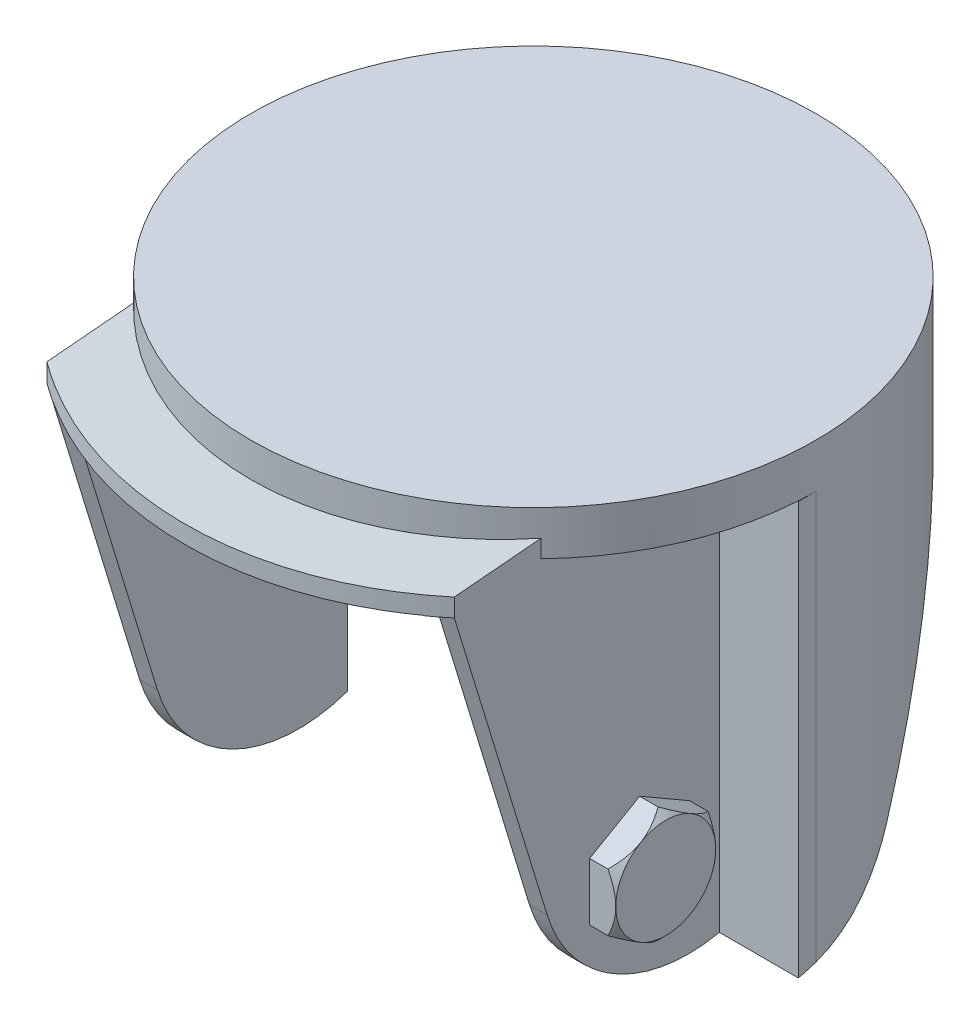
ISO-10303-21;
HEADER;
FILE_DESCRIPTION(('STEP AP214'),'2;1');
FILE_NAME('part.step','',(''),(''),'','','');
FILE_SCHEMA(('AUTOMOTIVE_DESIGN { 1 0 10303 214 1 1 1 1 }'));
ENDSEC;
DATA;
#1=APPLICATION_CONTEXT('core data for automotive mechanical design processes');
#2=APPLICATION_PROTOCOL_DEFINITION('international standard','automotive_design',2000,#1);
#3=PRODUCT_CONTEXT('',#1,'mechanical');
#4=PRODUCT('Part','Part','',(#3));
#5=PRODUCT_RELATED_PRODUCT_CATEGORY('part','',(#4));
#6=PRODUCT_DEFINITION_FORMATION('','',#4);
#7=PRODUCT_DEFINITION_CONTEXT('part definition',#1,'design');
#8=PRODUCT_DEFINITION('design','',#6,#7);
#9=PRODUCT_DEFINITION_SHAPE('','',#8);
#10=(LENGTH_UNIT() NAMED_UNIT(*) SI_UNIT(.MILLI.,.METRE.));
#11=(NAMED_UNIT(*) PLANE_ANGLE_UNIT() SI_UNIT($,.RADIAN.));
#12=(NAMED_UNIT(*) SI_UNIT($,.STERADIAN.) SOLID_ANGLE_UNIT());
#13=UNCERTAINTY_MEASURE_WITH_UNIT(LENGTH_MEASURE(1.E-05),#10,'distance_accuracy_value','');
#14=(GEOMETRIC_REPRESENTATION_CONTEXT(3) GLOBAL_UNCERTAINTY_ASSIGNED_CONTEXT((#13)) GLOBAL_UNIT_ASSIGNED_CONTEXT((#10,
#11,#12)) REPRESENTATION_CONTEXT('',''));
#15=CARTESIAN_POINT('',(0.,0.,0.));
#16=DIRECTION('',(0.,0.,1.));
#17=DIRECTION('',(1.,0.,0.));
#18=AXIS2_PLACEMENT_3D('',#15,#16,#17);
#19=CARTESIAN_POINT('',(-23.,-18.8507747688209,46.80175684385));
#20=DIRECTION('',(1.,0.,0.));
#21=DIRECTION('',(0.,0.,-1.));
#22=AXIS2_PLACEMENT_3D('',#19,#20,#21);
#23=PLANE('',#22);
#24=DIRECTION('',(0.,0.,-1.));
#25=VECTOR('',#24,1.);
#26=CARTESIAN_POINT('',(-23.,-16.2,0.));
#27=LINE('',#26,#25);
#28=CARTESIAN_POINT('',(-23.,-16.2,16.5032625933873));
#29=VERTEX_POINT('',#28);
#30=CARTESIAN_POINT('',(-23.,-16.2,0.));
#31=VERTEX_POINT('',#30);
#32=EDGE_CURVE('E708',#29,#31,#27,.T.);
#33=ORIENTED_EDGE('',*,*,#32,.T.);
#34=DIRECTION('',(0.,-1.,0.));
#35=VECTOR('',#34,1.);
#36=CARTESIAN_POINT('',(-23.,-18.8507747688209,0.));
#37=LINE('',#36,#35);
#38=CARTESIAN_POINT('',(-23.,-18.7,0.));
#39=VERTEX_POINT('',#38);
#40=EDGE_CURVE('E1390',#31,#39,#37,.T.);
#41=ORIENTED_EDGE('',*,*,#40,.T.);
#42=DIRECTION('',(0.,0.,1.));
#43=VECTOR('',#42,1.);
#44=CARTESIAN_POINT('',(-23.,-18.7,0.));
#45=LINE('',#44,#43);
#46=CARTESIAN_POINT('',(-23.,-18.7,2.));
#47=VERTEX_POINT('',#46);
#48=EDGE_CURVE('E705',#39,#47,#45,.T.);
#49=ORIENTED_EDGE('',*,*,#48,.T.);
#50=DIRECTION('',(0.,-1.,0.));
#51=VECTOR('',#50,1.);
#52=CARTESIAN_POINT('',(-23.,-18.7,2.));
#53=LINE('',#52,#51);
#54=CARTESIAN_POINT('',(-23.,-65.2950230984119,2.));
#55=VERTEX_POINT('',#54);
#56=EDGE_CURVE('E784',#47,#55,#53,.T.);
#57=ORIENTED_EDGE('',*,*,#56,.T.);
#58=CARTESIAN_POINT('',(-23.,-49.,5.5));
#59=DIRECTION('',(1.,0.,0.));
#60=DIRECTION('',(0.,0.,-1.));
#61=AXIS2_PLACEMENT_3D('',#58,#59,#60);
#62=CIRCLE('',#61,16.6666666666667);
#63=CARTESIAN_POINT('',(-23.,-53.8733172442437,21.4382733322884));
#64=VERTEX_POINT('',#63);
#65=EDGE_CURVE('E621',#55,#64,#62,.F.);
#66=ORIENTED_EDGE('',*,*,#65,.T.);
#67=DIRECTION('',(0.,0.956296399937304,0.292399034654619));
#68=VECTOR('',#67,1.);
#69=CARTESIAN_POINT('',(-23.,-14.7529630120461,33.3997884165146));
#70=LINE('',#69,#68);
#71=CARTESIAN_POINT('',(-23.,-19.5926381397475,31.92));
#72=VERTEX_POINT('',#71);
#73=EDGE_CURVE('E658',#64,#72,#70,.T.);
#74=ORIENTED_EDGE('',*,*,#73,.T.);
#75=DIRECTION('',(0.,1.,0.));
#76=VECTOR('',#75,1.);
#77=CARTESIAN_POINT('',(-23.,-35.,31.92));
#78=LINE('',#77,#76);
#79=CARTESIAN_POINT('',(-23.,-17.5487897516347,31.92));
#80=VERTEX_POINT('',#79);
#81=EDGE_CURVE('E1503',#72,#80,#78,.T.);
#82=ORIENTED_EDGE('',*,*,#81,.T.);
#83=DIRECTION('',(0.,0.0871557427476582,-0.996194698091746));
#84=VECTOR('',#83,1.);
#85=CARTESIAN_POINT('',(-23.,-18.8507747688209,46.80175684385));
#86=LINE('',#85,#84);
#87=CARTESIAN_POINT('',(-23.,-16.6925712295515,22.1333775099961));
#88=VERTEX_POINT('',#87);
#89=EDGE_CURVE('E678',#80,#88,#86,.T.);
#90=ORIENTED_EDGE('',*,*,#89,.T.);
#91=DIRECTION('',(0.,1.,0.));
#92=VECTOR('',#91,1.);
#93=CARTESIAN_POINT('',(-23.,-79.3,22.1333775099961));
#94=LINE('',#93,#92);
#95=CARTESIAN_POINT('',(-23.,-18.7,22.1333775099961));
#96=VERTEX_POINT('',#95);
#97=EDGE_CURVE('E715',#88,#96,#94,.F.);
#98=ORIENTED_EDGE('',*,*,#97,.T.);
#99=DIRECTION('',(0.,0.,1.));
#100=VECTOR('',#99,1.);
#101=CARTESIAN_POINT('',(-23.,-18.7,84.));
#102=LINE('',#101,#100);
#103=CARTESIAN_POINT('',(-23.,-18.7,19.1365200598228));
#104=VERTEX_POINT('',#103);
#105=EDGE_CURVE('E713',#104,#96,#102,.T.);
#106=ORIENTED_EDGE('',*,*,#105,.F.);
#107=DIRECTION('',(0.,1.,0.));
#108=VECTOR('',#107,1.);
#109=CARTESIAN_POINT('',(-23.,-79.3,19.1365200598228));
#110=LINE('',#109,#108);
#111=CARTESIAN_POINT('',(-23.,-16.4303801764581,19.1365200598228));
#112=VERTEX_POINT('',#111);
#113=EDGE_CURVE('E710',#104,#112,#110,.T.);
#114=ORIENTED_EDGE('',*,*,#113,.T.);
#115=EDGE_CURVE('E677',#112,#29,#86,.T.);
#116=ORIENTED_EDGE('',*,*,#115,.T.);
#117=EDGE_LOOP('',(#33,#41,#49,#57,#66,#74,#82,#90,#98,#106,#114,#116));
#118=FACE_BOUND('',#117,.T.);
#119=DIRECTION('',(0.,-0.5,0.866025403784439));
#120=VECTOR('',#119,1.);
#121=CARTESIAN_POINT('',(-23.,-47.4841898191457,11.));
#122=LINE('',#121,#120);
#123=CARTESIAN_POINT('',(-23.,-47.4841898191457,11.));
#124=VERTEX_POINT('',#123);
#125=CARTESIAN_POINT('',(-23.,-50.7420949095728,16.6428571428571));
#126=VERTEX_POINT('',#125);
#127=EDGE_CURVE('E395',#124,#126,#122,.T.);
#128=ORIENTED_EDGE('',*,*,#127,.T.);
#129=DIRECTION('',(0.,-1.,0.));
#130=VECTOR('',#129,1.);
#131=CARTESIAN_POINT('',(-23.,-50.7420949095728,16.6428571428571));
#132=LINE('',#131,#130);
#133=CARTESIAN_POINT('',(-23.,-57.2579050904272,16.6428571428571));
#134=VERTEX_POINT('',#133);
#135=EDGE_CURVE('E379',#126,#134,#132,.T.);
#136=ORIENTED_EDGE('',*,*,#135,.T.);
#137=DIRECTION('',(0.,-0.5,-0.866025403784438));
#138=VECTOR('',#137,1.);
#139=CARTESIAN_POINT('',(-23.,-57.2579050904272,16.6428571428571));
#140=LINE('',#139,#138);
#141=CARTESIAN_POINT('',(-23.,-60.5158101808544,11.));
#142=VERTEX_POINT('',#141);
#143=EDGE_CURVE('E391',#134,#142,#140,.T.);
#144=ORIENTED_EDGE('',*,*,#143,.T.);
#145=DIRECTION('',(0.,0.500000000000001,-0.866025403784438));
#146=VECTOR('',#145,1.);
#147=CARTESIAN_POINT('',(-23.,-60.5158101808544,11.));
#148=LINE('',#147,#146);
#149=CARTESIAN_POINT('',(-23.,-57.2579050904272,5.35714285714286));
#150=VERTEX_POINT('',#149);
#151=EDGE_CURVE('E399',#142,#150,#148,.T.);
#152=ORIENTED_EDGE('',*,*,#151,.T.);
#153=DIRECTION('',(0.,1.,0.));
#154=VECTOR('',#153,1.);
#155=CARTESIAN_POINT('',(-23.,-57.2579050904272,5.35714285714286));
#156=LINE('',#155,#154);
#157=CARTESIAN_POINT('',(-23.,-50.7420949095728,5.35714285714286));
#158=VERTEX_POINT('',#157);
#159=EDGE_CURVE('E401',#150,#158,#156,.T.);
#160=ORIENTED_EDGE('',*,*,#159,.T.);
#161=DIRECTION('',(0.,0.5,0.866025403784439));
#162=VECTOR('',#161,1.);
#163=CARTESIAN_POINT('',(-23.,-50.7420949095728,5.35714285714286));
#164=LINE('',#163,#162);
#165=EDGE_CURVE('E407',#158,#124,#164,.T.);
#166=ORIENTED_EDGE('',*,*,#165,.T.);
#167=EDGE_LOOP('',(#128,#136,#144,#152,#160,#166));
#168=FACE_BOUND('',#167,.T.);
#169=ADVANCED_FACE('F31',(#118,#168),#23,.F.);
#170=CARTESIAN_POINT('',(23.,-72.9441468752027,42.0692000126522));
#171=DIRECTION('',(-1.,0.,0.));
#172=DIRECTION('',(0.,0.,1.));
#173=AXIS2_PLACEMENT_3D('',#170,#171,#172);
#174=PLANE('',#173);
#175=DIRECTION('',(0.,-0.5,0.866025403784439));
#176=VECTOR('',#175,1.);
#177=CARTESIAN_POINT('',(23.,-47.4841898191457,11.));
#178=LINE('',#177,#176);
#179=CARTESIAN_POINT('',(23.,-47.4841898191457,11.));
#180=VERTEX_POINT('',#179);
#181=CARTESIAN_POINT('',(23.,-50.7420949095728,16.6428571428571));
#182=VERTEX_POINT('',#181);
#183=EDGE_CURVE('E421',#180,#182,#178,.T.);
#184=ORIENTED_EDGE('',*,*,#183,.F.);
#185=DIRECTION('',(0.,0.5,0.866025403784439));
#186=VECTOR('',#185,1.);
#187=CARTESIAN_POINT('',(23.,-50.7420949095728,5.35714285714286));
#188=LINE('',#187,#186);
#189=CARTESIAN_POINT('',(23.,-50.7420949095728,5.35714285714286));
#190=VERTEX_POINT('',#189);
#191=EDGE_CURVE('E437',#190,#180,#188,.T.);
#192=ORIENTED_EDGE('',*,*,#191,.F.);
#193=DIRECTION('',(0.,1.,0.));
#194=VECTOR('',#193,1.);
#195=CARTESIAN_POINT('',(23.,-57.2579050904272,5.35714285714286));
#196=LINE('',#195,#194);
#197=CARTESIAN_POINT('',(23.,-57.2579050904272,5.35714285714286));
#198=VERTEX_POINT('',#197);
#199=EDGE_CURVE('E434',#198,#190,#196,.T.);
#200=ORIENTED_EDGE('',*,*,#199,.F.);
#201=DIRECTION('',(0.,0.500000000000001,-0.866025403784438));
#202=VECTOR('',#201,1.);
#203=CARTESIAN_POINT('',(23.,-60.5158101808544,11.));
#204=LINE('',#203,#202);
#205=CARTESIAN_POINT('',(23.,-60.5158101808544,11.));
#206=VERTEX_POINT('',#205);
#207=EDGE_CURVE('E431',#206,#198,#204,.T.);
#208=ORIENTED_EDGE('',*,*,#207,.F.);
#209=DIRECTION('',(0.,-0.5,-0.866025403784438));
#210=VECTOR('',#209,1.);
#211=CARTESIAN_POINT('',(23.,-57.2579050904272,16.6428571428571));
#212=LINE('',#211,#210);
#213=CARTESIAN_POINT('',(23.,-57.2579050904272,16.6428571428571));
#214=VERTEX_POINT('',#213);
#215=EDGE_CURVE('E428',#214,#206,#212,.T.);
#216=ORIENTED_EDGE('',*,*,#215,.F.);
#217=DIRECTION('',(0.,-1.,0.));
#218=VECTOR('',#217,1.);
#219=CARTESIAN_POINT('',(23.,-50.7420949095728,16.6428571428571));
#220=LINE('',#219,#218);
#221=EDGE_CURVE('E425',#182,#214,#220,.T.);
#222=ORIENTED_EDGE('',*,*,#221,.F.);
#223=EDGE_LOOP('',(#184,#192,#200,#208,#216,#222));
#224=FACE_BOUND('',#223,.T.);
#225=DIRECTION('',(0.,0.,-1.));
#226=VECTOR('',#225,1.);
#227=CARTESIAN_POINT('',(23.,-18.7,0.));
#228=LINE('',#227,#226);
#229=CARTESIAN_POINT('',(23.,-18.7,2.));
#230=VERTEX_POINT('',#229);
#231=CARTESIAN_POINT('',(23.,-18.7,0.));
#232=VERTEX_POINT('',#231);
#233=EDGE_CURVE('E680',#230,#232,#228,.T.);
#234=ORIENTED_EDGE('',*,*,#233,.T.);
#235=DIRECTION('',(0.,1.,0.));
#236=VECTOR('',#235,1.);
#237=CARTESIAN_POINT('',(23.,-72.9441468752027,0.));
#238=LINE('',#237,#236);
#239=CARTESIAN_POINT('',(23.,-16.2,0.));
#240=VERTEX_POINT('',#239);
#241=EDGE_CURVE('E1383',#232,#240,#238,.T.);
#242=ORIENTED_EDGE('',*,*,#241,.T.);
#243=DIRECTION('',(0.,0.,1.));
#244=VECTOR('',#243,1.);
#245=CARTESIAN_POINT('',(23.,-16.2,0.));
#246=LINE('',#245,#244);
#247=CARTESIAN_POINT('',(23.,-16.2,16.5032625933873));
#248=VERTEX_POINT('',#247);
#249=EDGE_CURVE('E683',#240,#248,#246,.T.);
#250=ORIENTED_EDGE('',*,*,#249,.T.);
#251=DIRECTION('',(0.,0.0871557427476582,-0.996194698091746));
#252=VECTOR('',#251,1.);
#253=CARTESIAN_POINT('',(23.,-18.8507747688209,46.80175684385));
#254=LINE('',#253,#252);
#255=CARTESIAN_POINT('',(23.,-16.4303801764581,19.1365200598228));
#256=VERTEX_POINT('',#255);
#257=EDGE_CURVE('E671',#256,#248,#254,.T.);
#258=ORIENTED_EDGE('',*,*,#257,.F.);
#259=DIRECTION('',(0.,1.,0.));
#260=VECTOR('',#259,1.);
#261=CARTESIAN_POINT('',(23.,-79.3,19.1365200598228));
#262=LINE('',#261,#260);
#263=CARTESIAN_POINT('',(23.,-18.7,19.1365200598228));
#264=VERTEX_POINT('',#263);
#265=EDGE_CURVE('E685',#256,#264,#262,.F.);
#266=ORIENTED_EDGE('',*,*,#265,.T.);
#267=DIRECTION('',(0.,0.,-1.));
#268=VECTOR('',#267,1.);
#269=CARTESIAN_POINT('',(23.,-18.7,84.));
#270=LINE('',#269,#268);
#271=CARTESIAN_POINT('',(23.,-18.7,22.1333775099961));
#272=VERTEX_POINT('',#271);
#273=EDGE_CURVE('E688',#272,#264,#270,.T.);
#274=ORIENTED_EDGE('',*,*,#273,.F.);
#275=DIRECTION('',(0.,1.,0.));
#276=VECTOR('',#275,1.);
#277=CARTESIAN_POINT('',(23.,-79.3,22.1333775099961));
#278=LINE('',#277,#276);
#279=CARTESIAN_POINT('',(23.,-16.6925712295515,22.1333775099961));
#280=VERTEX_POINT('',#279);
#281=EDGE_CURVE('E691',#272,#280,#278,.T.);
#282=ORIENTED_EDGE('',*,*,#281,.T.);
#283=CARTESIAN_POINT('',(23.,-17.5487897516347,31.92));
#284=VERTEX_POINT('',#283);
#285=EDGE_CURVE('E668',#284,#280,#254,.T.);
#286=ORIENTED_EDGE('',*,*,#285,.F.);
#287=DIRECTION('',(0.,1.,0.));
#288=VECTOR('',#287,1.);
#289=CARTESIAN_POINT('',(23.,-35.,31.92));
#290=LINE('',#289,#288);
#291=CARTESIAN_POINT('',(23.,-19.5926381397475,31.92));
#292=VERTEX_POINT('',#291);
#293=EDGE_CURVE('E1488',#292,#284,#290,.T.);
#294=ORIENTED_EDGE('',*,*,#293,.F.);
#295=DIRECTION('',(0.,-0.956296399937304,-0.292399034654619));
#296=VECTOR('',#295,1.);
#297=CARTESIAN_POINT('',(23.,-65.5448217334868,17.8695715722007));
#298=LINE('',#297,#296);
#299=CARTESIAN_POINT('',(23.,-53.8733172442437,21.4382733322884));
#300=VERTEX_POINT('',#299);
#301=EDGE_CURVE('E797',#292,#300,#298,.T.);
#302=ORIENTED_EDGE('',*,*,#301,.T.);
#303=CARTESIAN_POINT('',(23.,-49.,5.5));
#304=DIRECTION('',(-1.,0.,0.));
#305=DIRECTION('',(0.,0.,1.));
#306=AXIS2_PLACEMENT_3D('',#303,#304,#305);
#307=CIRCLE('',#306,16.6666666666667);
#308=CARTESIAN_POINT('',(23.,-65.2950230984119,2.));
#309=VERTEX_POINT('',#308);
#310=EDGE_CURVE('E794',#300,#309,#307,.F.);
#311=ORIENTED_EDGE('',*,*,#310,.T.);
#312=DIRECTION('',(0.,1.,0.));
#313=VECTOR('',#312,1.);
#314=CARTESIAN_POINT('',(23.,-18.7,2.));
#315=LINE('',#314,#313);
#316=EDGE_CURVE('E782',#309,#230,#315,.T.);
#317=ORIENTED_EDGE('',*,*,#316,.T.);
#318=EDGE_LOOP('',(#234,#242,#250,#258,#266,#274,#282,#286,#294,#302,#311,#317));
#319=FACE_BOUND('',#318,.T.);
#320=ADVANCED_FACE('F539',(#224,#319),#174,.F.);
#321=CARTESIAN_POINT('',(-50.,-49.,5.5));
#322=DIRECTION('',(1.,0.,0.));
#323=DIRECTION('',(0.,0.,-1.));
#324=AXIS2_PLACEMENT_3D('',#321,#322,#323);
#325=CYLINDRICAL_SURFACE('',#324,16.6666666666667);
#326=CARTESIAN_POINT('',(21.,-49.,5.5));
#327=DIRECTION('',(1.,0.,0.));
#328=DIRECTION('',(0.,0.,-1.));
#329=AXIS2_PLACEMENT_3D('',#326,#327,#328);
#330=CIRCLE('',#329,16.6666666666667);
#331=CARTESIAN_POINT('',(21.,-64.7330155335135,0.));
#332=VERTEX_POINT('',#331);
#333=CARTESIAN_POINT('',(21.,-53.8733172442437,21.4382733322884));
#334=VERTEX_POINT('',#333);
#335=EDGE_CURVE('E619',#332,#334,#330,.F.);
#336=ORIENTED_EDGE('',*,*,#335,.F.);
#337=DIRECTION('',(1.,0.,0.));
#338=VECTOR('',#337,1.);
#339=CARTESIAN_POINT('',(-50.,-64.7330155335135,0.));
#340=LINE('',#339,#338);
#341=CARTESIAN_POINT('',(29.92,-64.7330155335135,0.));
#342=VERTEX_POINT('',#341);
#343=EDGE_CURVE('E1452',#342,#332,#340,.F.);
#344=ORIENTED_EDGE('',*,*,#343,.F.);
#345=CARTESIAN_POINT('',(28.4060965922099,-56.4741400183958,-9.39681203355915));
#346=CARTESIAN_POINT('',(28.4756936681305,-56.8936106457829,-9.18636870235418));
#347=CARTESIAN_POINT('',(28.5485220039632,-57.30368847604,-8.9584281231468));
#348=CARTESIAN_POINT('',(28.6974875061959,-58.1027673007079,-8.46913611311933));
#349=CARTESIAN_POINT('',(28.7736246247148,-58.4917685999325,-8.20778516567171));
#350=CARTESIAN_POINT('',(28.9262570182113,-59.2474095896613,-7.65251931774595));
#351=CARTESIAN_POINT('',(29.0027527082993,-59.613987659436,-7.35852042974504));
#352=CARTESIAN_POINT('',(29.1151404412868,-60.1444260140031,-6.8949472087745));
#353=CARTESIAN_POINT('',(29.152211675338,-60.3180065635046,-6.73665422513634));
#354=CARTESIAN_POINT('',(29.2251824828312,-60.6585014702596,-6.41269751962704));
#355=CARTESIAN_POINT('',(29.261081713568,-60.8254138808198,-6.2470316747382));
#356=CARTESIAN_POINT('',(29.3664711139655,-61.3159980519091,-5.73902520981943));
#357=CARTESIAN_POINT('',(29.4335851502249,-61.6292023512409,-5.38595033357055));
#358=CARTESIAN_POINT('',(29.5582313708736,-62.2252235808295,-4.65353090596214));
#359=CARTESIAN_POINT('',(29.6157642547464,-62.5080427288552,-4.27418827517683));
#360=CARTESIAN_POINT('',(29.7181222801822,-63.0407661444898,-3.49211773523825));
#361=CARTESIAN_POINT('',(29.7629638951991,-63.2907128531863,-3.08942096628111));
#362=CARTESIAN_POINT('',(29.8371717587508,-63.755910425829,-2.26309526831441));
#363=CARTESIAN_POINT('',(29.866539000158,-63.9711635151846,-1.83946768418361));
#364=CARTESIAN_POINT('',(29.9063258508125,-64.3559960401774,-0.994366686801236));
#365=CARTESIAN_POINT('',(29.9175484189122,-64.5272106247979,-0.573675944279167));
#366=CARTESIAN_POINT('',(29.9217327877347,-64.8347487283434,0.280376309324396));
#367=CARTESIAN_POINT('',(29.9146951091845,-64.971073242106,0.713737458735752));
#368=CARTESIAN_POINT('',(29.8809689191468,-65.2077185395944,1.58933948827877));
#369=CARTESIAN_POINT('',(29.8542847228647,-65.3080472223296,2.03157839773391));
#370=CARTESIAN_POINT('',(29.7804092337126,-65.4721424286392,2.92108520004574));
#371=CARTESIAN_POINT('',(29.7332191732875,-65.5359111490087,3.36835278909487));
#372=CARTESIAN_POINT('',(29.6227500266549,-65.6231558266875,4.22742613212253));
#373=CARTESIAN_POINT('',(29.5610934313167,-65.6494892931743,4.63915464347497));
#374=CARTESIAN_POINT('',(29.4204616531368,-65.6716808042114,5.46043741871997));
#375=CARTESIAN_POINT('',(29.3414875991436,-65.6675408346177,5.86999182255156));
#376=CARTESIAN_POINT('',(29.166802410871,-65.629544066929,6.68411507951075));
#377=CARTESIAN_POINT('',(29.0710906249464,-65.5956861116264,7.08868373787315));
#378=CARTESIAN_POINT('',(28.8638423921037,-65.4993137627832,7.89027271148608));
#379=CARTESIAN_POINT('',(28.7523053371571,-65.4367982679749,8.28729273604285));
#380=CARTESIAN_POINT('',(28.5120900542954,-65.2827945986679,9.07976500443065));
#381=CARTESIAN_POINT('',(28.3831016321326,-65.1907267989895,9.47501009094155));
#382=CARTESIAN_POINT('',(28.1113145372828,-64.9795633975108,10.253308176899));
#383=CARTESIAN_POINT('',(27.9685158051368,-64.8604676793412,10.636361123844));
#384=CARTESIAN_POINT('',(27.6707203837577,-64.5968097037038,11.3886473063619));
#385=CARTESIAN_POINT('',(27.5157245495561,-64.4522492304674,11.7578815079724));
#386=CARTESIAN_POINT('',(27.1952065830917,-64.139159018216,12.4813349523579));
#387=CARTESIAN_POINT('',(27.029683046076,-63.9706260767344,12.8355521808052));
#388=CARTESIAN_POINT('',(26.6670291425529,-63.5868407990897,13.5745098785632));
#389=CARTESIAN_POINT('',(26.4686406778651,-63.3683536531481,13.9569545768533));
#390=CARTESIAN_POINT('',(26.0632169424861,-62.9042096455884,14.7001481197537));
#391=CARTESIAN_POINT('',(25.8561809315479,-62.6585504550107,15.0608951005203));
#392=CARTESIAN_POINT('',(25.4357547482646,-62.1410855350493,15.7605736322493));
#393=CARTESIAN_POINT('',(25.2223524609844,-61.8692274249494,16.099459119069));
#394=CARTESIAN_POINT('',(24.7924534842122,-61.3010080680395,16.7539240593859));
#395=CARTESIAN_POINT('',(24.5759566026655,-61.0046452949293,17.069502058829));
#396=CARTESIAN_POINT('',(24.1067070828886,-60.3367671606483,17.7274477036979));
#397=CARTESIAN_POINT('',(23.8539428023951,-59.9609700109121,18.0654767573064));
#398=CARTESIAN_POINT('',(23.3536628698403,-59.1779453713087,18.7077141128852));
#399=CARTESIAN_POINT('',(23.1061492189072,-58.7707061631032,19.0119097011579));
#400=CARTESIAN_POINT('',(22.6236386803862,-57.9268836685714,19.5835835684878));
#401=CARTESIAN_POINT('',(22.388599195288,-57.4904135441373,19.8511924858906));
#402=CARTESIAN_POINT('',(21.9376649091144,-56.5873481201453,20.3484083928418));
#403=CARTESIAN_POINT('',(21.7217521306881,-56.1207818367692,20.5780512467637));
#404=CARTESIAN_POINT('',(21.4005932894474,-55.3552445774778,20.9105370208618));
#405=CARTESIAN_POINT('',(21.2862327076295,-55.0658723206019,21.0267983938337));
#406=CARTESIAN_POINT('',(21.0693188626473,-54.4770504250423,21.2441473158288));
#407=CARTESIAN_POINT('',(20.966770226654,-54.177596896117,21.3452289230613));
#408=CARTESIAN_POINT('',(20.8711963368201,-53.8733172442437,21.4382733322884));
#409=B_SPLINE_CURVE_WITH_KNOTS('',3,(#345,#346,#347,#348,#349,#350,#351,#352,#353,#354,#355,
#356,#357,#358,#359,#360,#361,#362,#363,#364,#365,#366,#367,#368,#369,#370,#371,#372,#373,#374,
#375,#376,#377,#378,#379,#380,#381,#382,#383,#384,#385,#386,#387,#388,#389,#390,#391,#392,#393,
#394,#395,#396,#397,#398,#399,#400,#401,#402,#403,#404,#405,#406,#407,#408),.UNSPECIFIED.,.F.,
.F.,(4,2,2,2,2,2,2,2,2,2,2,2,2,2,2,2,2,2,2,2,2,2,2,2,2,2,2,2,2,2,2,4),(0.,1.42275991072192,
2.84549923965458,4.27198730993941,4.98528262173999,5.69878467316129,7.12705356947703,
8.55521814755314,9.98152035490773,11.4077310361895,12.7689054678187,14.1300410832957,
15.4908778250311,16.8516327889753,18.1016128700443,19.3515114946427,20.601458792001,
21.8514541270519,23.1276409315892,24.4038332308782,25.6799361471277,26.9562096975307,
28.4040093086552,29.851933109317,31.3028143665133,32.7537860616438,34.4472786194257,
36.1414054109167,37.8293155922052,39.515622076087,40.5114616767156,41.5076900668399),.UNSPECIFIED.);
#410=CARTESIAN_POINT('',(28.4060965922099,-56.4741400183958,-9.39681203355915));
#411=VERTEX_POINT('',#410);
#412=EDGE_CURVE('E604',#411,#342,#409,.T.);
#413=ORIENTED_EDGE('',*,*,#412,.F.);
#414=DIRECTION('',(1.,0.,0.));
#415=VECTOR('',#414,1.);
#416=CARTESIAN_POINT('',(-50.,-56.4741400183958,-9.39681203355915));
#417=LINE('',#416,#415);
#418=CARTESIAN_POINT('',(30.5055130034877,-56.4741400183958,-9.39681203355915));
#419=VERTEX_POINT('',#418);
#420=EDGE_CURVE('E1462',#411,#419,#417,.T.);
#421=ORIENTED_EDGE('',*,*,#420,.T.);
#422=CARTESIAN_POINT('',(23.6492460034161,-53.8733172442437,21.4382733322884));
#423=CARTESIAN_POINT('',(23.7783365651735,-54.3389824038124,21.2958778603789));
#424=CARTESIAN_POINT('',(23.9223748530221,-54.7941610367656,21.1344036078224));
#425=CARTESIAN_POINT('',(24.2339728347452,-55.681256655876,20.7763560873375));
#426=CARTESIAN_POINT('',(24.4014946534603,-56.1132095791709,20.5798392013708));
#427=CARTESIAN_POINT('',(24.7533013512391,-56.951071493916,20.1553008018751));
#428=CARTESIAN_POINT('',(24.9375030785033,-57.3570941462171,19.9274329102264));
#429=CARTESIAN_POINT('',(25.3181840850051,-58.1447841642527,19.4414825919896));
#430=CARTESIAN_POINT('',(25.5146688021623,-58.5264405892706,19.1833867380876));
#431=CARTESIAN_POINT('',(25.913981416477,-59.2623211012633,18.6404092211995));
#432=CARTESIAN_POINT('',(26.1167629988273,-59.6166991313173,18.3557016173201));
#433=CARTESIAN_POINT('',(26.5257732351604,-60.2998911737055,17.7595164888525));
#434=CARTESIAN_POINT('',(26.7320013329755,-60.6287092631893,17.448043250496));
#435=CARTESIAN_POINT('',(27.144801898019,-61.2606730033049,16.7986452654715));
#436=CARTESIAN_POINT('',(27.3513741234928,-61.5637605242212,16.4606637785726));
#437=CARTESIAN_POINT('',(27.7611106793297,-62.1423117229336,15.7598206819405));
#438=CARTESIAN_POINT('',(27.9642745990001,-62.4177720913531,15.3969561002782));
#439=CARTESIAN_POINT('',(28.389853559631,-62.9732126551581,14.5990572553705));
#440=CARTESIAN_POINT('',(28.6113742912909,-63.2491982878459,14.1607494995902));
#441=CARTESIAN_POINT('',(29.0418357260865,-63.7614294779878,13.2555408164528));
#442=CARTESIAN_POINT('',(29.2507752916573,-63.9976714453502,12.7886373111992));
#443=CARTESIAN_POINT('',(29.6517790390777,-64.4271112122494,11.8291345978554));
#444=CARTESIAN_POINT('',(29.8438611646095,-64.6203551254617,11.3365636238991));
#445=CARTESIAN_POINT('',(30.207550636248,-64.9607822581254,10.3284667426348));
#446=CARTESIAN_POINT('',(30.3791615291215,-65.1079734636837,9.81294483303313));
#447=CARTESIAN_POINT('',(30.6830941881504,-65.3412045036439,8.81363023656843));
#448=CARTESIAN_POINT('',(30.8176077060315,-65.4317665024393,8.33155930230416));
#449=CARTESIAN_POINT('',(31.0649532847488,-65.5703466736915,7.35583197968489));
#450=CARTESIAN_POINT('',(31.1777864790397,-65.6183670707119,6.8621761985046));
#451=CARTESIAN_POINT('',(31.3800490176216,-65.670022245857,5.86821335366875));
#452=CARTESIAN_POINT('',(31.4694985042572,-65.6736953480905,5.36791240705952));
#453=CARTESIAN_POINT('',(31.6241606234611,-65.635558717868,4.36531819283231));
#454=CARTESIAN_POINT('',(31.6893767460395,-65.5937555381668,3.86302522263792));
#455=CARTESIAN_POINT('',(31.7877675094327,-65.4736532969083,2.93425286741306));
#456=CARTESIAN_POINT('',(31.824211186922,-65.401503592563,2.50731048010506));
#457=CARTESIAN_POINT('',(31.8796737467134,-65.2238837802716,1.6593001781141));
#458=CARTESIAN_POINT('',(31.898694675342,-65.1184175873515,1.23823157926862));
#459=CARTESIAN_POINT('',(31.9201450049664,-64.8748350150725,0.405332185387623));
#460=CARTESIAN_POINT('',(31.9225779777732,-64.736725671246,-0.0065005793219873));
#461=CARTESIAN_POINT('',(31.9120981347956,-64.4288544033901,-0.817954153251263));
#462=CARTESIAN_POINT('',(31.8991850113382,-64.2590918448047,-1.21757471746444));
#463=CARTESIAN_POINT('',(31.860139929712,-63.8943654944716,-1.99088280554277));
#464=CARTESIAN_POINT('',(31.8343851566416,-63.7002328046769,-2.36498235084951));
#465=CARTESIAN_POINT('',(31.7715540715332,-63.2846556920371,-3.09671105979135));
#466=CARTESIAN_POINT('',(31.7344770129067,-63.063209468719,-3.45433913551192));
#467=CARTESIAN_POINT('',(31.6508468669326,-62.5943375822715,-4.1513374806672));
#468=CARTESIAN_POINT('',(31.6042868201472,-62.346892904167,-4.49069410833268));
#469=CARTESIAN_POINT('',(31.5037159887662,-61.8277153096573,-5.14909745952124));
#470=CARTESIAN_POINT('',(31.4497050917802,-61.555982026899,-5.46814387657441));
#471=CARTESIAN_POINT('',(31.3322201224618,-60.9693204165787,-6.10665546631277));
#472=CARTESIAN_POINT('',(31.2683442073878,-60.6526895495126,-6.42448355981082));
#473=CARTESIAN_POINT('',(31.1370601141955,-59.9952559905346,-7.03326927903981));
#474=CARTESIAN_POINT('',(31.0696518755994,-59.6544528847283,-7.32422644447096));
#475=CARTESIAN_POINT('',(30.934077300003,-58.9512915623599,-7.87719350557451));
#476=CARTESIAN_POINT('',(30.8659125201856,-58.5889726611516,-8.1392538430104));
#477=CARTESIAN_POINT('',(30.7313456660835,-57.8443770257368,-8.63344373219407));
#478=CARTESIAN_POINT('',(30.6649425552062,-57.4621124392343,-8.86559120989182));
#479=CARTESIAN_POINT('',(30.5845265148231,-56.9725869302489,-9.1365399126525));
#480=CARTESIAN_POINT('',(30.5684971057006,-56.8736192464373,-9.19001579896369));
#481=CARTESIAN_POINT('',(30.5367590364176,-56.674660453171,-9.29493136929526));
#482=CARTESIAN_POINT('',(30.5210501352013,-56.5746702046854,-9.34637261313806));
#483=CARTESIAN_POINT('',(30.5055130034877,-56.4741400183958,-9.39681203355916));
#484=B_SPLINE_CURVE_WITH_KNOTS('',3,(#422,#423,#424,#425,#426,#427,#428,#429,#430,#431,#432,
#433,#434,#435,#436,#437,#438,#439,#440,#441,#442,#443,#444,#445,#446,#447,#448,#449,#450,#451,
#452,#453,#454,#455,#456,#457,#458,#459,#460,#461,#462,#463,#464,#465,#466,#467,#468,#469,#470,
#471,#472,#473,#474,#475,#476,#477,#478,#479,#480,#481,#482,#483),.UNSPECIFIED.,.F.,.F.,(4,2,2,
2,2,2,2,2,2,2,2,2,2,2,2,2,2,2,2,2,2,2,2,2,2,2,2,2,2,2,4),(0.,1.50994710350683,3.01748634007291,
4.51788550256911,6.01895369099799,7.51081212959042,9.0024321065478,10.4973368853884,
11.9924205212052,13.6802280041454,15.3681878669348,17.0543286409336,18.7401768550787,
20.2637655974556,21.7872746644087,23.3094670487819,24.8314401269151,26.1333990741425,
27.4352050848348,28.7367307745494,30.0382825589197,31.3036771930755,32.5691552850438,
33.8355654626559,35.1019947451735,36.4599759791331,37.8179804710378,39.1735756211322,
40.5283545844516,40.8692233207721,41.2098254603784),.UNSPECIFIED.);
#485=CARTESIAN_POINT('',(31.92,-64.7330155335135,0.));
#486=VERTEX_POINT('',#485);
#487=EDGE_CURVE('E640',#486,#419,#484,.T.);
#488=ORIENTED_EDGE('',*,*,#487,.F.);
#489=CARTESIAN_POINT('',(31.92,-49.,5.5));
#490=DIRECTION('',(1.,0.,0.));
#491=DIRECTION('',(0.,0.,-1.));
#492=AXIS2_PLACEMENT_3D('',#489,#490,#491);
#493=CIRCLE('',#492,16.6666666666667);
#494=CARTESIAN_POINT('',(31.92,-65.2950230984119,2.));
#495=VERTEX_POINT('',#494);
#496=EDGE_CURVE('E1477',#486,#495,#493,.F.);
#497=ORIENTED_EDGE('',*,*,#496,.T.);
#498=DIRECTION('',(1.,0.,0.));
#499=VECTOR('',#498,1.);
#500=CARTESIAN_POINT('',(-50.,-65.2950230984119,2.));
#501=LINE('',#500,#499);
#502=EDGE_CURVE('E1442',#309,#495,#501,.T.);
#503=ORIENTED_EDGE('',*,*,#502,.F.);
#504=ORIENTED_EDGE('',*,*,#310,.F.);
#505=DIRECTION('',(1.,0.,0.));
#506=VECTOR('',#505,1.);
#507=CARTESIAN_POINT('',(-50.,-53.8733172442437,21.4382733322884));
#508=LINE('',#507,#506);
#509=EDGE_CURVE('E1454',#334,#300,#508,.T.);
#510=ORIENTED_EDGE('',*,*,#509,.F.);
#511=EDGE_LOOP('',(#336,#344,#413,#421,#488,#497,#503,#504,#510));
#512=FACE_BOUND('',#511,.T.);
#513=ADVANCED_FACE('F545',(#512),#325,.T.);
#514=CARTESIAN_POINT('',(31.92,-72.7,0.));
#515=DIRECTION('',(0.,0.,1.));
#516=DIRECTION('',(1.,0.,0.));
#517=AXIS2_PLACEMENT_3D('',#514,#515,#516);
#518=PLANE('',#517);
#519=DIRECTION('',(0.,1.,0.));
#520=VECTOR('',#519,1.);
#521=CARTESIAN_POINT('',(29.92,-79.3,0.));
#522=LINE('',#521,#520);
#523=CARTESIAN_POINT('',(29.92,-18.7,0.));
#524=VERTEX_POINT('',#523);
#525=EDGE_CURVE('E778',#524,#342,#522,.F.);
#526=ORIENTED_EDGE('',*,*,#525,.T.);
#527=ORIENTED_EDGE('',*,*,#343,.T.);
#528=DIRECTION('',(0.,1.,0.));
#529=VECTOR('',#528,1.);
#530=CARTESIAN_POINT('',(21.,-95.2,0.));
#531=LINE('',#530,#529);
#532=CARTESIAN_POINT('',(21.,-16.2,0.));
#533=VERTEX_POINT('',#532);
#534=EDGE_CURVE('E1450',#332,#533,#531,.T.);
#535=ORIENTED_EDGE('',*,*,#534,.T.);
#536=DIRECTION('',(1.,0.,0.));
#537=VECTOR('',#536,1.);
#538=CARTESIAN_POINT('',(21.,-16.2,0.));
#539=LINE('',#538,#537);
#540=EDGE_CURVE('E1522',#533,#240,#539,.T.);
#541=ORIENTED_EDGE('',*,*,#540,.T.);
#542=ORIENTED_EDGE('',*,*,#241,.F.);
#543=DIRECTION('',(-1.,0.,0.));
#544=VECTOR('',#543,1.);
#545=CARTESIAN_POINT('',(31.92,-18.7,0.));
#546=LINE('',#545,#544);
#547=EDGE_CURVE('E743',#524,#232,#546,.T.);
#548=ORIENTED_EDGE('',*,*,#547,.F.);
#549=EDGE_LOOP('',(#526,#527,#535,#541,#542,#548));
#550=FACE_BOUND('',#549,.T.);
#551=ADVANCED_FACE('F573',(#550),#518,.F.);
#552=CARTESIAN_POINT('',(31.92,-18.7,2.));
#553=DIRECTION('',(0.,0.,-1.));
#554=DIRECTION('',(-1.,0.,0.));
#555=AXIS2_PLACEMENT_3D('',#552,#553,#554);
#556=PLANE('',#555);
#557=DIRECTION('',(0.,-1.,0.));
#558=VECTOR('',#557,1.);
#559=CARTESIAN_POINT('',(-31.92,-18.7,2.));
#560=LINE('',#559,#558);
#561=CARTESIAN_POINT('',(-31.92,-18.7,2.));
#562=VERTEX_POINT('',#561);
#563=CARTESIAN_POINT('',(-31.92,-65.2950230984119,2.));
#564=VERTEX_POINT('',#563);
#565=EDGE_CURVE('E731',#562,#564,#560,.T.);
#566=ORIENTED_EDGE('',*,*,#565,.T.);
#567=EDGE_CURVE('E1439',#564,#55,#501,.T.);
#568=ORIENTED_EDGE('',*,*,#567,.T.);
#569=ORIENTED_EDGE('',*,*,#56,.F.);
#570=DIRECTION('',(-1.,0.,0.));
#571=VECTOR('',#570,1.);
#572=CARTESIAN_POINT('',(31.92,-18.7,2.));
#573=LINE('',#572,#571);
#574=CARTESIAN_POINT('',(-29.8530802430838,-18.7,2.));
#575=VERTEX_POINT('',#574);
#576=EDGE_CURVE('E752',#47,#575,#573,.T.);
#577=ORIENTED_EDGE('',*,*,#576,.T.);
#578=CARTESIAN_POINT('',(-31.85728174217,-18.7,2.));
#579=VERTEX_POINT('',#578);
#580=EDGE_CURVE('E1400',#575,#579,#573,.T.);
#581=ORIENTED_EDGE('',*,*,#580,.T.);
#582=EDGE_CURVE('E746',#579,#562,#573,.T.);
#583=ORIENTED_EDGE('',*,*,#582,.T.);
#584=EDGE_LOOP('',(#566,#568,#569,#577,#581,#583));
#585=FACE_BOUND('',#584,.T.);
#586=ADVANCED_FACE('F579',(#585),#556,.F.);
#587=CARTESIAN_POINT('',(31.92,-18.7,84.));
#588=DIRECTION('',(0.,-1.,0.));
#589=DIRECTION('',(1.,0.,0.));
#590=AXIS2_PLACEMENT_3D('',#587,#588,#589);
#591=PLANE('',#590);
#592=CARTESIAN_POINT('',(0.,-18.7,0.));
#593=DIRECTION('',(0.,-1.,0.));
#594=DIRECTION('',(1.,0.,0.));
#595=AXIS2_PLACEMENT_3D('',#592,#593,#594);
#596=CIRCLE('',#595,29.92);
#597=EDGE_CURVE('E779',#575,#104,#596,.F.);
#598=ORIENTED_EDGE('',*,*,#597,.T.);
#599=ORIENTED_EDGE('',*,*,#105,.T.);
#600=CARTESIAN_POINT('',(0.,-18.7,0.));
#601=DIRECTION('',(0.,-1.,0.));
#602=DIRECTION('',(1.,0.,0.));
#603=AXIS2_PLACEMENT_3D('',#600,#601,#602);
#604=CIRCLE('',#603,31.92);
#605=EDGE_CURVE('E761',#96,#579,#604,.T.);
#606=ORIENTED_EDGE('',*,*,#605,.T.);
#607=ORIENTED_EDGE('',*,*,#580,.F.);
#608=EDGE_LOOP('',(#598,#599,#606,#607));
#609=FACE_BOUND('',#608,.T.);
#610=ADVANCED_FACE('F584',(#609),#591,.T.);
#611=CARTESIAN_POINT('',(31.85728174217,-18.7,2.));
#612=VERTEX_POINT('',#611);
#613=EDGE_CURVE('E766',#612,#272,#604,.T.);
#614=ORIENTED_EDGE('',*,*,#613,.T.);
#615=ORIENTED_EDGE('',*,*,#273,.T.);
#616=CARTESIAN_POINT('',(29.8530802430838,-18.7,2.));
#617=VERTEX_POINT('',#616);
#618=EDGE_CURVE('E774',#264,#617,#596,.F.);
#619=ORIENTED_EDGE('',*,*,#618,.T.);
#620=EDGE_CURVE('E751',#612,#617,#573,.T.);
#621=ORIENTED_EDGE('',*,*,#620,.F.);
#622=EDGE_LOOP('',(#614,#615,#619,#621));
#623=FACE_BOUND('',#622,.T.);
#624=ADVANCED_FACE('F587',(#623),#591,.T.);
#625=CARTESIAN_POINT('',(0.,-79.3,0.));
#626=DIRECTION('',(0.,1.,0.));
#627=DIRECTION('',(0.,0.,1.));
#628=AXIS2_PLACEMENT_3D('',#625,#626,#627);
#629=CYLINDRICAL_SURFACE('',#628,31.92);
#630=CARTESIAN_POINT('',(0.,-13.7,0.));
#631=DIRECTION('',(0.,1.,0.));
#632=DIRECTION('',(0.,0.,1.));
#633=AXIS2_PLACEMENT_3D('',#630,#631,#632);
#634=CIRCLE('',#633,31.92);
#635=CARTESIAN_POINT('',(0.,-13.7,31.92));
#636=VERTEX_POINT('',#635);
#637=EDGE_CURVE('E769',#636,#636,#634,.T.);
#638=ORIENTED_EDGE('',*,*,#637,.F.);
#639=EDGE_LOOP('',(#638));
#640=FACE_BOUND('',#639,.T.);
#641=CARTESIAN_POINT('',(0.,-75.2030562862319,0.));
#642=DIRECTION('',(0.,0.448448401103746,0.893808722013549));
#643=DIRECTION('',(0.,0.893808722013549,-0.448448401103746));
#644=AXIS2_PLACEMENT_3D('',#641,#642,#643);
#645=ELLIPSE('',#644,71.1787575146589,31.92);
#646=CARTESIAN_POINT('',(-14.1748509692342,-18.2,-28.6));
#647=VERTEX_POINT('',#646);
#648=CARTESIAN_POINT('',(-30.5055130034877,-56.4741400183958,-9.39681203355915));
#649=VERTEX_POINT('',#648);
#650=EDGE_CURVE('E667',#647,#649,#645,.T.);
#651=ORIENTED_EDGE('',*,*,#650,.T.);
#652=CARTESIAN_POINT('',(-30.5055130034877,-56.4741400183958,-9.39681203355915));
#653=CARTESIAN_POINT('',(-30.5703124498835,-56.8935796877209,-9.18638863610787));
#654=CARTESIAN_POINT('',(-30.638166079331,-57.3036792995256,-8.95843631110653));
#655=CARTESIAN_POINT('',(-30.7770358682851,-58.102843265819,-8.46908702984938));
#656=CARTESIAN_POINT('',(-30.8480519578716,-58.4919080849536,-8.20769081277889));
#657=CARTESIAN_POINT('',(-30.9904609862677,-59.2474992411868,-7.65244527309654));
#658=CARTESIAN_POINT('',(-31.0618544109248,-59.6139739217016,-7.35852557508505));
#659=CARTESIAN_POINT('',(-31.1667898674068,-60.1442295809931,-6.89512230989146));
#660=CARTESIAN_POINT('',(-31.2014104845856,-60.3177448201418,-6.73689431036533));
#661=CARTESIAN_POINT('',(-31.269570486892,-60.6580963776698,-6.41309186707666));
#662=CARTESIAN_POINT('',(-31.3031095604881,-60.8249307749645,-6.2475153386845));
#663=CARTESIAN_POINT('',(-31.4015802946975,-61.3152235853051,-5.73986029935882));
#664=CARTESIAN_POINT('',(-31.4643100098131,-61.6281964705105,-5.38709672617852));
#665=CARTESIAN_POINT('',(-31.5808517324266,-62.2237168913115,-4.65547171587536));
#666=CARTESIAN_POINT('',(-31.634664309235,-62.5062663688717,-4.27661194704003));
#667=CARTESIAN_POINT('',(-31.7304488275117,-63.0384851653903,-3.49564882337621));
#668=CARTESIAN_POINT('',(-31.7724343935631,-63.2881921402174,-3.09357286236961));
#669=CARTESIAN_POINT('',(-31.8419659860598,-63.7529523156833,-2.26867147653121));
#670=CARTESIAN_POINT('',(-31.8695128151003,-63.9680074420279,-1.84584720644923));
#671=CARTESIAN_POINT('',(-31.9070253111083,-64.3536486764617,-1.00004177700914));
#672=CARTESIAN_POINT('',(-31.9176507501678,-64.5256705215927,-0.577744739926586));
#673=CARTESIAN_POINT('',(-31.9216531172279,-64.8345488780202,0.279614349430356));
#674=CARTESIAN_POINT('',(-31.915030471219,-64.9714062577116,0.714676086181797));
#675=CARTESIAN_POINT('',(-31.8832166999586,-65.208855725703,1.59384246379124));
#676=CARTESIAN_POINT('',(-31.8580290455,-65.3094545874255,2.03794539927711));
#677=CARTESIAN_POINT('',(-31.788268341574,-65.4738088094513,2.93140354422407));
#678=CARTESIAN_POINT('',(-31.7436963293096,-65.5375661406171,3.38075847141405));
#679=CARTESIAN_POINT('',(-31.6388851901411,-65.6248470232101,4.24780957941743));
#680=CARTESIAN_POINT('',(-31.5800322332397,-65.6509747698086,4.66541464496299));
#681=CARTESIAN_POINT('',(-31.4456493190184,-65.671876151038,5.4986920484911));
#682=CARTESIAN_POINT('',(-31.3701203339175,-65.6666516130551,5.91436449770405));
#683=CARTESIAN_POINT('',(-31.2029529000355,-65.6255570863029,6.74091527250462));
#684=CARTESIAN_POINT('',(-31.1113140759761,-65.5896863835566,7.15179348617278));
#685=CARTESIAN_POINT('',(-30.9128235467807,-65.4883081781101,7.9661412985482));
#686=CARTESIAN_POINT('',(-30.8059712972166,-65.4227996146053,8.36961063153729));
#687=CARTESIAN_POINT('',(-30.5759655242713,-65.2617980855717,9.17471892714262));
#688=CARTESIAN_POINT('',(-30.4525313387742,-65.1657375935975,9.57616378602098));
#689=CARTESIAN_POINT('',(-30.1925095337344,-64.9455259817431,10.3668705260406));
#690=CARTESIAN_POINT('',(-30.055921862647,-64.8213747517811,10.7561323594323));
#691=CARTESIAN_POINT('',(-29.7712091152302,-64.546487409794,11.520761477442));
#692=CARTESIAN_POINT('',(-29.6230843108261,-64.3957519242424,11.8961290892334));
#693=CARTESIAN_POINT('',(-29.3170055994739,-64.069155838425,12.631638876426));
#694=CARTESIAN_POINT('',(-29.1590504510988,-63.8932920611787,12.991779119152));
#695=CARTESIAN_POINT('',(-28.8151623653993,-63.4946949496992,13.7390741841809));
#696=CARTESIAN_POINT('',(-28.6281799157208,-63.2688566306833,14.1240916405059));
#697=CARTESIAN_POINT('',(-28.2467557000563,-62.7889965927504,14.8722408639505));
#698=CARTESIAN_POINT('',(-28.0523133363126,-62.5349726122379,15.2353708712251));
#699=CARTESIAN_POINT('',(-27.6583661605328,-61.9997232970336,15.939391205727));
#700=CARTESIAN_POINT('',(-27.4588522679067,-61.7184462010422,16.2802370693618));
#701=CARTESIAN_POINT('',(-27.0580691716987,-61.1303227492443,16.9379940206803));
#702=CARTESIAN_POINT('',(-26.8567998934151,-60.823475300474,17.2549040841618));
#703=CARTESIAN_POINT('',(-26.4271214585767,-60.1397313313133,17.9071776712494));
#704=CARTESIAN_POINT('',(-26.1989229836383,-59.7590786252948,18.2387567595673));
#705=CARTESIAN_POINT('',(-25.7494939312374,-58.9665347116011,18.8679485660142));
#706=CARTESIAN_POINT('',(-25.5282658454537,-58.5546325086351,19.1655492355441));
#707=CARTESIAN_POINT('',(-25.0996089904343,-57.7020903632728,19.7235738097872));
#708=CARTESIAN_POINT('',(-24.8921329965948,-57.2615602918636,19.9841288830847));
#709=CARTESIAN_POINT('',(-24.4970745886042,-56.3516628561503,20.466480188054));
#710=CARTESIAN_POINT('',(-24.3094729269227,-55.8823241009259,20.6883140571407));
#711=CARTESIAN_POINT('',(-24.046622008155,-55.1519825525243,20.9920210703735));
#712=CARTESIAN_POINT('',(-23.9611939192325,-54.9009864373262,21.0893959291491));
#713=CARTESIAN_POINT('',(-23.7986847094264,-54.3921823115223,21.2726105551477));
#714=CARTESIAN_POINT('',(-23.7216036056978,-54.1343742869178,21.3584502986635));
#715=CARTESIAN_POINT('',(-23.6492460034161,-53.8733172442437,21.4382733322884));
#716=B_SPLINE_CURVE_WITH_KNOTS('',3,(#652,#653,#654,#655,#656,#657,#658,#659,#660,#661,#662,
#663,#664,#665,#666,#667,#668,#669,#670,#671,#672,#673,#674,#675,#676,#677,#678,#679,#680,#681,
#682,#683,#684,#685,#686,#687,#688,#689,#690,#691,#692,#693,#694,#695,#696,#697,#698,#699,#700,
#701,#702,#703,#704,#705,#706,#707,#708,#709,#710,#711,#712,#713,#714,#715),.UNSPECIFIED.,.F.,
.F.,(4,2,2,2,2,2,2,2,2,2,2,2,2,2,2,2,2,2,2,2,2,2,2,2,2,2,2,2,2,2,2,4),(0.,1.42061651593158,
2.8412016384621,4.26492310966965,4.97683669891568,5.68895355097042,7.11429234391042,
8.53954010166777,9.96313921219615,11.3866591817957,12.753182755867,14.1196725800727,
15.4859069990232,16.8520683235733,18.1181952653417,19.38424841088,20.6503310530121,
21.91645901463,23.2076339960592,24.4988140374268,25.7899636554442,27.0812766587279,
28.5316640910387,29.9821679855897,31.4354829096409,32.8888599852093,34.5489139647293,
36.2095547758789,37.8641608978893,39.5171496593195,40.3641129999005,41.2110780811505),.UNSPECIFIED.);
#717=CARTESIAN_POINT('',(-31.92,-64.7330155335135,0.));
#718=VERTEX_POINT('',#717);
#719=EDGE_CURVE('E646',#649,#718,#716,.T.);
#720=ORIENTED_EDGE('',*,*,#719,.T.);
#721=DIRECTION('',(0.,-1.,0.));
#722=VECTOR('',#721,1.);
#723=CARTESIAN_POINT('',(-31.92,-18.7,0.));
#724=LINE('',#723,#722);
#725=CARTESIAN_POINT('',(-31.92,-18.7,0.));
#726=VERTEX_POINT('',#725);
#727=EDGE_CURVE('E758',#726,#718,#724,.T.);
#728=ORIENTED_EDGE('',*,*,#727,.F.);
#729=CARTESIAN_POINT('',(0.,-18.7,0.));
#730=DIRECTION('',(0.,-1.,0.));
#731=DIRECTION('',(0.,0.,-1.));
#732=AXIS2_PLACEMENT_3D('',#729,#730,#731);
#733=CIRCLE('',#732,31.92);
#734=EDGE_CURVE('E755',#579,#726,#733,.T.);
#735=ORIENTED_EDGE('',*,*,#734,.F.);
#736=ORIENTED_EDGE('',*,*,#605,.F.);
#737=ORIENTED_EDGE('',*,*,#97,.F.);
#738=CARTESIAN_POINT('',(0.,-14.7561516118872,0.));
#739=DIRECTION('',(0.,-0.996194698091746,-0.0871557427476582));
#740=DIRECTION('',(0.,0.0871557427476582,-0.996194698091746));
#741=AXIS2_PLACEMENT_3D('',#738,#739,#740);
#742=ELLIPSE('',#741,32.0419292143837,31.92);
#743=EDGE_CURVE('E721',#280,#88,#742,.T.);
#744=ORIENTED_EDGE('',*,*,#743,.F.);
#745=ORIENTED_EDGE('',*,*,#281,.F.);
#746=ORIENTED_EDGE('',*,*,#613,.F.);
#747=CARTESIAN_POINT('',(31.92,-18.7,0.));
#748=VERTEX_POINT('',#747);
#749=EDGE_CURVE('E762',#748,#612,#604,.T.);
#750=ORIENTED_EDGE('',*,*,#749,.F.);
#751=DIRECTION('',(0.,1.,0.));
#752=VECTOR('',#751,1.);
#753=CARTESIAN_POINT('',(31.92,-72.7,0.));
#754=LINE('',#753,#752);
#755=EDGE_CURVE('E740',#486,#748,#754,.T.);
#756=ORIENTED_EDGE('',*,*,#755,.F.);
#757=ORIENTED_EDGE('',*,*,#487,.T.);
#758=CARTESIAN_POINT('',(14.1748509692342,-18.2,-28.6));
#759=VERTEX_POINT('',#758);
#760=EDGE_CURVE('E664',#419,#759,#645,.T.);
#761=ORIENTED_EDGE('',*,*,#760,.T.);
#762=CARTESIAN_POINT('',(0.,-18.2,0.));
#763=DIRECTION('',(0.,1.,0.));
#764=DIRECTION('',(0.,0.,1.));
#765=AXIS2_PLACEMENT_3D('',#762,#763,#764);
#766=CIRCLE('',#765,31.92);
#767=EDGE_CURVE('E661',#759,#647,#766,.T.);
#768=ORIENTED_EDGE('',*,*,#767,.T.);
#769=EDGE_LOOP('',(#651,#720,#728,#735,#736,#737,#744,#745,#746,#750,#756,#757,#761,#768));
#770=FACE_BOUND('',#769,.T.);
#771=ADVANCED_FACE('F600',(#640,#770),#629,.T.);
#772=CARTESIAN_POINT('',(0.,-79.3,0.));
#773=DIRECTION('',(0.,1.,0.));
#774=DIRECTION('',(0.,0.,1.));
#775=AXIS2_PLACEMENT_3D('',#772,#773,#774);
#776=CYLINDRICAL_SURFACE('',#775,29.92);
#777=ORIENTED_EDGE('',*,*,#525,.F.);
#778=CARTESIAN_POINT('',(0.,-18.7,0.));
#779=DIRECTION('',(0.,-1.,0.));
#780=DIRECTION('',(0.,0.,-1.));
#781=AXIS2_PLACEMENT_3D('',#778,#779,#780);
#782=CIRCLE('',#781,29.92);
#783=EDGE_CURVE('E750',#617,#524,#782,.F.);
#784=ORIENTED_EDGE('',*,*,#783,.F.);
#785=ORIENTED_EDGE('',*,*,#618,.F.);
#786=ORIENTED_EDGE('',*,*,#265,.F.);
#787=CARTESIAN_POINT('',(0.,-14.7561516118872,0.));
#788=DIRECTION('',(0.,-0.996194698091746,-0.0871557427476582));
#789=DIRECTION('',(0.,0.0871557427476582,-0.996194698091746));
#790=AXIS2_PLACEMENT_3D('',#787,#788,#789);
#791=ELLIPSE('',#790,30.034289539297,29.92);
#792=EDGE_CURVE('E718',#112,#256,#791,.F.);
#793=ORIENTED_EDGE('',*,*,#792,.F.);
#794=ORIENTED_EDGE('',*,*,#113,.F.);
#795=ORIENTED_EDGE('',*,*,#597,.F.);
#796=CARTESIAN_POINT('',(-29.92,-18.7,0.));
#797=VERTEX_POINT('',#796);
#798=EDGE_CURVE('E775',#797,#575,#596,.F.);
#799=ORIENTED_EDGE('',*,*,#798,.F.);
#800=DIRECTION('',(0.,1.,0.));
#801=VECTOR('',#800,1.);
#802=CARTESIAN_POINT('',(-29.92,-79.3,0.));
#803=LINE('',#802,#801);
#804=CARTESIAN_POINT('',(-29.92,-64.7330155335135,0.));
#805=VERTEX_POINT('',#804);
#806=EDGE_CURVE('E772',#805,#797,#803,.T.);
#807=ORIENTED_EDGE('',*,*,#806,.F.);
#808=CARTESIAN_POINT('',(-20.8711963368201,-53.8733172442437,21.4382733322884));
#809=CARTESIAN_POINT('',(-20.9452343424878,-54.1090481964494,21.3661931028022));
#810=CARTESIAN_POINT('',(-21.0234702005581,-54.3418994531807,21.2892801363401));
#811=CARTESIAN_POINT('',(-21.1873235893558,-54.8016001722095,21.126218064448));
#812=CARTESIAN_POINT('',(-21.2729385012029,-55.0284517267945,21.0400722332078));
#813=CARTESIAN_POINT('',(-21.5390604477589,-55.6989962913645,20.7687090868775));
#814=CARTESIAN_POINT('',(-21.7291482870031,-56.1336218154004,20.5702749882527));
#815=CARTESIAN_POINT('',(-22.126614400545,-56.9755058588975,20.142102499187));
#816=CARTESIAN_POINT('',(-22.3339050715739,-57.3828860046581,19.9125193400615));
#817=CARTESIAN_POINT('',(-22.7607192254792,-58.1726526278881,19.4232208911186));
#818=CARTESIAN_POINT('',(-22.9802490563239,-58.555025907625,19.1634898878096));
#819=CARTESIAN_POINT('',(-23.4247553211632,-59.2916648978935,18.6174732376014));
#820=CARTESIAN_POINT('',(-23.6496814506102,-59.6461123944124,18.3313912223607));
#821=CARTESIAN_POINT('',(-24.1021709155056,-60.3294425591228,17.7322496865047));
#822=CARTESIAN_POINT('',(-24.3297337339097,-60.6583301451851,17.4191953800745));
#823=CARTESIAN_POINT('',(-24.7843591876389,-61.2906820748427,16.7660569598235));
#824=CARTESIAN_POINT('',(-25.0114189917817,-61.594078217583,16.4259047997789));
#825=CARTESIAN_POINT('',(-25.4609953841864,-62.1733555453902,15.7200278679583));
#826=CARTESIAN_POINT('',(-25.6835113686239,-62.449233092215,15.3542997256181));
#827=CARTESIAN_POINT('',(-26.1524044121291,-63.0097483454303,14.5433156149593));
#828=CARTESIAN_POINT('',(-26.3975697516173,-63.2898679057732,14.0942131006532));
#829=CARTESIAN_POINT('',(-26.872955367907,-63.8089621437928,13.1652211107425));
#830=CARTESIAN_POINT('',(-27.1031734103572,-64.0479306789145,12.6853270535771));
#831=CARTESIAN_POINT('',(-27.5436748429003,-64.4806977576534,11.6980192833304));
#832=CARTESIAN_POINT('',(-27.7539990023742,-64.6745899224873,11.1906653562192));
#833=CARTESIAN_POINT('',(-28.0515573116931,-64.9289732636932,10.411244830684));
#834=CARTESIAN_POINT('',(-28.1477469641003,-65.0076860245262,10.1483994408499));
#835=CARTESIAN_POINT('',(-28.333725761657,-65.1525355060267,9.6169449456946));
#836=CARTESIAN_POINT('',(-28.4235133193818,-65.2186691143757,9.34833443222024));
#837=CARTESIAN_POINT('',(-28.6367479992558,-65.3658429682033,8.67858936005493));
#838=CARTESIAN_POINT('',(-28.7561941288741,-65.4392926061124,8.27447363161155));
#839=CARTESIAN_POINT('',(-28.9787761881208,-65.5564403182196,7.45762103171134));
#840=CARTESIAN_POINT('',(-29.0819154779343,-65.6001445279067,7.04488595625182));
#841=CARTESIAN_POINT('',(-29.2708075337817,-65.6565948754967,6.21351957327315));
#842=CARTESIAN_POINT('',(-29.3565677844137,-65.669354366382,5.79489088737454));
#843=CARTESIAN_POINT('',(-29.5100211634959,-65.6630371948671,4.95454191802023));
#844=CARTESIAN_POINT('',(-29.5777136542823,-65.6439594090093,4.5328215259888));
#845=CARTESIAN_POINT('',(-29.694827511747,-65.5733630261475,3.6885813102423));
#846=CARTESIAN_POINT('',(-29.7442077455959,-65.5217720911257,3.2660618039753));
#847=CARTESIAN_POINT('',(-29.8245995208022,-65.3859969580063,2.42452699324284));
#848=CARTESIAN_POINT('',(-29.8556110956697,-65.3018128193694,2.00551168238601));
#849=CARTESIAN_POINT('',(-29.8998441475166,-65.1012068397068,1.17429470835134));
#850=CARTESIAN_POINT('',(-29.913064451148,-64.9847828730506,0.762093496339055));
#851=CARTESIAN_POINT('',(-29.9227255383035,-64.7204720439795,-0.0522791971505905));
#852=CARTESIAN_POINT('',(-29.9191665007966,-64.5725855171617,-0.454450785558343));
#853=CARTESIAN_POINT('',(-29.8970320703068,-64.2516738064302,-1.23319410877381));
#854=CARTESIAN_POINT('',(-29.8789393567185,-64.0796011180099,-1.61017322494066));
#855=CARTESIAN_POINT('',(-29.8299030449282,-63.708257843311,-2.34959180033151));
#856=CARTESIAN_POINT('',(-29.7989597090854,-63.5089878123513,-2.71203155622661));
#857=CARTESIAN_POINT('',(-29.7259759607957,-63.0845138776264,-3.42047474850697));
#858=CARTESIAN_POINT('',(-29.683929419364,-62.8592956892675,-3.76646898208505));
#859=CARTESIAN_POINT('',(-29.5906834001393,-62.3844790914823,-4.43998427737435));
#860=CARTESIAN_POINT('',(-29.5394837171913,-62.1348801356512,-4.76750492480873));
#861=CARTESIAN_POINT('',(-29.4261899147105,-61.5947533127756,-5.42442464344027));
#862=CARTESIAN_POINT('',(-29.3635876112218,-61.3025893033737,-5.75239140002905));
#863=CARTESIAN_POINT('',(-29.2328346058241,-60.69391097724,-6.38370778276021));
#864=CARTESIAN_POINT('',(-29.1646835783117,-60.3773952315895,-6.68705596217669));
#865=CARTESIAN_POINT('',(-29.0255371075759,-59.7221895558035,-7.26729162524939));
#866=CARTESIAN_POINT('',(-28.9545447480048,-59.3835234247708,-7.54420674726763));
#867=CARTESIAN_POINT('',(-28.8122988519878,-58.6856412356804,-8.07044600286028));
#868=CARTESIAN_POINT('',(-28.7410454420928,-58.3264341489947,-8.3197820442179));
#869=CARTESIAN_POINT('',(-28.6253356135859,-57.7179847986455,-8.70758504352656));
#870=CARTESIAN_POINT('',(-28.5802079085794,-57.4741296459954,-8.854370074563));
#871=CARTESIAN_POINT('',(-28.4916950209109,-56.9793735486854,-9.13516845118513));
#872=CARTESIAN_POINT('',(-28.4483072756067,-56.7284839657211,-9.26920101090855));
#873=CARTESIAN_POINT('',(-28.4060965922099,-56.4741400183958,-9.39681203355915));
#874=B_SPLINE_CURVE_WITH_KNOTS('',3,(#808,#809,#810,#811,#812,#813,#814,#815,#816,#817,#818,
#819,#820,#821,#822,#823,#824,#825,#826,#827,#828,#829,#830,#831,#832,#833,#834,#835,#836,#837,
#838,#839,#840,#841,#842,#843,#844,#845,#846,#847,#848,#849,#850,#851,#852,#853,#854,#855,#856,
#857,#858,#859,#860,#861,#862,#863,#864,#865,#866,#867,#868,#869,#870,#871,#872,#873),
.UNSPECIFIED.,.F.,.F.,(4,2,2,2,2,2,2,2,2,2,2,2,2,2,2,2,2,2,2,2,2,2,2,2,2,2,2,2,2,2,2,2,4),(0.,
0.771925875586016,1.54357890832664,3.08380231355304,4.61661415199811,6.15022853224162,
7.6728528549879,9.19518348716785,10.7214652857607,12.247948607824,13.9955156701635,
15.7433433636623,17.4875078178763,18.3594208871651,19.2315494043,20.5133533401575,
21.7948928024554,23.0758791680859,24.3569107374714,25.6408025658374,26.9246920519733,
28.2086662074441,29.492626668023,30.7356257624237,31.9785994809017,33.2222607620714,
34.4659499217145,35.7955282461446,37.1251846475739,38.4534351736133,39.7811099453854,
40.6453031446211,41.5081729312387),.UNSPECIFIED.);
#875=CARTESIAN_POINT('',(-28.4060965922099,-56.4741400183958,-9.39681203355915));
#876=VERTEX_POINT('',#875);
#877=EDGE_CURVE('E612',#805,#876,#874,.T.);
#878=ORIENTED_EDGE('',*,*,#877,.T.);
#879=CARTESIAN_POINT('',(0.,-75.2030562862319,0.));
#880=DIRECTION('',(0.,0.448448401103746,0.893808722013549));
#881=DIRECTION('',(0.,0.893808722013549,-0.448448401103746));
#882=AXIS2_PLACEMENT_3D('',#879,#880,#881);
#883=ELLIPSE('',#882,66.7189356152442,29.92);
#884=CARTESIAN_POINT('',(-8.7889931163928,-18.2,-28.6));
#885=VERTEX_POINT('',#884);
#886=EDGE_CURVE('E803',#876,#885,#883,.F.);
#887=ORIENTED_EDGE('',*,*,#886,.T.);
#888=CARTESIAN_POINT('',(0.,-18.2,0.));
#889=DIRECTION('',(0.,1.,0.));
#890=DIRECTION('',(0.,0.,1.));
#891=AXIS2_PLACEMENT_3D('',#888,#889,#890);
#892=CIRCLE('',#891,29.92);
#893=CARTESIAN_POINT('',(8.7889931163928,-18.2,-28.6));
#894=VERTEX_POINT('',#893);
#895=EDGE_CURVE('E800',#885,#894,#892,.F.);
#896=ORIENTED_EDGE('',*,*,#895,.T.);
#897=EDGE_CURVE('E806',#894,#411,#883,.F.);
#898=ORIENTED_EDGE('',*,*,#897,.T.);
#899=ORIENTED_EDGE('',*,*,#412,.T.);
#900=EDGE_LOOP('',(#777,#784,#785,#786,#793,#794,#795,#799,#807,#878,#887,#896,#898,#899));
#901=FACE_BOUND('',#900,.T.);
#902=CARTESIAN_POINT('',(0.,-16.2,0.));
#903=DIRECTION('',(0.,1.,0.));
#904=DIRECTION('',(0.,0.,1.));
#905=AXIS2_PLACEMENT_3D('',#902,#903,#904);
#906=CIRCLE('',#905,29.92);
#907=CARTESIAN_POINT('',(0.,-16.2,29.92));
#908=VERTEX_POINT('',#907);
#909=EDGE_CURVE('E765',#908,#908,#906,.T.);
#910=ORIENTED_EDGE('',*,*,#909,.T.);
#911=EDGE_LOOP('',(#910));
#912=FACE_BOUND('',#911,.T.);
#913=ADVANCED_FACE('F592',(#901,#912),#776,.F.);
#914=CARTESIAN_POINT('',(29.92,-16.2,0.));
#915=DIRECTION('',(0.,1.,0.));
#916=DIRECTION('',(0.,0.,1.));
#917=AXIS2_PLACEMENT_3D('',#914,#915,#916);
#918=PLANE('',#917);
#919=ORIENTED_EDGE('',*,*,#909,.F.);
#920=EDGE_LOOP('',(#919));
#921=FACE_BOUND('',#920,.T.);
#922=ORIENTED_EDGE('',*,*,#249,.F.);
#923=ORIENTED_EDGE('',*,*,#540,.F.);
#924=DIRECTION('',(0.,0.,-1.));
#925=VECTOR('',#924,1.);
#926=CARTESIAN_POINT('',(21.,-16.2,2.));
#927=LINE('',#926,#925);
#928=CARTESIAN_POINT('',(21.,-16.2,2.));
#929=VERTEX_POINT('',#928);
#930=EDGE_CURVE('E1528',#929,#533,#927,.T.);
#931=ORIENTED_EDGE('',*,*,#930,.F.);
#932=DIRECTION('',(1.,0.,0.));
#933=VECTOR('',#932,1.);
#934=CARTESIAN_POINT('',(-21.,-16.2,2.));
#935=LINE('',#934,#933);
#936=CARTESIAN_POINT('',(-21.,-16.2,2.));
#937=VERTEX_POINT('',#936);
#938=EDGE_CURVE('E1530',#937,#929,#935,.T.);
#939=ORIENTED_EDGE('',*,*,#938,.F.);
#940=DIRECTION('',(0.,0.,1.));
#941=VECTOR('',#940,1.);
#942=CARTESIAN_POINT('',(-21.,-16.2,0.));
#943=LINE('',#942,#941);
#944=CARTESIAN_POINT('',(-21.,-16.2,0.));
#945=VERTEX_POINT('',#944);
#946=EDGE_CURVE('E1533',#945,#937,#943,.T.);
#947=ORIENTED_EDGE('',*,*,#946,.F.);
#948=DIRECTION('',(1.,0.,0.));
#949=VECTOR('',#948,1.);
#950=CARTESIAN_POINT('',(-29.92,-16.2,0.));
#951=LINE('',#950,#949);
#952=EDGE_CURVE('E1389',#31,#945,#951,.T.);
#953=ORIENTED_EDGE('',*,*,#952,.F.);
#954=ORIENTED_EDGE('',*,*,#32,.F.);
#955=DIRECTION('',(-1.,0.,0.));
#956=VECTOR('',#955,1.);
#957=CARTESIAN_POINT('',(29.92,-16.2,16.5032625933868));
#958=LINE('',#957,#956);
#959=EDGE_CURVE('E787',#248,#29,#958,.T.);
#960=ORIENTED_EDGE('',*,*,#959,.F.);
#961=EDGE_LOOP('',(#922,#923,#931,#939,#947,#953,#954,#960));
#962=FACE_BOUND('',#961,.T.);
#963=ADVANCED_FACE('F571',(#921,#962),#918,.F.);
#964=EDGE_CURVE('E742',#39,#797,#546,.T.);
#965=ORIENTED_EDGE('',*,*,#964,.F.);
#966=ORIENTED_EDGE('',*,*,#40,.F.);
#967=ORIENTED_EDGE('',*,*,#952,.T.);
#968=DIRECTION('',(0.,1.,0.));
#969=VECTOR('',#968,1.);
#970=CARTESIAN_POINT('',(-21.,-95.2,0.));
#971=LINE('',#970,#969);
#972=CARTESIAN_POINT('',(-21.,-64.7330155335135,0.));
#973=VERTEX_POINT('',#972);
#974=EDGE_CURVE('E1482',#973,#945,#971,.T.);
#975=ORIENTED_EDGE('',*,*,#974,.F.);
#976=EDGE_CURVE('E620',#973,#805,#340,.F.);
#977=ORIENTED_EDGE('',*,*,#976,.T.);
#978=ORIENTED_EDGE('',*,*,#806,.T.);
#979=EDGE_LOOP('',(#965,#966,#967,#975,#977,#978));
#980=FACE_BOUND('',#979,.T.);
#981=ADVANCED_FACE('F567',(#980),#518,.F.);
#982=CARTESIAN_POINT('',(31.92,-18.7,0.));
#983=DIRECTION('',(0.,-1.,0.));
#984=DIRECTION('',(0.,0.,-1.));
#985=AXIS2_PLACEMENT_3D('',#982,#983,#984);
#986=PLANE('',#985);
#987=ORIENTED_EDGE('',*,*,#48,.F.);
#988=ORIENTED_EDGE('',*,*,#964,.T.);
#989=ORIENTED_EDGE('',*,*,#798,.T.);
#990=ORIENTED_EDGE('',*,*,#576,.F.);
#991=EDGE_LOOP('',(#987,#988,#989,#990));
#992=FACE_BOUND('',#991,.T.);
#993=ADVANCED_FACE('F570',(#992),#986,.F.);
#994=ORIENTED_EDGE('',*,*,#233,.F.);
#995=EDGE_CURVE('E1418',#617,#230,#573,.T.);
#996=ORIENTED_EDGE('',*,*,#995,.F.);
#997=ORIENTED_EDGE('',*,*,#783,.T.);
#998=ORIENTED_EDGE('',*,*,#547,.T.);
#999=EDGE_LOOP('',(#994,#996,#997,#998));
#1000=FACE_BOUND('',#999,.T.);
#1001=ADVANCED_FACE('F577',(#1000),#986,.F.);
#1002=ORIENTED_EDGE('',*,*,#316,.F.);
#1003=ORIENTED_EDGE('',*,*,#502,.T.);
#1004=DIRECTION('',(0.,-1.,0.));
#1005=VECTOR('',#1004,1.);
#1006=CARTESIAN_POINT('',(31.92,-18.7,2.));
#1007=LINE('',#1006,#1005);
#1008=CARTESIAN_POINT('',(31.92,-18.7,2.));
#1009=VERTEX_POINT('',#1008);
#1010=EDGE_CURVE('E737',#1009,#495,#1007,.T.);
#1011=ORIENTED_EDGE('',*,*,#1010,.F.);
#1012=EDGE_CURVE('E747',#1009,#612,#573,.T.);
#1013=ORIENTED_EDGE('',*,*,#1012,.T.);
#1014=ORIENTED_EDGE('',*,*,#620,.T.);
#1015=ORIENTED_EDGE('',*,*,#995,.T.);
#1016=EDGE_LOOP('',(#1002,#1003,#1011,#1013,#1014,#1015));
#1017=FACE_BOUND('',#1016,.T.);
#1018=ADVANCED_FACE('F574',(#1017),#556,.F.);
#1019=CARTESIAN_POINT('',(0.,-13.7,0.));
#1020=DIRECTION('',(0.,-1.,0.));
#1021=DIRECTION('',(0.,0.,-1.));
#1022=AXIS2_PLACEMENT_3D('',#1019,#1020,#1021);
#1023=PLANE('',#1022);
#1024=ORIENTED_EDGE('',*,*,#637,.T.);
#1025=EDGE_LOOP('',(#1024));
#1026=FACE_BOUND('',#1025,.T.);
#1027=ADVANCED_FACE('F33',(#1026),#1023,.F.);
#1028=DIRECTION('',(0.,0.,1.));
#1029=VECTOR('',#1028,1.);
#1030=CARTESIAN_POINT('',(31.92,-18.7,0.));
#1031=LINE('',#1030,#1029);
#1032=EDGE_CURVE('E734',#748,#1009,#1031,.T.);
#1033=ORIENTED_EDGE('',*,*,#1032,.F.);
#1034=ORIENTED_EDGE('',*,*,#749,.T.);
#1035=ORIENTED_EDGE('',*,*,#1012,.F.);
#1036=EDGE_LOOP('',(#1033,#1034,#1035));
#1037=FACE_BOUND('',#1036,.T.);
#1038=ADVANCED_FACE('F580',(#1037),#986,.F.);
#1039=ORIENTED_EDGE('',*,*,#582,.F.);
#1040=ORIENTED_EDGE('',*,*,#734,.T.);
#1041=DIRECTION('',(0.,0.,1.));
#1042=VECTOR('',#1041,1.);
#1043=CARTESIAN_POINT('',(-31.92,-18.7,0.));
#1044=LINE('',#1043,#1042);
#1045=EDGE_CURVE('E728',#726,#562,#1044,.T.);
#1046=ORIENTED_EDGE('',*,*,#1045,.T.);
#1047=EDGE_LOOP('',(#1039,#1040,#1046));
#1048=FACE_BOUND('',#1047,.T.);
#1049=ADVANCED_FACE('F565',(#1048),#986,.F.);
#1050=CARTESIAN_POINT('',(31.92,-18.7,2.));
#1051=DIRECTION('',(1.,0.,0.));
#1052=DIRECTION('',(0.,0.,-1.));
#1053=AXIS2_PLACEMENT_3D('',#1050,#1051,#1052);
#1054=PLANE('',#1053);
#1055=ORIENTED_EDGE('',*,*,#496,.F.);
#1056=ORIENTED_EDGE('',*,*,#755,.T.);
#1057=ORIENTED_EDGE('',*,*,#1032,.T.);
#1058=ORIENTED_EDGE('',*,*,#1010,.T.);
#1059=EDGE_LOOP('',(#1055,#1056,#1057,#1058));
#1060=FACE_BOUND('',#1059,.T.);
#1061=ADVANCED_FACE('F561',(#1060),#1054,.T.);
#1062=CARTESIAN_POINT('',(-31.92,-18.7,2.));
#1063=DIRECTION('',(1.,0.,0.));
#1064=DIRECTION('',(0.,0.,-1.));
#1065=AXIS2_PLACEMENT_3D('',#1062,#1063,#1064);
#1066=PLANE('',#1065);
#1067=ORIENTED_EDGE('',*,*,#727,.T.);
#1068=CARTESIAN_POINT('',(-31.92,-49.,5.5));
#1069=DIRECTION('',(1.,0.,0.));
#1070=DIRECTION('',(0.,0.,-1.));
#1071=AXIS2_PLACEMENT_3D('',#1068,#1069,#1070);
#1072=CIRCLE('',#1071,16.6666666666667);
#1073=EDGE_CURVE('E623',#718,#564,#1072,.F.);
#1074=ORIENTED_EDGE('',*,*,#1073,.T.);
#1075=ORIENTED_EDGE('',*,*,#565,.F.);
#1076=ORIENTED_EDGE('',*,*,#1045,.F.);
#1077=EDGE_LOOP('',(#1067,#1074,#1075,#1076));
#1078=FACE_BOUND('',#1077,.T.);
#1079=ADVANCED_FACE('F557',(#1078),#1066,.F.);
#1080=CARTESIAN_POINT('',(23.,-18.8507747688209,46.80175684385));
#1081=DIRECTION('',(0.,-0.996194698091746,-0.0871557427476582));
#1082=DIRECTION('',(0.,0.0871557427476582,-0.996194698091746));
#1083=AXIS2_PLACEMENT_3D('',#1080,#1081,#1082);
#1084=PLANE('',#1083);
#1085=ORIENTED_EDGE('',*,*,#89,.F.);
#1086=CARTESIAN_POINT('',(0.,-14.7561516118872,0.));
#1087=DIRECTION('',(0.,-0.996194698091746,-0.0871557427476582));
#1088=DIRECTION('',(0.,0.0871557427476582,-0.996194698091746));
#1089=AXIS2_PLACEMENT_3D('',#1086,#1087,#1088);
#1090=ELLIPSE('',#1089,39.4934720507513,39.343187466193);
#1091=EDGE_CURVE('E1472',#80,#284,#1090,.F.);
#1092=ORIENTED_EDGE('',*,*,#1091,.T.);
#1093=ORIENTED_EDGE('',*,*,#285,.T.);
#1094=ORIENTED_EDGE('',*,*,#743,.T.);
#1095=EDGE_LOOP('',(#1085,#1092,#1093,#1094));
#1096=FACE_BOUND('',#1095,.T.);
#1097=ADVANCED_FACE('F553',(#1096),#1084,.F.);
#1098=ORIENTED_EDGE('',*,*,#115,.F.);
#1099=ORIENTED_EDGE('',*,*,#792,.T.);
#1100=ORIENTED_EDGE('',*,*,#257,.T.);
#1101=ORIENTED_EDGE('',*,*,#959,.T.);
#1102=EDGE_LOOP('',(#1098,#1099,#1100,#1101));
#1103=FACE_BOUND('',#1102,.T.);
#1104=ADVANCED_FACE('F556',(#1103),#1084,.F.);
#1105=CARTESIAN_POINT('',(-21.,-72.9441468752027,42.0692000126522));
#1106=DIRECTION('',(-1.,0.,0.));
#1107=DIRECTION('',(0.,0.,1.));
#1108=AXIS2_PLACEMENT_3D('',#1105,#1106,#1107);
#1109=PLANE('',#1108);
#1110=ORIENTED_EDGE('',*,*,#974,.T.);
#1111=ORIENTED_EDGE('',*,*,#946,.T.);
#1112=DIRECTION('',(0.,1.,0.));
#1113=VECTOR('',#1112,1.);
#1114=CARTESIAN_POINT('',(-21.,-95.2,2.));
#1115=LINE('',#1114,#1113);
#1116=CARTESIAN_POINT('',(-21.,-16.9387686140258,2.));
#1117=VERTEX_POINT('',#1116);
#1118=EDGE_CURVE('E1521',#1117,#937,#1115,.T.);
#1119=ORIENTED_EDGE('',*,*,#1118,.F.);
#1120=DIRECTION('',(0.,0.0871557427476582,-0.996194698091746));
#1121=VECTOR('',#1120,1.);
#1122=CARTESIAN_POINT('',(-21.,-20.8431641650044,46.6274453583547));
#1123=LINE('',#1122,#1121);
#1124=CARTESIAN_POINT('',(-21.,-18.6283600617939,21.3121186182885));
#1125=VERTEX_POINT('',#1124);
#1126=EDGE_CURVE('E674',#1125,#1117,#1123,.T.);
#1127=ORIENTED_EDGE('',*,*,#1126,.F.);
#1128=DIRECTION('',(0.,1.,0.));
#1129=VECTOR('',#1128,1.);
#1130=CARTESIAN_POINT('',(-21.,-79.3,21.3121186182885));
#1131=LINE('',#1130,#1129);
#1132=CARTESIAN_POINT('',(-21.,-18.7,21.3121186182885));
#1133=VERTEX_POINT('',#1132);
#1134=EDGE_CURVE('E700',#1125,#1133,#1131,.F.);
#1135=ORIENTED_EDGE('',*,*,#1134,.T.);
#1136=DIRECTION('',(0.,0.,-1.));
#1137=VECTOR('',#1136,1.);
#1138=CARTESIAN_POINT('',(-21.,-18.7,84.));
#1139=LINE('',#1138,#1137);
#1140=CARTESIAN_POINT('',(-21.,-18.7,22.1309668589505));
#1141=VERTEX_POINT('',#1140);
#1142=EDGE_CURVE('E703',#1141,#1133,#1139,.T.);
#1143=ORIENTED_EDGE('',*,*,#1142,.F.);
#1144=CARTESIAN_POINT('',(-21.,-19.674530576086,33.2699023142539));
#1145=VERTEX_POINT('',#1144);
#1146=EDGE_CURVE('E675',#1145,#1141,#1123,.T.);
#1147=ORIENTED_EDGE('',*,*,#1146,.F.);
#1148=DIRECTION('',(0.,1.,0.));
#1149=VECTOR('',#1148,1.);
#1150=CARTESIAN_POINT('',(-21.,-35.,33.2699023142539));
#1151=LINE('',#1150,#1149);
#1152=CARTESIAN_POINT('',(-21.,-19.7107392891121,33.2699023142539));
#1153=VERTEX_POINT('',#1152);
#1154=EDGE_CURVE('E1499',#1145,#1153,#1151,.F.);
#1155=ORIENTED_EDGE('',*,*,#1154,.T.);
#1156=DIRECTION('',(0.,0.0871557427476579,-0.996194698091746));
#1157=VECTOR('',#1156,1.);
#1158=CARTESIAN_POINT('',(-21.,-20.8790978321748,46.6243015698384));
#1159=LINE('',#1158,#1157);
#1160=CARTESIAN_POINT('',(-21.,-19.5926381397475,31.92));
#1161=VERTEX_POINT('',#1160);
#1162=EDGE_CURVE('E1473',#1153,#1161,#1159,.T.);
#1163=ORIENTED_EDGE('',*,*,#1162,.T.);
#1164=DIRECTION('',(0.,-0.956296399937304,-0.292399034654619));
#1165=VECTOR('',#1164,1.);
#1166=CARTESIAN_POINT('',(-21.,-65.5448217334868,17.8695715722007));
#1167=LINE('',#1166,#1165);
#1168=CARTESIAN_POINT('',(-21.,-53.8733172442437,21.4382733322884));
#1169=VERTEX_POINT('',#1168);
#1170=EDGE_CURVE('E655',#1161,#1169,#1167,.T.);
#1171=ORIENTED_EDGE('',*,*,#1170,.T.);
#1172=CARTESIAN_POINT('',(-21.,-49.,5.5));
#1173=DIRECTION('',(-1.,0.,0.));
#1174=DIRECTION('',(0.,0.,1.));
#1175=AXIS2_PLACEMENT_3D('',#1172,#1173,#1174);
#1176=CIRCLE('',#1175,16.6666666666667);
#1177=EDGE_CURVE('E1440',#1169,#973,#1176,.F.);
#1178=ORIENTED_EDGE('',*,*,#1177,.T.);
#1179=EDGE_LOOP('',(#1110,#1111,#1119,#1127,#1135,#1143,#1147,#1155,#1163,#1171,#1178));
#1180=FACE_BOUND('',#1179,.T.);
#1181=ADVANCED_FACE('F551',(#1180),#1109,.F.);
#1182=CARTESIAN_POINT('',(21.,-20.8431641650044,46.6274453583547));
#1183=DIRECTION('',(1.,0.,0.));
#1184=DIRECTION('',(0.,0.,-1.));
#1185=AXIS2_PLACEMENT_3D('',#1182,#1183,#1184);
#1186=PLANE('',#1185);
#1187=DIRECTION('',(0.,0.0871557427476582,-0.996194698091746));
#1188=VECTOR('',#1187,1.);
#1189=CARTESIAN_POINT('',(21.,-20.8431641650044,46.6274453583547));
#1190=LINE('',#1189,#1188);
#1191=CARTESIAN_POINT('',(21.,-18.6283600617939,21.3121186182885));
#1192=VERTEX_POINT('',#1191);
#1193=CARTESIAN_POINT('',(21.,-16.9387686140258,2.));
#1194=VERTEX_POINT('',#1193);
#1195=EDGE_CURVE('E670',#1192,#1194,#1190,.T.);
#1196=ORIENTED_EDGE('',*,*,#1195,.T.);
#1197=DIRECTION('',(0.,1.,0.));
#1198=VECTOR('',#1197,1.);
#1199=CARTESIAN_POINT('',(21.,-95.2,2.));
#1200=LINE('',#1199,#1198);
#1201=EDGE_CURVE('E1524',#1194,#929,#1200,.T.);
#1202=ORIENTED_EDGE('',*,*,#1201,.T.);
#1203=ORIENTED_EDGE('',*,*,#930,.T.);
#1204=ORIENTED_EDGE('',*,*,#534,.F.);
#1205=ORIENTED_EDGE('',*,*,#335,.T.);
#1206=DIRECTION('',(0.,0.956296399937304,0.292399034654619));
#1207=VECTOR('',#1206,1.);
#1208=CARTESIAN_POINT('',(21.,-16.6237497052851,32.8277730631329));
#1209=LINE('',#1208,#1207);
#1210=CARTESIAN_POINT('',(21.,-19.5926381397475,31.92));
#1211=VERTEX_POINT('',#1210);
#1212=EDGE_CURVE('E652',#334,#1211,#1209,.T.);
#1213=ORIENTED_EDGE('',*,*,#1212,.T.);
#1214=DIRECTION('',(0.,-0.0871557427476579,0.996194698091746));
#1215=VECTOR('',#1214,1.);
#1216=CARTESIAN_POINT('',(21.,-20.8790978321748,46.6243015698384));
#1217=LINE('',#1216,#1215);
#1218=CARTESIAN_POINT('',(21.,-19.7107392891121,33.2699023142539));
#1219=VERTEX_POINT('',#1218);
#1220=EDGE_CURVE('E1475',#1211,#1219,#1217,.T.);
#1221=ORIENTED_EDGE('',*,*,#1220,.T.);
#1222=DIRECTION('',(0.,1.,0.));
#1223=VECTOR('',#1222,1.);
#1224=CARTESIAN_POINT('',(21.,-35.,33.2699023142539));
#1225=LINE('',#1224,#1223);
#1226=CARTESIAN_POINT('',(21.,-19.674530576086,33.2699023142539));
#1227=VERTEX_POINT('',#1226);
#1228=EDGE_CURVE('E1505',#1219,#1227,#1225,.T.);
#1229=ORIENTED_EDGE('',*,*,#1228,.T.);
#1230=CARTESIAN_POINT('',(21.,-18.7,22.1309668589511));
#1231=VERTEX_POINT('',#1230);
#1232=EDGE_CURVE('E672',#1227,#1231,#1190,.T.);
#1233=ORIENTED_EDGE('',*,*,#1232,.T.);
#1234=DIRECTION('',(0.,0.,1.));
#1235=VECTOR('',#1234,1.);
#1236=CARTESIAN_POINT('',(21.,-18.7,84.));
#1237=LINE('',#1236,#1235);
#1238=CARTESIAN_POINT('',(21.,-18.7,21.3121186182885));
#1239=VERTEX_POINT('',#1238);
#1240=EDGE_CURVE('E697',#1239,#1231,#1237,.T.);
#1241=ORIENTED_EDGE('',*,*,#1240,.F.);
#1242=DIRECTION('',(0.,1.,0.));
#1243=VECTOR('',#1242,1.);
#1244=CARTESIAN_POINT('',(21.,-79.3,21.3121186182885));
#1245=LINE('',#1244,#1243);
#1246=EDGE_CURVE('E694',#1239,#1192,#1245,.T.);
#1247=ORIENTED_EDGE('',*,*,#1246,.T.);
#1248=EDGE_LOOP('',(#1196,#1202,#1203,#1204,#1205,#1213,#1221,#1229,#1233,#1241,#1247));
#1249=FACE_BOUND('',#1248,.T.);
#1250=ADVANCED_FACE('F1115',(#1249),#1186,.F.);
#1251=CARTESIAN_POINT('',(-21.,-20.8431641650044,46.6274453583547));
#1252=DIRECTION('',(0.,0.996194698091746,0.0871557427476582));
#1253=DIRECTION('',(0.,-0.0871557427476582,0.996194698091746));
#1254=AXIS2_PLACEMENT_3D('',#1251,#1252,#1253);
#1255=PLANE('',#1254);
#1256=ORIENTED_EDGE('',*,*,#1126,.T.);
#1257=DIRECTION('',(1.,0.,0.));
#1258=VECTOR('',#1257,1.);
#1259=CARTESIAN_POINT('',(-21.,-16.9387686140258,2.));
#1260=LINE('',#1259,#1258);
#1261=EDGE_CURVE('E1514',#1117,#1194,#1260,.T.);
#1262=ORIENTED_EDGE('',*,*,#1261,.T.);
#1263=ORIENTED_EDGE('',*,*,#1195,.F.);
#1264=CARTESIAN_POINT('',(0.,-16.7637912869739,0.));
#1265=DIRECTION('',(0.,0.996194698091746,0.0871557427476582));
#1266=DIRECTION('',(0.,0.0871557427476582,-0.996194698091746));
#1267=AXIS2_PLACEMENT_3D('',#1264,#1265,#1266);
#1268=ELLIPSE('',#1267,30.034289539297,29.92);
#1269=CARTESIAN_POINT('',(20.135210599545,-18.7,22.1309668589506));
#1270=VERTEX_POINT('',#1269);
#1271=EDGE_CURVE('E790',#1192,#1270,#1268,.F.);
#1272=ORIENTED_EDGE('',*,*,#1271,.T.);
#1273=DIRECTION('',(-1.,0.,0.));
#1274=VECTOR('',#1273,1.);
#1275=CARTESIAN_POINT('',(31.9200000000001,-18.7,22.1309668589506));
#1276=LINE('',#1275,#1274);
#1277=EDGE_CURVE('E727',#1231,#1270,#1276,.T.);
#1278=ORIENTED_EDGE('',*,*,#1277,.F.);
#1279=ORIENTED_EDGE('',*,*,#1232,.F.);
#1280=CARTESIAN_POINT('',(0.,-16.7637912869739,0.));
#1281=DIRECTION('',(0.,0.996194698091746,0.0871557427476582));
#1282=DIRECTION('',(0.,0.0871557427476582,-0.996194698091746));
#1283=AXIS2_PLACEMENT_3D('',#1280,#1281,#1282);
#1284=ELLIPSE('',#1283,39.4934720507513,39.343187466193);
#1285=EDGE_CURVE('E1502',#1227,#1145,#1284,.F.);
#1286=ORIENTED_EDGE('',*,*,#1285,.T.);
#1287=ORIENTED_EDGE('',*,*,#1146,.T.);
#1288=CARTESIAN_POINT('',(-20.135210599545,-18.7,22.1309668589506));
#1289=VERTEX_POINT('',#1288);
#1290=EDGE_CURVE('E724',#1289,#1141,#1276,.T.);
#1291=ORIENTED_EDGE('',*,*,#1290,.F.);
#1292=EDGE_CURVE('E793',#1289,#1125,#1268,.F.);
#1293=ORIENTED_EDGE('',*,*,#1292,.T.);
#1294=EDGE_LOOP('',(#1256,#1262,#1263,#1272,#1278,#1279,#1286,#1287,#1291,#1293));
#1295=FACE_BOUND('',#1294,.T.);
#1296=ADVANCED_FACE('F1110',(#1295),#1255,.F.);
#1297=ORIENTED_EDGE('',*,*,#1271,.F.);
#1298=ORIENTED_EDGE('',*,*,#1246,.F.);
#1299=EDGE_CURVE('E1403',#1270,#1239,#596,.F.);
#1300=ORIENTED_EDGE('',*,*,#1299,.F.);
#1301=EDGE_LOOP('',(#1297,#1298,#1300));
#1302=FACE_BOUND('',#1301,.T.);
#1303=ADVANCED_FACE('F599',(#1302),#776,.F.);
#1304=ORIENTED_EDGE('',*,*,#1240,.T.);
#1305=ORIENTED_EDGE('',*,*,#1277,.T.);
#1306=ORIENTED_EDGE('',*,*,#1299,.T.);
#1307=EDGE_LOOP('',(#1304,#1305,#1306));
#1308=FACE_BOUND('',#1307,.T.);
#1309=ADVANCED_FACE('F597',(#1308),#591,.T.);
#1310=ORIENTED_EDGE('',*,*,#1134,.F.);
#1311=ORIENTED_EDGE('',*,*,#1292,.F.);
#1312=EDGE_CURVE('E1401',#1133,#1289,#596,.F.);
#1313=ORIENTED_EDGE('',*,*,#1312,.F.);
#1314=EDGE_LOOP('',(#1310,#1311,#1313));
#1315=FACE_BOUND('',#1314,.T.);
#1316=ADVANCED_FACE('F594',(#1315),#776,.F.);
#1317=ORIENTED_EDGE('',*,*,#1290,.T.);
#1318=ORIENTED_EDGE('',*,*,#1142,.T.);
#1319=ORIENTED_EDGE('',*,*,#1312,.T.);
#1320=EDGE_LOOP('',(#1317,#1318,#1319));
#1321=FACE_BOUND('',#1320,.T.);
#1322=ADVANCED_FACE('F589',(#1321),#591,.T.);
#1323=CARTESIAN_POINT('',(-50.,-18.2,-28.6));
#1324=DIRECTION('',(0.,0.448448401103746,0.893808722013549));
#1325=DIRECTION('',(0.,-0.893808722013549,0.448448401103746));
#1326=AXIS2_PLACEMENT_3D('',#1323,#1324,#1325);
#1327=PLANE('',#1326);
#1328=DIRECTION('',(1.,0.,0.));
#1329=VECTOR('',#1328,1.);
#1330=CARTESIAN_POINT('',(-50.,-18.2,-28.6));
#1331=LINE('',#1330,#1329);
#1332=EDGE_CURVE('E1468',#647,#885,#1331,.T.);
#1333=ORIENTED_EDGE('',*,*,#1332,.T.);
#1334=ORIENTED_EDGE('',*,*,#886,.F.);
#1335=EDGE_CURVE('E1457',#649,#876,#417,.T.);
#1336=ORIENTED_EDGE('',*,*,#1335,.F.);
#1337=ORIENTED_EDGE('',*,*,#650,.F.);
#1338=EDGE_LOOP('',(#1333,#1334,#1336,#1337));
#1339=FACE_BOUND('',#1338,.T.);
#1340=ADVANCED_FACE('F635',(#1339),#1327,.F.);
#1341=ORIENTED_EDGE('',*,*,#420,.F.);
#1342=ORIENTED_EDGE('',*,*,#897,.F.);
#1343=EDGE_CURVE('E1469',#894,#759,#1331,.T.);
#1344=ORIENTED_EDGE('',*,*,#1343,.T.);
#1345=ORIENTED_EDGE('',*,*,#760,.F.);
#1346=EDGE_LOOP('',(#1341,#1342,#1344,#1345));
#1347=FACE_BOUND('',#1346,.T.);
#1348=ADVANCED_FACE('F1249',(#1347),#1327,.F.);
#1349=CARTESIAN_POINT('',(-50.,-18.2,-33.6));
#1350=DIRECTION('',(0.,1.,0.));
#1351=DIRECTION('',(0.,0.,1.));
#1352=AXIS2_PLACEMENT_3D('',#1349,#1350,#1351);
#1353=PLANE('',#1352);
#1354=ORIENTED_EDGE('',*,*,#1343,.F.);
#1355=ORIENTED_EDGE('',*,*,#895,.F.);
#1356=ORIENTED_EDGE('',*,*,#1332,.F.);
#1357=ORIENTED_EDGE('',*,*,#767,.F.);
#1358=EDGE_LOOP('',(#1354,#1355,#1356,#1357));
#1359=FACE_BOUND('',#1358,.T.);
#1360=ADVANCED_FACE('F1232',(#1359),#1353,.F.);
#1361=CARTESIAN_POINT('',(-50.,-53.8733172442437,21.4382733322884));
#1362=DIRECTION('',(0.,0.292399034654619,-0.956296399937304));
#1363=DIRECTION('',(0.,0.956296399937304,0.292399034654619));
#1364=AXIS2_PLACEMENT_3D('',#1361,#1362,#1363);
#1365=PLANE('',#1364);
#1366=EDGE_CURVE('E1456',#64,#1169,#508,.T.);
#1367=ORIENTED_EDGE('',*,*,#1366,.T.);
#1368=ORIENTED_EDGE('',*,*,#1170,.F.);
#1369=DIRECTION('',(1.,0.,0.));
#1370=VECTOR('',#1369,1.);
#1371=CARTESIAN_POINT('',(-50.,-19.5926381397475,31.92));
#1372=LINE('',#1371,#1370);
#1373=EDGE_CURVE('E1476',#72,#1161,#1372,.T.);
#1374=ORIENTED_EDGE('',*,*,#1373,.F.);
#1375=ORIENTED_EDGE('',*,*,#73,.F.);
#1376=EDGE_LOOP('',(#1367,#1368,#1374,#1375));
#1377=FACE_BOUND('',#1376,.T.);
#1378=ADVANCED_FACE('F633',(#1377),#1365,.F.);
#1379=ORIENTED_EDGE('',*,*,#509,.T.);
#1380=ORIENTED_EDGE('',*,*,#301,.F.);
#1381=EDGE_CURVE('E1460',#1211,#292,#1372,.T.);
#1382=ORIENTED_EDGE('',*,*,#1381,.F.);
#1383=ORIENTED_EDGE('',*,*,#1212,.F.);
#1384=EDGE_LOOP('',(#1379,#1380,#1382,#1383));
#1385=FACE_BOUND('',#1384,.T.);
#1386=ADVANCED_FACE('F631',(#1385),#1365,.F.);
#1387=ORIENTED_EDGE('',*,*,#976,.F.);
#1388=ORIENTED_EDGE('',*,*,#1177,.F.);
#1389=ORIENTED_EDGE('',*,*,#1366,.F.);
#1390=ORIENTED_EDGE('',*,*,#65,.F.);
#1391=ORIENTED_EDGE('',*,*,#567,.F.);
#1392=ORIENTED_EDGE('',*,*,#1073,.F.);
#1393=ORIENTED_EDGE('',*,*,#719,.F.);
#1394=ORIENTED_EDGE('',*,*,#1335,.T.);
#1395=ORIENTED_EDGE('',*,*,#877,.F.);
#1396=EDGE_LOOP('',(#1387,#1388,#1389,#1390,#1391,#1392,#1393,#1394,#1395));
#1397=FACE_BOUND('',#1396,.T.);
#1398=ADVANCED_FACE('F625',(#1397),#325,.T.);
#1399=CARTESIAN_POINT('',(-50.,-19.5926381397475,31.92));
#1400=DIRECTION('',(0.,0.996194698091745,0.0871557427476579));
#1401=DIRECTION('',(0.,-0.0871557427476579,0.996194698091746));
#1402=AXIS2_PLACEMENT_3D('',#1399,#1400,#1401);
#1403=PLANE('',#1402);
#1404=ORIENTED_EDGE('',*,*,#1381,.T.);
#1405=CARTESIAN_POINT('',(0.,-16.8,0.));
#1406=DIRECTION('',(0.,0.996194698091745,0.0871557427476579));
#1407=DIRECTION('',(0.,0.0871557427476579,-0.996194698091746));
#1408=AXIS2_PLACEMENT_3D('',#1405,#1406,#1407);
#1409=ELLIPSE('',#1408,39.4934720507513,39.343187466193);
#1410=EDGE_CURVE('E1492',#292,#1219,#1409,.F.);
#1411=ORIENTED_EDGE('',*,*,#1410,.T.);
#1412=ORIENTED_EDGE('',*,*,#1220,.F.);
#1413=EDGE_LOOP('',(#1404,#1411,#1412));
#1414=FACE_BOUND('',#1413,.T.);
#1415=ADVANCED_FACE('F630',(#1414),#1403,.F.);
#1416=ORIENTED_EDGE('',*,*,#1162,.F.);
#1417=CARTESIAN_POINT('',(0.,-16.8,0.));
#1418=DIRECTION('',(0.,0.996194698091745,0.0871557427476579));
#1419=DIRECTION('',(0.,0.0871557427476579,-0.996194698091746));
#1420=AXIS2_PLACEMENT_3D('',#1417,#1418,#1419);
#1421=ELLIPSE('',#1420,39.4934720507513,39.343187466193);
#1422=EDGE_CURVE('E807',#1153,#72,#1421,.F.);
#1423=ORIENTED_EDGE('',*,*,#1422,.T.);
#1424=ORIENTED_EDGE('',*,*,#1373,.T.);
#1425=EDGE_LOOP('',(#1416,#1423,#1424));
#1426=FACE_BOUND('',#1425,.T.);
#1427=ADVANCED_FACE('F1202',(#1426),#1403,.F.);
#1428=CARTESIAN_POINT('',(0.,-35.,0.));
#1429=DIRECTION('',(0.,1.,0.));
#1430=DIRECTION('',(0.,0.,1.));
#1431=AXIS2_PLACEMENT_3D('',#1428,#1429,#1430);
#1432=CYLINDRICAL_SURFACE('',#1431,39.343187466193);
#1433=ORIENTED_EDGE('',*,*,#81,.F.);
#1434=ORIENTED_EDGE('',*,*,#1422,.F.);
#1435=ORIENTED_EDGE('',*,*,#1154,.F.);
#1436=ORIENTED_EDGE('',*,*,#1285,.F.);
#1437=ORIENTED_EDGE('',*,*,#1228,.F.);
#1438=ORIENTED_EDGE('',*,*,#1410,.F.);
#1439=ORIENTED_EDGE('',*,*,#293,.T.);
#1440=ORIENTED_EDGE('',*,*,#1091,.F.);
#1441=EDGE_LOOP('',(#1433,#1434,#1435,#1436,#1437,#1438,#1439,#1440));
#1442=FACE_BOUND('',#1441,.T.);
#1443=ADVANCED_FACE('F1093',(#1442),#1432,.T.);
#1444=CARTESIAN_POINT('',(-21.,-95.2,2.));
#1445=DIRECTION('',(0.,0.,1.));
#1446=DIRECTION('',(1.,0.,0.));
#1447=AXIS2_PLACEMENT_3D('',#1444,#1445,#1446);
#1448=PLANE('',#1447);
#1449=ORIENTED_EDGE('',*,*,#1118,.T.);
#1450=ORIENTED_EDGE('',*,*,#938,.T.);
#1451=ORIENTED_EDGE('',*,*,#1201,.F.);
#1452=ORIENTED_EDGE('',*,*,#1261,.F.);
#1453=EDGE_LOOP('',(#1449,#1450,#1451,#1452));
#1454=FACE_BOUND('',#1453,.T.);
#1455=ADVANCED_FACE('F522',(#1454),#1448,.F.);
#1456=CARTESIAN_POINT('',(33.,-47.4841898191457,11.));
#1457=DIRECTION('',(0.,-0.866025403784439,-0.5));
#1458=DIRECTION('',(0.,0.5,-0.866025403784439));
#1459=AXIS2_PLACEMENT_3D('',#1456,#1457,#1458);
#1460=PLANE('',#1459);
#1461=DIRECTION('',(-1.,0.,0.));
#1462=VECTOR('',#1461,1.);
#1463=CARTESIAN_POINT('',(33.,-47.4841898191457,11.));
#1464=LINE('',#1463,#1462);
#1465=CARTESIAN_POINT('',(25.0770469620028,-47.4841898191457,11.));
#1466=VERTEX_POINT('',#1465);
#1467=EDGE_CURVE('E59',#1466,#180,#1464,.T.);
#1468=ORIENTED_EDGE('',*,*,#1467,.T.);
#1469=ORIENTED_EDGE('',*,*,#183,.T.);
#1470=DIRECTION('',(-1.,0.,0.));
#1471=VECTOR('',#1470,1.);
#1472=CARTESIAN_POINT('',(33.,-50.7420949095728,16.6428571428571));
#1473=LINE('',#1472,#1471);
#1474=CARTESIAN_POINT('',(25.0770469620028,-50.7420949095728,16.6428571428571));
#1475=VERTEX_POINT('',#1474);
#1476=EDGE_CURVE('E448',#1475,#182,#1473,.T.);
#1477=ORIENTED_EDGE('',*,*,#1476,.F.);
#1478=CARTESIAN_POINT('',(25.0769314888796,-47.4840743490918,10.9998));
#1479=CARTESIAN_POINT('',(25.1329438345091,-47.5400921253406,11.0968256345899));
#1480=CARTESIAN_POINT('',(25.1872372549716,-47.5965404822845,11.1945970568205));
#1481=CARTESIAN_POINT('',(25.2918633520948,-47.7103828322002,11.3917777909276));
#1482=CARTESIAN_POINT('',(25.3421938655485,-47.7677773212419,11.4911879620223));
#1483=CARTESIAN_POINT('',(25.4868859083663,-47.942039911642,11.7930196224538));
#1484=CARTESIAN_POINT('',(25.574330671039,-48.0603832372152,11.9979962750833));
#1485=CARTESIAN_POINT('',(25.7240738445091,-48.2990320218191,12.4113480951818));
#1486=CARTESIAN_POINT('',(25.7867495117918,-48.4192764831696,12.6196176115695));
#1487=CARTESIAN_POINT('',(25.8592498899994,-48.6016200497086,12.9354459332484));
#1488=CARTESIAN_POINT('',(25.8798214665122,-48.6626696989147,13.0411870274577));
#1489=CARTESIAN_POINT('',(25.9133280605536,-48.7852859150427,13.2535645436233));
#1490=CARTESIAN_POINT('',(25.926264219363,-48.8468524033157,13.3602008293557));
#1491=CARTESIAN_POINT('',(25.9479534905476,-48.9968809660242,13.6200579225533));
#1492=CARTESIAN_POINT('',(25.952504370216,-49.0855046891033,13.7735587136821));
#1493=CARTESIAN_POINT('',(25.9448663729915,-49.2625924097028,14.080283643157));
#1494=CARTESIAN_POINT('',(25.9326716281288,-49.3510563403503,14.2335076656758));
#1495=CARTESIAN_POINT('',(25.8922612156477,-49.5271501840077,14.5385111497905));
#1496=CARTESIAN_POINT('',(25.8640276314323,-49.6147790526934,14.6902888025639));
#1497=CARTESIAN_POINT('',(25.793074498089,-49.7885306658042,14.9912354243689));
#1498=CARTESIAN_POINT('',(25.7503560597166,-49.8746535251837,15.1404045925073));
#1499=CARTESIAN_POINT('',(25.6624705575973,-50.0275379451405,15.4052081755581));
#1500=CARTESIAN_POINT('',(25.6196147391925,-50.0946380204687,15.5214289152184));
#1501=CARTESIAN_POINT('',(25.526996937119,-50.2276336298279,15.7517840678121));
#1502=CARTESIAN_POINT('',(25.4772347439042,-50.2935291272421,15.8659184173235));
#1503=CARTESIAN_POINT('',(25.3719197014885,-50.4239080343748,16.0917413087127));
#1504=CARTESIAN_POINT('',(25.316385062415,-50.4883951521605,16.2034362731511));
#1505=CARTESIAN_POINT('',(25.2002542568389,-50.6161752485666,16.4247578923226));
#1506=CARTESIAN_POINT('',(25.1396611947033,-50.6794689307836,16.5343857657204));
#1507=CARTESIAN_POINT('',(25.0769314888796,-50.7422103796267,16.6430571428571));
#1508=B_SPLINE_CURVE_WITH_KNOTS('',3,(#1478,#1479,#1480,#1481,#1482,#1483,#1484,#1485,#1486,
#1487,#1488,#1489,#1490,#1491,#1492,#1493,#1494,#1495,#1496,#1497,#1498,#1499,#1500,#1501,#1502,
#1503,#1504,#1505,#1506,#1507),.UNSPECIFIED.,.F.,.F.,(4,2,2,2,2,2,2,2,2,2,2,2,2,2,4),(0.,
0.3757493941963,0.751702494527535,1.50766764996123,2.2516286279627,2.62287948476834,
2.99407483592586,3.5251659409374,4.05644319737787,4.58831510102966,5.12014622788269,
5.54257863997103,5.96502387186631,6.38617470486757,6.8070689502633),.UNSPECIFIED.);
#1509=CARTESIAN_POINT('',(25.95,-49.1131423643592,13.8214285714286));
#1510=VERTEX_POINT('',#1509);
#1511=EDGE_CURVE('E509',#1510,#1475,#1508,.T.);
#1512=ORIENTED_EDGE('',*,*,#1511,.F.);
#1513=EDGE_CURVE('E1546',#1466,#1510,#1508,.T.);
#1514=ORIENTED_EDGE('',*,*,#1513,.F.);
#1515=EDGE_LOOP('',(#1468,#1469,#1477,#1512,#1514));
#1516=FACE_BOUND('',#1515,.T.);
#1517=ADVANCED_FACE('F518',(#1516),#1460,.F.);
#1518=CARTESIAN_POINT('',(33.,-50.7420949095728,16.6428571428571));
#1519=DIRECTION('',(0.,0.,-1.));
#1520=DIRECTION('',(-1.,0.,0.));
#1521=AXIS2_PLACEMENT_3D('',#1518,#1519,#1520);
#1522=PLANE('',#1521);
#1523=ORIENTED_EDGE('',*,*,#1476,.T.);
#1524=ORIENTED_EDGE('',*,*,#221,.T.);
#1525=DIRECTION('',(-1.,0.,0.));
#1526=VECTOR('',#1525,1.);
#1527=CARTESIAN_POINT('',(33.,-57.2579050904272,16.6428571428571));
#1528=LINE('',#1527,#1526);
#1529=CARTESIAN_POINT('',(25.0770469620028,-57.2579050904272,16.6428571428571));
#1530=VERTEX_POINT('',#1529);
#1531=EDGE_CURVE('E446',#1530,#214,#1528,.T.);
#1532=ORIENTED_EDGE('',*,*,#1531,.F.);
#1533=CARTESIAN_POINT('',(22.7362340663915,-60.8262680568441,16.6428571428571));
#1534=CARTESIAN_POINT('',(22.8632370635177,-60.6614532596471,16.6428571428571));
#1535=CARTESIAN_POINT('',(22.9891096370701,-60.4957535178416,16.6428571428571));
#1536=CARTESIAN_POINT('',(23.2380765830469,-60.1622213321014,16.6428571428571));
#1537=CARTESIAN_POINT('',(23.3611702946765,-59.9943883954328,16.6428571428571));
#1538=CARTESIAN_POINT('',(23.6049380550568,-59.6550008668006,16.6428571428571));
#1539=CARTESIAN_POINT('',(23.725586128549,-59.4834275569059,16.6428571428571));
#1540=CARTESIAN_POINT('',(23.9627096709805,-59.1374308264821,16.6428571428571));
#1541=CARTESIAN_POINT('',(24.0791854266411,-58.9630076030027,16.6428571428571));
#1542=CARTESIAN_POINT('',(24.3143002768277,-58.5995629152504,16.6428571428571));
#1543=CARTESIAN_POINT('',(24.4326009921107,-58.4103214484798,16.6428571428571));
#1544=CARTESIAN_POINT('',(24.6618973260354,-58.0273927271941,16.6428571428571));
#1545=CARTESIAN_POINT('',(24.77289170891,-57.8337047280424,16.6428571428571));
#1546=CARTESIAN_POINT('',(24.9852144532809,-57.4418236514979,16.6428571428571));
#1547=CARTESIAN_POINT('',(25.0865711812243,-57.2436460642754,16.6428571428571));
#1548=CARTESIAN_POINT('',(25.2773476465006,-56.8416716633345,16.6428571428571));
#1549=CARTESIAN_POINT('',(25.3667730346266,-56.6378775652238,16.6428571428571));
#1550=CARTESIAN_POINT('',(25.5222381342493,-56.2449421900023,16.6428571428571));
#1551=CARTESIAN_POINT('',(25.5897232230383,-56.0563786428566,16.6428571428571));
#1552=CARTESIAN_POINT('',(25.7096023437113,-55.6744242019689,16.6428571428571));
#1553=CARTESIAN_POINT('',(25.7619954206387,-55.4810330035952,16.6428571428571));
#1554=CARTESIAN_POINT('',(25.8479716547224,-55.0939605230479,16.6428571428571));
#1555=CARTESIAN_POINT('',(25.8818982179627,-54.9003568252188,16.6428571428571));
#1556=CARTESIAN_POINT('',(25.9302296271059,-54.5107142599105,16.6428571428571));
#1557=CARTESIAN_POINT('',(25.9446385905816,-54.3146759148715,16.6428571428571));
#1558=CARTESIAN_POINT('',(25.9526934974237,-53.9308855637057,16.6428571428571));
#1559=CARTESIAN_POINT('',(25.9472330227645,-53.7431521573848,16.6428571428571));
#1560=CARTESIAN_POINT('',(25.9179081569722,-53.3691381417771,16.6428571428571));
#1561=CARTESIAN_POINT('',(25.8940421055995,-53.1828576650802,16.6428571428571));
#1562=CARTESIAN_POINT('',(25.8288541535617,-52.8099397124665,16.6428571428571));
#1563=CARTESIAN_POINT('',(25.7872230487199,-52.623357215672,16.6428571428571));
#1564=CARTESIAN_POINT('',(25.6888227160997,-52.2543055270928,16.6428571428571));
#1565=CARTESIAN_POINT('',(25.6320543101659,-52.0718361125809,16.6428571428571));
#1566=CARTESIAN_POINT('',(25.5024345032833,-51.7014894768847,16.6428571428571));
#1567=CARTESIAN_POINT('',(25.4288721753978,-51.5138639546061,16.6428571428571));
#1568=CARTESIAN_POINT('',(25.270377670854,-51.1434356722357,16.6428571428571));
#1569=CARTESIAN_POINT('',(25.1854403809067,-50.9606351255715,16.6428571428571));
#1570=CARTESIAN_POINT('',(25.006209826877,-50.5989957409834,16.6428571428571));
#1571=CARTESIAN_POINT('',(24.9118877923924,-50.4201712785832,16.6428571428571));
#1572=CARTESIAN_POINT('',(24.7159627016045,-50.0666187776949,16.6428571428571));
#1573=CARTESIAN_POINT('',(24.6143607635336,-49.8918901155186,16.6428571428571));
#1574=CARTESIAN_POINT('',(24.4104559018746,-49.5545304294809,16.6428571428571));
#1575=CARTESIAN_POINT('',(24.3084351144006,-49.3917279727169,16.6428571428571));
#1576=CARTESIAN_POINT('',(24.1000473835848,-49.0689202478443,16.6428571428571));
#1577=CARTESIAN_POINT('',(23.9936801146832,-48.9089151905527,16.6428571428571));
#1578=CARTESIAN_POINT('',(23.7782393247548,-48.5926218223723,16.6428571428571));
#1579=CARTESIAN_POINT('',(23.6691943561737,-48.4363139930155,16.6428571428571));
#1580=CARTESIAN_POINT('',(23.4481785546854,-48.1258432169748,16.6428571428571));
#1581=CARTESIAN_POINT('',(23.3362085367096,-47.9716796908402,16.6428571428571));
#1582=CARTESIAN_POINT('',(23.2230411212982,-47.8184157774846,16.6428571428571));
#1583=B_SPLINE_CURVE_WITH_KNOTS('',3,(#1533,#1534,#1535,#1536,#1537,#1538,#1539,#1540,#1541,
#1542,#1543,#1544,#1545,#1546,#1547,#1548,#1549,#1550,#1551,#1552,#1553,#1554,#1555,#1556,#1557,
#1558,#1559,#1560,#1561,#1562,#1563,#1564,#1565,#1566,#1567,#1568,#1569,#1570,#1571,#1572,#1573,
#1574,#1575,#1576,#1577,#1578,#1579,#1580,#1581,#1582),.UNSPECIFIED.,.F.,.F.,(4,2,2,2,2,2,2,2,2,
2,2,2,2,2,2,2,2,2,2,2,2,2,2,2,4),(0.,0.624225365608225,1.24859763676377,1.87778417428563,
2.50692739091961,3.17632334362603,3.84583222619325,4.51330524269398,5.18046100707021,
5.7807717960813,6.38112056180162,6.96988651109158,7.55852823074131,8.12103096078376,
8.68358443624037,9.25635648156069,9.82909743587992,10.4332278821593,11.0376308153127,
11.6439473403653,12.2501709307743,12.8264718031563,13.4028159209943,13.9745368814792,
14.5461002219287),.UNSPECIFIED.);
#1584=CARTESIAN_POINT('',(25.95,-54.,16.6428571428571));
#1585=VERTEX_POINT('',#1584);
#1586=EDGE_CURVE('E502',#1585,#1530,#1583,.F.);
#1587=ORIENTED_EDGE('',*,*,#1586,.F.);
#1588=EDGE_CURVE('E508',#1475,#1585,#1583,.F.);
#1589=ORIENTED_EDGE('',*,*,#1588,.F.);
#1590=EDGE_LOOP('',(#1523,#1524,#1532,#1587,#1589));
#1591=FACE_BOUND('',#1590,.T.);
#1592=ADVANCED_FACE('F515',(#1591),#1522,.F.);
#1593=CARTESIAN_POINT('',(33.,-57.2579050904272,16.6428571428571));
#1594=DIRECTION('',(0.,0.866025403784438,-0.5));
#1595=DIRECTION('',(0.,0.5,0.866025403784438));
#1596=AXIS2_PLACEMENT_3D('',#1593,#1594,#1595);
#1597=PLANE('',#1596);
#1598=ORIENTED_EDGE('',*,*,#1531,.T.);
#1599=ORIENTED_EDGE('',*,*,#215,.T.);
#1600=DIRECTION('',(-1.,0.,0.));
#1601=VECTOR('',#1600,1.);
#1602=CARTESIAN_POINT('',(33.,-60.5158101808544,11.));
#1603=LINE('',#1602,#1601);
#1604=CARTESIAN_POINT('',(25.0770469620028,-60.5158101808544,11.));
#1605=VERTEX_POINT('',#1604);
#1606=EDGE_CURVE('E444',#1605,#206,#1603,.T.);
#1607=ORIENTED_EDGE('',*,*,#1606,.F.);
#1608=CARTESIAN_POINT('',(25.0769314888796,-57.2577896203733,16.6430571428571));
#1609=CARTESIAN_POINT('',(25.1329438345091,-57.3138073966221,16.5460315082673));
#1610=CARTESIAN_POINT('',(25.1872372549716,-57.370255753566,16.4482600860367));
#1611=CARTESIAN_POINT('',(25.2918633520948,-57.4840981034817,16.2510793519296));
#1612=CARTESIAN_POINT('',(25.3421938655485,-57.5414925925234,16.1516691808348));
#1613=CARTESIAN_POINT('',(25.4868859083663,-57.7157551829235,15.8498375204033));
#1614=CARTESIAN_POINT('',(25.574330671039,-57.8340985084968,15.6448608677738));
#1615=CARTESIAN_POINT('',(25.7240738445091,-58.0727472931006,15.2315090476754));
#1616=CARTESIAN_POINT('',(25.7867495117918,-58.1929917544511,15.0232395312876));
#1617=CARTESIAN_POINT('',(25.8592498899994,-58.3753353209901,14.7074112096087));
#1618=CARTESIAN_POINT('',(25.8798214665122,-58.4363849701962,14.6016701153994));
#1619=CARTESIAN_POINT('',(25.9133280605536,-58.5590011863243,14.3892925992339));
#1620=CARTESIAN_POINT('',(25.926264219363,-58.6205676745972,14.2826563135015));
#1621=CARTESIAN_POINT('',(25.9479534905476,-58.7705962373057,14.0227992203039));
#1622=CARTESIAN_POINT('',(25.952504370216,-58.8592199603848,13.869298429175));
#1623=CARTESIAN_POINT('',(25.9448663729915,-59.0363076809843,13.5625734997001));
#1624=CARTESIAN_POINT('',(25.9326716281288,-59.1247716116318,13.4093494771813));
#1625=CARTESIAN_POINT('',(25.8922612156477,-59.3008654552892,13.1043459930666));
#1626=CARTESIAN_POINT('',(25.8640276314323,-59.3884943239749,12.9525683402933));
#1627=CARTESIAN_POINT('',(25.793074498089,-59.5622459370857,12.6516217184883));
#1628=CARTESIAN_POINT('',(25.7503560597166,-59.6483687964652,12.5024525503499));
#1629=CARTESIAN_POINT('',(25.6624705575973,-59.801253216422,12.237648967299));
#1630=CARTESIAN_POINT('',(25.6196147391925,-59.8683532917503,12.1214282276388));
#1631=CARTESIAN_POINT('',(25.526996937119,-60.0013489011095,11.8910730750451));
#1632=CARTESIAN_POINT('',(25.4772347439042,-60.0672443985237,11.7769387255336));
#1633=CARTESIAN_POINT('',(25.3719197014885,-60.1976233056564,11.5511158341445));
#1634=CARTESIAN_POINT('',(25.316385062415,-60.262110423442,11.439420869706));
#1635=CARTESIAN_POINT('',(25.2002542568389,-60.3898905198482,11.2180992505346));
#1636=CARTESIAN_POINT('',(25.1396611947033,-60.4531842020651,11.1084713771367));
#1637=CARTESIAN_POINT('',(25.0769314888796,-60.5159256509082,10.9998));
#1638=B_SPLINE_CURVE_WITH_KNOTS('',3,(#1608,#1609,#1610,#1611,#1612,#1613,#1614,#1615,#1616,
#1617,#1618,#1619,#1620,#1621,#1622,#1623,#1624,#1625,#1626,#1627,#1628,#1629,#1630,#1631,#1632,
#1633,#1634,#1635,#1636,#1637),.UNSPECIFIED.,.F.,.F.,(4,2,2,2,2,2,2,2,2,2,2,2,2,2,4),(0.,
0.3757493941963,0.751702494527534,1.50766764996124,2.25162862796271,2.62287948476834,
2.99407483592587,3.52516594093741,4.05644319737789,4.58831510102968,5.12014622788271,
5.54257863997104,5.96502387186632,6.38617470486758,6.8070689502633),.UNSPECIFIED.);
#1639=CARTESIAN_POINT('',(25.95,-58.8868576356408,13.8214285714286));
#1640=VERTEX_POINT('',#1639);
#1641=EDGE_CURVE('E495',#1640,#1605,#1638,.T.);
#1642=ORIENTED_EDGE('',*,*,#1641,.F.);
#1643=EDGE_CURVE('E501',#1530,#1640,#1638,.T.);
#1644=ORIENTED_EDGE('',*,*,#1643,.F.);
#1645=EDGE_LOOP('',(#1598,#1599,#1607,#1642,#1644));
#1646=FACE_BOUND('',#1645,.T.);
#1647=ADVANCED_FACE('F483',(#1646),#1597,.F.);
#1648=CARTESIAN_POINT('',(33.,-60.5158101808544,11.));
#1649=DIRECTION('',(0.,0.866025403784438,0.500000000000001));
#1650=DIRECTION('',(0.,-0.500000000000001,0.866025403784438));
#1651=AXIS2_PLACEMENT_3D('',#1648,#1649,#1650);
#1652=PLANE('',#1651);
#1653=ORIENTED_EDGE('',*,*,#1606,.T.);
#1654=ORIENTED_EDGE('',*,*,#207,.T.);
#1655=DIRECTION('',(-1.,0.,0.));
#1656=VECTOR('',#1655,1.);
#1657=CARTESIAN_POINT('',(33.,-57.2579050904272,5.35714285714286));
#1658=LINE('',#1657,#1656);
#1659=CARTESIAN_POINT('',(25.0770469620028,-57.2579050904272,5.35714285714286));
#1660=VERTEX_POINT('',#1659);
#1661=EDGE_CURVE('E442',#1660,#198,#1658,.T.);
#1662=ORIENTED_EDGE('',*,*,#1661,.F.);
#1663=CARTESIAN_POINT('',(25.0769314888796,-60.5159256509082,11.0002));
#1664=CARTESIAN_POINT('',(25.1329438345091,-60.4599078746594,10.9031743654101));
#1665=CARTESIAN_POINT('',(25.1872372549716,-60.4034595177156,10.8054029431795));
#1666=CARTESIAN_POINT('',(25.2918633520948,-60.2896171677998,10.6082222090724));
#1667=CARTESIAN_POINT('',(25.3421938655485,-60.2322226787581,10.5088120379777));
#1668=CARTESIAN_POINT('',(25.4868859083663,-60.057960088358,10.2069803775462));
#1669=CARTESIAN_POINT('',(25.574330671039,-59.9396167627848,10.0020037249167));
#1670=CARTESIAN_POINT('',(25.7240738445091,-59.7009679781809,9.58865190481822));
#1671=CARTESIAN_POINT('',(25.7867495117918,-59.5807235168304,9.38038238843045));
#1672=CARTESIAN_POINT('',(25.8592498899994,-59.3983799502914,9.06455406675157));
#1673=CARTESIAN_POINT('',(25.8798214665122,-59.3373303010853,8.9588129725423));
#1674=CARTESIAN_POINT('',(25.9133280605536,-59.2147140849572,8.74643545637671));
#1675=CARTESIAN_POINT('',(25.926264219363,-59.1531475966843,8.63979917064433));
#1676=CARTESIAN_POINT('',(25.9479534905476,-59.0031190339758,8.37994207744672));
#1677=CARTESIAN_POINT('',(25.952504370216,-58.9144953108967,8.22644128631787));
#1678=CARTESIAN_POINT('',(25.9448663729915,-58.7374075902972,7.91971635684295));
#1679=CARTESIAN_POINT('',(25.9326716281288,-58.6489436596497,7.7664923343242));
#1680=CARTESIAN_POINT('',(25.8922612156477,-58.4728498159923,7.46148885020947));
#1681=CARTESIAN_POINT('',(25.8640276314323,-58.3852209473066,7.30971119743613));
#1682=CARTESIAN_POINT('',(25.793074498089,-58.2114693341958,7.00876457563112));
#1683=CARTESIAN_POINT('',(25.7503560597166,-58.1253464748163,6.85959540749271));
#1684=CARTESIAN_POINT('',(25.6624705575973,-57.9724620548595,6.59479182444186));
#1685=CARTESIAN_POINT('',(25.6196147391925,-57.9053619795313,6.47857108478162));
#1686=CARTESIAN_POINT('',(25.526996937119,-57.7723663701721,6.24821593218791));
#1687=CARTESIAN_POINT('',(25.4772347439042,-57.7064708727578,6.13408158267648));
#1688=CARTESIAN_POINT('',(25.3719197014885,-57.5760919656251,5.90825869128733));
#1689=CARTESIAN_POINT('',(25.3163850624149,-57.5116048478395,5.79656372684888));
#1690=CARTESIAN_POINT('',(25.2002542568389,-57.3838247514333,5.5752421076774));
#1691=CARTESIAN_POINT('',(25.1396611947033,-57.3205310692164,5.46561423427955));
#1692=CARTESIAN_POINT('',(25.0769314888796,-57.2577896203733,5.35694285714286));
#1693=B_SPLINE_CURVE_WITH_KNOTS('',3,(#1663,#1664,#1665,#1666,#1667,#1668,#1669,#1670,#1671,
#1672,#1673,#1674,#1675,#1676,#1677,#1678,#1679,#1680,#1681,#1682,#1683,#1684,#1685,#1686,#1687,
#1688,#1689,#1690,#1691,#1692),.UNSPECIFIED.,.F.,.F.,(4,2,2,2,2,2,2,2,2,2,2,2,2,2,4),(0.,
0.375749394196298,0.751702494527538,1.50766764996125,2.25162862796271,2.62287948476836,
2.99407483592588,3.52516594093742,4.0564431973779,4.58831510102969,5.12014622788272,
5.54257863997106,5.96502387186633,6.38617470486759,6.8070689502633),.UNSPECIFIED.);
#1694=CARTESIAN_POINT('',(25.95,-58.8868576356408,8.17857142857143));
#1695=VERTEX_POINT('',#1694);
#1696=EDGE_CURVE('E487',#1695,#1660,#1693,.T.);
#1697=ORIENTED_EDGE('',*,*,#1696,.F.);
#1698=EDGE_CURVE('E493',#1605,#1695,#1693,.T.);
#1699=ORIENTED_EDGE('',*,*,#1698,.F.);
#1700=EDGE_LOOP('',(#1653,#1654,#1662,#1697,#1699));
#1701=FACE_BOUND('',#1700,.T.);
#1702=ADVANCED_FACE('F478',(#1701),#1652,.F.);
#1703=CARTESIAN_POINT('',(33.,-57.2579050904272,5.35714285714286));
#1704=DIRECTION('',(0.,0.,1.));
#1705=DIRECTION('',(1.,0.,0.));
#1706=AXIS2_PLACEMENT_3D('',#1703,#1704,#1705);
#1707=PLANE('',#1706);
#1708=ORIENTED_EDGE('',*,*,#1661,.T.);
#1709=ORIENTED_EDGE('',*,*,#199,.T.);
#1710=DIRECTION('',(-1.,0.,0.));
#1711=VECTOR('',#1710,1.);
#1712=CARTESIAN_POINT('',(33.,-50.7420949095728,5.35714285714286));
#1713=LINE('',#1712,#1711);
#1714=CARTESIAN_POINT('',(25.0770469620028,-50.7420949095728,5.35714285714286));
#1715=VERTEX_POINT('',#1714);
#1716=EDGE_CURVE('E440',#1715,#190,#1713,.T.);
#1717=ORIENTED_EDGE('',*,*,#1716,.F.);
#1718=CARTESIAN_POINT('',(22.7362340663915,-60.8262680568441,5.35714285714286));
#1719=CARTESIAN_POINT('',(22.8632370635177,-60.6614532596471,5.35714285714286));
#1720=CARTESIAN_POINT('',(22.9891096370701,-60.4957535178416,5.35714285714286));
#1721=CARTESIAN_POINT('',(23.2380765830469,-60.1622213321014,5.35714285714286));
#1722=CARTESIAN_POINT('',(23.3611702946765,-59.9943883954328,5.35714285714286));
#1723=CARTESIAN_POINT('',(23.6049380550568,-59.6550008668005,5.35714285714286));
#1724=CARTESIAN_POINT('',(23.725586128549,-59.4834275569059,5.35714285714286));
#1725=CARTESIAN_POINT('',(23.9627096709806,-59.1374308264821,5.35714285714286));
#1726=CARTESIAN_POINT('',(24.0791854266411,-58.9630076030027,5.35714285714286));
#1727=CARTESIAN_POINT('',(24.3143002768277,-58.5995629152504,5.35714285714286));
#1728=CARTESIAN_POINT('',(24.4326009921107,-58.4103214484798,5.35714285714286));
#1729=CARTESIAN_POINT('',(24.6618973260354,-58.0273927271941,5.35714285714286));
#1730=CARTESIAN_POINT('',(24.77289170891,-57.8337047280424,5.35714285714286));
#1731=CARTESIAN_POINT('',(24.9852144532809,-57.4418236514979,5.35714285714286));
#1732=CARTESIAN_POINT('',(25.0865711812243,-57.2436460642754,5.35714285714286));
#1733=CARTESIAN_POINT('',(25.2773476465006,-56.8416716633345,5.35714285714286));
#1734=CARTESIAN_POINT('',(25.3667730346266,-56.6378775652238,5.35714285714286));
#1735=CARTESIAN_POINT('',(25.5222381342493,-56.2449421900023,5.35714285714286));
#1736=CARTESIAN_POINT('',(25.5897232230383,-56.0563786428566,5.35714285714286));
#1737=CARTESIAN_POINT('',(25.7096023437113,-55.6744242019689,5.35714285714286));
#1738=CARTESIAN_POINT('',(25.7619954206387,-55.4810330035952,5.35714285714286));
#1739=CARTESIAN_POINT('',(25.8479716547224,-55.0939605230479,5.35714285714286));
#1740=CARTESIAN_POINT('',(25.8818982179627,-54.9003568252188,5.35714285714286));
#1741=CARTESIAN_POINT('',(25.9302296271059,-54.5107142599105,5.35714285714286));
#1742=CARTESIAN_POINT('',(25.9446385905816,-54.3146759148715,5.35714285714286));
#1743=CARTESIAN_POINT('',(25.9526934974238,-53.9308855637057,5.35714285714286));
#1744=CARTESIAN_POINT('',(25.9472330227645,-53.7431521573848,5.35714285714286));
#1745=CARTESIAN_POINT('',(25.9179081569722,-53.3691381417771,5.35714285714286));
#1746=CARTESIAN_POINT('',(25.8940421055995,-53.1828576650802,5.35714285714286));
#1747=CARTESIAN_POINT('',(25.8288541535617,-52.8099397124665,5.35714285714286));
#1748=CARTESIAN_POINT('',(25.7872230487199,-52.623357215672,5.35714285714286));
#1749=CARTESIAN_POINT('',(25.6888227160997,-52.2543055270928,5.35714285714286));
#1750=CARTESIAN_POINT('',(25.6320543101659,-52.0718361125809,5.35714285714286));
#1751=CARTESIAN_POINT('',(25.5024345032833,-51.7014894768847,5.35714285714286));
#1752=CARTESIAN_POINT('',(25.4288721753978,-51.5138639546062,5.35714285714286));
#1753=CARTESIAN_POINT('',(25.270377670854,-51.1434356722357,5.35714285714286));
#1754=CARTESIAN_POINT('',(25.1854403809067,-50.9606351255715,5.35714285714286));
#1755=CARTESIAN_POINT('',(25.006209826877,-50.5989957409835,5.35714285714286));
#1756=CARTESIAN_POINT('',(24.9118877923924,-50.4201712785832,5.35714285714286));
#1757=CARTESIAN_POINT('',(24.7159627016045,-50.0666187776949,5.35714285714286));
#1758=CARTESIAN_POINT('',(24.6143607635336,-49.8918901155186,5.35714285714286));
#1759=CARTESIAN_POINT('',(24.4104559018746,-49.5545304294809,5.35714285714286));
#1760=CARTESIAN_POINT('',(24.3084351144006,-49.3917279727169,5.35714285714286));
#1761=CARTESIAN_POINT('',(24.1000473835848,-49.0689202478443,5.35714285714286));
#1762=CARTESIAN_POINT('',(23.9936801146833,-48.9089151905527,5.35714285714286));
#1763=CARTESIAN_POINT('',(23.7782393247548,-48.5926218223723,5.35714285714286));
#1764=CARTESIAN_POINT('',(23.6691943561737,-48.4363139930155,5.35714285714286));
#1765=CARTESIAN_POINT('',(23.4481785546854,-48.1258432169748,5.35714285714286));
#1766=CARTESIAN_POINT('',(23.3362085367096,-47.9716796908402,5.35714285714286));
#1767=CARTESIAN_POINT('',(23.2230411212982,-47.8184157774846,5.35714285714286));
#1768=B_SPLINE_CURVE_WITH_KNOTS('',3,(#1718,#1719,#1720,#1721,#1722,#1723,#1724,#1725,#1726,
#1727,#1728,#1729,#1730,#1731,#1732,#1733,#1734,#1735,#1736,#1737,#1738,#1739,#1740,#1741,#1742,
#1743,#1744,#1745,#1746,#1747,#1748,#1749,#1750,#1751,#1752,#1753,#1754,#1755,#1756,#1757,#1758,
#1759,#1760,#1761,#1762,#1763,#1764,#1765,#1766,#1767),.UNSPECIFIED.,.F.,.F.,(4,2,2,2,2,2,2,2,2,
2,2,2,2,2,2,2,2,2,2,2,2,2,2,2,4),(0.,0.624225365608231,1.24859763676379,1.87778417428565,
2.50692739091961,3.17632334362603,3.84583222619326,4.51330524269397,5.18046100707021,
5.78077179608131,6.38112056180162,6.96988651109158,7.5585282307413,8.12103096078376,
8.68358443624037,9.25635648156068,9.82909743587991,10.4332278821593,11.0376308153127,
11.6439473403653,12.2501709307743,12.8264718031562,13.4028159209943,13.9745368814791,
14.5461002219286),.UNSPECIFIED.);
#1769=CARTESIAN_POINT('',(25.95,-54.,5.35714285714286));
#1770=VERTEX_POINT('',#1769);
#1771=EDGE_CURVE('E459',#1770,#1715,#1768,.T.);
#1772=ORIENTED_EDGE('',*,*,#1771,.F.);
#1773=EDGE_CURVE('E494',#1660,#1770,#1768,.T.);
#1774=ORIENTED_EDGE('',*,*,#1773,.F.);
#1775=EDGE_LOOP('',(#1708,#1709,#1717,#1772,#1774));
#1776=FACE_BOUND('',#1775,.T.);
#1777=ADVANCED_FACE('F473',(#1776),#1707,.F.);
#1778=CARTESIAN_POINT('',(33.,-50.7420949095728,5.35714285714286));
#1779=DIRECTION('',(0.,-0.866025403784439,0.5));
#1780=DIRECTION('',(0.,-0.5,-0.866025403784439));
#1781=AXIS2_PLACEMENT_3D('',#1778,#1779,#1780);
#1782=PLANE('',#1781);
#1783=ORIENTED_EDGE('',*,*,#1716,.T.);
#1784=ORIENTED_EDGE('',*,*,#191,.T.);
#1785=ORIENTED_EDGE('',*,*,#1467,.F.);
#1786=CARTESIAN_POINT('',(25.0769314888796,-50.7422103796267,5.35694285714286));
#1787=CARTESIAN_POINT('',(25.1329438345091,-50.6861926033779,5.45396849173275));
#1788=CARTESIAN_POINT('',(25.1872372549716,-50.629744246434,5.55173991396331));
#1789=CARTESIAN_POINT('',(25.2918633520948,-50.5159018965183,5.74892064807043));
#1790=CARTESIAN_POINT('',(25.3421938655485,-50.4585074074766,5.84833081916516));
#1791=CARTESIAN_POINT('',(25.4868859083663,-50.2842448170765,6.15016247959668));
#1792=CARTESIAN_POINT('',(25.574330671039,-50.1659014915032,6.35513913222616));
#1793=CARTESIAN_POINT('',(25.7240738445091,-49.9272527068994,6.76849095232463));
#1794=CARTESIAN_POINT('',(25.7867495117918,-49.8070082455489,6.9767604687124));
#1795=CARTESIAN_POINT('',(25.8592498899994,-49.6246646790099,7.29258879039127));
#1796=CARTESIAN_POINT('',(25.8798214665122,-49.5636150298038,7.39832988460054));
#1797=CARTESIAN_POINT('',(25.9133280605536,-49.4409988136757,7.61070740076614));
#1798=CARTESIAN_POINT('',(25.926264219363,-49.3794323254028,7.71734368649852));
#1799=CARTESIAN_POINT('',(25.9479534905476,-49.2294037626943,7.97720077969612));
#1800=CARTESIAN_POINT('',(25.952504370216,-49.1407800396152,8.13070157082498));
#1801=CARTESIAN_POINT('',(25.9448663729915,-48.9636923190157,8.43742650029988));
#1802=CARTESIAN_POINT('',(25.9326716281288,-48.8752283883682,8.59065052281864));
#1803=CARTESIAN_POINT('',(25.8922612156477,-48.6991345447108,8.89565400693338));
#1804=CARTESIAN_POINT('',(25.8640276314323,-48.6115056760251,9.04743165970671));
#1805=CARTESIAN_POINT('',(25.793074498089,-48.4377540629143,9.34837828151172));
#1806=CARTESIAN_POINT('',(25.7503560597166,-48.3516312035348,9.49754744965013));
#1807=CARTESIAN_POINT('',(25.6624705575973,-48.198746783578,9.76235103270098));
#1808=CARTESIAN_POINT('',(25.6196147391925,-48.1316467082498,9.87857177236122));
#1809=CARTESIAN_POINT('',(25.526996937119,-47.9986510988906,10.1089269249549));
#1810=CARTESIAN_POINT('',(25.4772347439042,-47.9327556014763,10.2230612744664));
#1811=CARTESIAN_POINT('',(25.3719197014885,-47.8023766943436,10.4488841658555));
#1812=CARTESIAN_POINT('',(25.316385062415,-47.737889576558,10.560579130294));
#1813=CARTESIAN_POINT('',(25.2002542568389,-47.6101094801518,10.7819007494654));
#1814=CARTESIAN_POINT('',(25.1396611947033,-47.5468157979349,10.8915286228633));
#1815=CARTESIAN_POINT('',(25.0769314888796,-47.4840743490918,11.0002));
#1816=B_SPLINE_CURVE_WITH_KNOTS('',3,(#1786,#1787,#1788,#1789,#1790,#1791,#1792,#1793,#1794,
#1795,#1796,#1797,#1798,#1799,#1800,#1801,#1802,#1803,#1804,#1805,#1806,#1807,#1808,#1809,#1810,
#1811,#1812,#1813,#1814,#1815),.UNSPECIFIED.,.F.,.F.,(4,2,2,2,2,2,2,2,2,2,2,2,2,2,4),(0.,
0.375749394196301,0.751702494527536,1.50766764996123,2.2516286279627,2.62287948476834,
2.99407483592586,3.5251659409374,4.05644319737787,4.58831510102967,5.1201462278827,
5.54257863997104,5.96502387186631,6.38617470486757,6.80706895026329),.UNSPECIFIED.);
#1817=CARTESIAN_POINT('',(25.95,-49.1131423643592,8.17857142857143));
#1818=VERTEX_POINT('',#1817);
#1819=EDGE_CURVE('E450',#1818,#1466,#1816,.T.);
#1820=ORIENTED_EDGE('',*,*,#1819,.F.);
#1821=EDGE_CURVE('E458',#1715,#1818,#1816,.T.);
#1822=ORIENTED_EDGE('',*,*,#1821,.F.);
#1823=EDGE_LOOP('',(#1783,#1784,#1785,#1820,#1822));
#1824=FACE_BOUND('',#1823,.T.);
#1825=ADVANCED_FACE('F469',(#1824),#1782,.F.);
#1826=CARTESIAN_POINT('',(25.95,-54.,11.));
#1827=DIRECTION('',(-1.,0.,0.));
#1828=DIRECTION('',(0.,0.,1.));
#1829=AXIS2_PLACEMENT_3D('',#1826,#1827,#1828);
#1830=CONICAL_SURFACE('',#1829,5.64285714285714,0.78539816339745);
#1831=CARTESIAN_POINT('',(25.95,-54.,11.));
#1832=DIRECTION('',(-1.,0.,0.));
#1833=DIRECTION('',(0.,0.,1.));
#1834=AXIS2_PLACEMENT_3D('',#1831,#1832,#1833);
#1835=CIRCLE('',#1834,5.64285714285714);
#1836=EDGE_CURVE('E1543',#1818,#1770,#1835,.T.);
#1837=ORIENTED_EDGE('',*,*,#1836,.T.);
#1838=ORIENTED_EDGE('',*,*,#1771,.T.);
#1839=ORIENTED_EDGE('',*,*,#1821,.T.);
#1840=EDGE_LOOP('',(#1837,#1838,#1839));
#1841=FACE_BOUND('',#1840,.T.);
#1842=ADVANCED_FACE('F465',(#1841),#1830,.T.);
#1843=EDGE_CURVE('E1550',#1770,#1695,#1835,.T.);
#1844=ORIENTED_EDGE('',*,*,#1843,.T.);
#1845=ORIENTED_EDGE('',*,*,#1696,.T.);
#1846=ORIENTED_EDGE('',*,*,#1773,.T.);
#1847=EDGE_LOOP('',(#1844,#1845,#1846));
#1848=FACE_BOUND('',#1847,.T.);
#1849=ADVANCED_FACE('F1025',(#1848),#1830,.T.);
#1850=EDGE_CURVE('E1545',#1695,#1640,#1835,.T.);
#1851=ORIENTED_EDGE('',*,*,#1850,.T.);
#1852=ORIENTED_EDGE('',*,*,#1641,.T.);
#1853=ORIENTED_EDGE('',*,*,#1698,.T.);
#1854=EDGE_LOOP('',(#1851,#1852,#1853));
#1855=FACE_BOUND('',#1854,.T.);
#1856=ADVANCED_FACE('F1016',(#1855),#1830,.T.);
#1857=EDGE_CURVE('E1539',#1640,#1585,#1835,.T.);
#1858=ORIENTED_EDGE('',*,*,#1857,.T.);
#1859=ORIENTED_EDGE('',*,*,#1586,.T.);
#1860=ORIENTED_EDGE('',*,*,#1643,.T.);
#1861=EDGE_LOOP('',(#1858,#1859,#1860));
#1862=FACE_BOUND('',#1861,.T.);
#1863=ADVANCED_FACE('F535',(#1862),#1830,.T.);
#1864=EDGE_CURVE('E1536',#1585,#1510,#1835,.T.);
#1865=ORIENTED_EDGE('',*,*,#1864,.T.);
#1866=ORIENTED_EDGE('',*,*,#1511,.T.);
#1867=ORIENTED_EDGE('',*,*,#1588,.T.);
#1868=EDGE_LOOP('',(#1865,#1866,#1867));
#1869=FACE_BOUND('',#1868,.T.);
#1870=ADVANCED_FACE('F527',(#1869),#1830,.T.);
#1871=CARTESIAN_POINT('',(25.95,-48.3571428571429,11.));
#1872=DIRECTION('',(-1.,0.,0.));
#1873=DIRECTION('',(0.,0.,1.));
#1874=AXIS2_PLACEMENT_3D('',#1871,#1872,#1873);
#1875=PLANE('',#1874);
#1876=ORIENTED_EDGE('',*,*,#1864,.F.);
#1877=ORIENTED_EDGE('',*,*,#1857,.F.);
#1878=ORIENTED_EDGE('',*,*,#1850,.F.);
#1879=ORIENTED_EDGE('',*,*,#1843,.F.);
#1880=ORIENTED_EDGE('',*,*,#1836,.F.);
#1881=EDGE_CURVE('E1538',#1510,#1818,#1835,.T.);
#1882=ORIENTED_EDGE('',*,*,#1881,.F.);
#1883=EDGE_LOOP('',(#1876,#1877,#1878,#1879,#1880,#1882));
#1884=FACE_BOUND('',#1883,.T.);
#1885=ADVANCED_FACE('F524',(#1884),#1875,.F.);
#1886=ORIENTED_EDGE('',*,*,#1819,.T.);
#1887=ORIENTED_EDGE('',*,*,#1513,.T.);
#1888=ORIENTED_EDGE('',*,*,#1881,.T.);
#1889=EDGE_LOOP('',(#1886,#1887,#1888));
#1890=FACE_BOUND('',#1889,.T.);
#1891=ADVANCED_FACE('F526',(#1890),#1830,.T.);
#1892=CARTESIAN_POINT('',(-33.,-47.4841898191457,11.));
#1893=DIRECTION('',(0.,0.866025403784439,0.5));
#1894=DIRECTION('',(0.,-0.5,0.866025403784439));
#1895=AXIS2_PLACEMENT_3D('',#1892,#1893,#1894);
#1896=PLANE('',#1895);
#1897=CARTESIAN_POINT('',(-26.0769314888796,-47.4840743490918,10.9998));
#1898=CARTESIAN_POINT('',(-26.1329438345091,-47.5400921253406,11.0968256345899));
#1899=CARTESIAN_POINT('',(-26.1872372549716,-47.5965404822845,11.1945970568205));
#1900=CARTESIAN_POINT('',(-26.2918633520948,-47.7103828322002,11.3917777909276));
#1901=CARTESIAN_POINT('',(-26.3421938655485,-47.7677773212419,11.4911879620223));
#1902=CARTESIAN_POINT('',(-26.4868859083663,-47.942039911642,11.7930196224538));
#1903=CARTESIAN_POINT('',(-26.574330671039,-48.0603832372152,11.9979962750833));
#1904=CARTESIAN_POINT('',(-26.7240738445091,-48.2990320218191,12.4113480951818));
#1905=CARTESIAN_POINT('',(-26.7867495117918,-48.4192764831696,12.6196176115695));
#1906=CARTESIAN_POINT('',(-26.8592498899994,-48.6016200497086,12.9354459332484));
#1907=CARTESIAN_POINT('',(-26.8798214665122,-48.6626696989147,13.0411870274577));
#1908=CARTESIAN_POINT('',(-26.9133280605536,-48.7852859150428,13.2535645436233));
#1909=CARTESIAN_POINT('',(-26.926264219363,-48.8468524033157,13.3602008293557));
#1910=CARTESIAN_POINT('',(-26.9479534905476,-48.9968809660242,13.6200579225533));
#1911=CARTESIAN_POINT('',(-26.952504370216,-49.0855046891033,13.7735587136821));
#1912=CARTESIAN_POINT('',(-26.9448663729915,-49.2625924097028,14.080283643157));
#1913=CARTESIAN_POINT('',(-26.9326716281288,-49.3510563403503,14.2335076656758));
#1914=CARTESIAN_POINT('',(-26.8922612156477,-49.5271501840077,14.5385111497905));
#1915=CARTESIAN_POINT('',(-26.8640276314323,-49.6147790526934,14.6902888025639));
#1916=CARTESIAN_POINT('',(-26.793074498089,-49.7885306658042,14.9912354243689));
#1917=CARTESIAN_POINT('',(-26.7503560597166,-49.8746535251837,15.1404045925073));
#1918=CARTESIAN_POINT('',(-26.6624705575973,-50.0275379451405,15.4052081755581));
#1919=CARTESIAN_POINT('',(-26.6196147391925,-50.0946380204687,15.5214289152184));
#1920=CARTESIAN_POINT('',(-26.526996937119,-50.2276336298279,15.7517840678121));
#1921=CARTESIAN_POINT('',(-26.4772347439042,-50.2935291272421,15.8659184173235));
#1922=CARTESIAN_POINT('',(-26.3719197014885,-50.4239080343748,16.0917413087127));
#1923=CARTESIAN_POINT('',(-26.316385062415,-50.4883951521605,16.2034362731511));
#1924=CARTESIAN_POINT('',(-26.2002542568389,-50.6161752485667,16.4247578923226));
#1925=CARTESIAN_POINT('',(-26.1396611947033,-50.6794689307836,16.5343857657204));
#1926=CARTESIAN_POINT('',(-26.0769314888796,-50.7422103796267,16.6430571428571));
#1927=B_SPLINE_CURVE_WITH_KNOTS('',3,(#1897,#1898,#1899,#1900,#1901,#1902,#1903,#1904,#1905,
#1906,#1907,#1908,#1909,#1910,#1911,#1912,#1913,#1914,#1915,#1916,#1917,#1918,#1919,#1920,#1921,
#1922,#1923,#1924,#1925,#1926),.UNSPECIFIED.,.F.,.F.,(4,2,2,2,2,2,2,2,2,2,2,2,2,2,4),(0.,
0.375749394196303,0.751702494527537,1.50766764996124,2.2516286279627,2.62287948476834,
2.99407483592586,3.5251659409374,4.05644319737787,4.58831510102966,5.12014622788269,
5.54257863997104,5.96502387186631,6.38617470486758,6.8070689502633),.UNSPECIFIED.);
#1928=CARTESIAN_POINT('',(-26.0770469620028,-47.4841898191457,11.));
#1929=VERTEX_POINT('',#1928);
#1930=CARTESIAN_POINT('',(-26.9500000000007,-49.1131423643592,13.8214285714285));
#1931=VERTEX_POINT('',#1930);
#1932=EDGE_CURVE('E891',#1929,#1931,#1927,.T.);
#1933=ORIENTED_EDGE('',*,*,#1932,.T.);
#1934=CARTESIAN_POINT('',(-26.0770469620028,-50.7420949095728,16.6428571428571));
#1935=VERTEX_POINT('',#1934);
#1936=EDGE_CURVE('E836',#1931,#1935,#1927,.T.);
#1937=ORIENTED_EDGE('',*,*,#1936,.T.);
#1938=DIRECTION('',(1.,0.,0.));
#1939=VECTOR('',#1938,1.);
#1940=CARTESIAN_POINT('',(-33.,-50.7420949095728,16.6428571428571));
#1941=LINE('',#1940,#1939);
#1942=EDGE_CURVE('E385',#1935,#126,#1941,.T.);
#1943=ORIENTED_EDGE('',*,*,#1942,.T.);
#1944=ORIENTED_EDGE('',*,*,#127,.F.);
#1945=DIRECTION('',(1.,0.,0.));
#1946=VECTOR('',#1945,1.);
#1947=CARTESIAN_POINT('',(-33.,-47.4841898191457,11.));
#1948=LINE('',#1947,#1946);
#1949=EDGE_CURVE('E409',#1929,#124,#1948,.T.);
#1950=ORIENTED_EDGE('',*,*,#1949,.F.);
#1951=EDGE_LOOP('',(#1933,#1937,#1943,#1944,#1950));
#1952=FACE_BOUND('',#1951,.T.);
#1953=ADVANCED_FACE('F533',(#1952),#1896,.T.);
#1954=CARTESIAN_POINT('',(-33.,-50.7420949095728,5.35714285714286));
#1955=DIRECTION('',(0.,0.866025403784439,-0.5));
#1956=DIRECTION('',(0.,0.5,0.866025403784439));
#1957=AXIS2_PLACEMENT_3D('',#1954,#1955,#1956);
#1958=PLANE('',#1957);
#1959=CARTESIAN_POINT('',(-26.0769314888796,-50.7422103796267,5.35694285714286));
#1960=CARTESIAN_POINT('',(-26.1329438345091,-50.6861926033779,5.45396849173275));
#1961=CARTESIAN_POINT('',(-26.1872372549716,-50.629744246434,5.55173991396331));
#1962=CARTESIAN_POINT('',(-26.2918633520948,-50.5159018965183,5.74892064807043));
#1963=CARTESIAN_POINT('',(-26.3421938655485,-50.4585074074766,5.84833081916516));
#1964=CARTESIAN_POINT('',(-26.4868859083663,-50.2842448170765,6.15016247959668));
#1965=CARTESIAN_POINT('',(-26.574330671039,-50.1659014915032,6.35513913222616));
#1966=CARTESIAN_POINT('',(-26.7240738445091,-49.9272527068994,6.76849095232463));
#1967=CARTESIAN_POINT('',(-26.7867495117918,-49.8070082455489,6.9767604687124));
#1968=CARTESIAN_POINT('',(-26.8592498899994,-49.6246646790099,7.29258879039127));
#1969=CARTESIAN_POINT('',(-26.8798214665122,-49.5636150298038,7.39832988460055));
#1970=CARTESIAN_POINT('',(-26.9133280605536,-49.4409988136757,7.61070740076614));
#1971=CARTESIAN_POINT('',(-26.926264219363,-49.3794323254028,7.71734368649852));
#1972=CARTESIAN_POINT('',(-26.9479534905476,-49.2294037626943,7.97720077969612));
#1973=CARTESIAN_POINT('',(-26.952504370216,-49.1407800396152,8.13070157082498));
#1974=CARTESIAN_POINT('',(-26.9448663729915,-48.9636923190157,8.43742650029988));
#1975=CARTESIAN_POINT('',(-26.9326716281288,-48.8752283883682,8.59065052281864));
#1976=CARTESIAN_POINT('',(-26.8922612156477,-48.6991345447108,8.89565400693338));
#1977=CARTESIAN_POINT('',(-26.8640276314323,-48.6115056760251,9.04743165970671));
#1978=CARTESIAN_POINT('',(-26.793074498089,-48.4377540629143,9.34837828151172));
#1979=CARTESIAN_POINT('',(-26.7503560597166,-48.3516312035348,9.49754744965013));
#1980=CARTESIAN_POINT('',(-26.6624705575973,-48.198746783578,9.76235103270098));
#1981=CARTESIAN_POINT('',(-26.6196147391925,-48.1316467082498,9.87857177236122));
#1982=CARTESIAN_POINT('',(-26.526996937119,-47.9986510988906,10.1089269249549));
#1983=CARTESIAN_POINT('',(-26.4772347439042,-47.9327556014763,10.2230612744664));
#1984=CARTESIAN_POINT('',(-26.3719197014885,-47.8023766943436,10.4488841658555));
#1985=CARTESIAN_POINT('',(-26.316385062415,-47.737889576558,10.560579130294));
#1986=CARTESIAN_POINT('',(-26.2002542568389,-47.6101094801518,10.7819007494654));
#1987=CARTESIAN_POINT('',(-26.1396611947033,-47.5468157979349,10.8915286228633));
#1988=CARTESIAN_POINT('',(-26.0769314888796,-47.4840743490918,11.0002));
#1989=B_SPLINE_CURVE_WITH_KNOTS('',3,(#1959,#1960,#1961,#1962,#1963,#1964,#1965,#1966,#1967,
#1968,#1969,#1970,#1971,#1972,#1973,#1974,#1975,#1976,#1977,#1978,#1979,#1980,#1981,#1982,#1983,
#1984,#1985,#1986,#1987,#1988),.UNSPECIFIED.,.F.,.F.,(4,2,2,2,2,2,2,2,2,2,2,2,2,2,4),(0.,
0.375749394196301,0.751702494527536,1.50766764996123,2.2516286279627,2.62287948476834,
2.99407483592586,3.5251659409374,4.05644319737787,4.58831510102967,5.1201462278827,
5.54257863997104,5.96502387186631,6.38617470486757,6.8070689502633),.UNSPECIFIED.);
#1990=CARTESIAN_POINT('',(-26.0770469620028,-50.7420949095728,5.35714285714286));
#1991=VERTEX_POINT('',#1990);
#1992=CARTESIAN_POINT('',(-26.9500000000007,-49.1131423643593,8.17857142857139));
#1993=VERTEX_POINT('',#1992);
#1994=EDGE_CURVE('E851',#1991,#1993,#1989,.T.);
#1995=ORIENTED_EDGE('',*,*,#1994,.T.);
#1996=EDGE_CURVE('E846',#1993,#1929,#1989,.T.);
#1997=ORIENTED_EDGE('',*,*,#1996,.T.);
#1998=ORIENTED_EDGE('',*,*,#1949,.T.);
#1999=ORIENTED_EDGE('',*,*,#165,.F.);
#2000=DIRECTION('',(1.,0.,0.));
#2001=VECTOR('',#2000,1.);
#2002=CARTESIAN_POINT('',(-33.,-50.7420949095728,5.35714285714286));
#2003=LINE('',#2002,#2001);
#2004=EDGE_CURVE('E412',#1991,#158,#2003,.T.);
#2005=ORIENTED_EDGE('',*,*,#2004,.F.);
#2006=EDGE_LOOP('',(#1995,#1997,#1998,#1999,#2005));
#2007=FACE_BOUND('',#2006,.T.);
#2008=ADVANCED_FACE('F852',(#2007),#1958,.T.);
#2009=CARTESIAN_POINT('',(-33.,-57.2579050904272,5.35714285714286));
#2010=DIRECTION('',(0.,0.,-1.));
#2011=DIRECTION('',(-1.,0.,0.));
#2012=AXIS2_PLACEMENT_3D('',#2009,#2010,#2011);
#2013=PLANE('',#2012);
#2014=CARTESIAN_POINT('',(-23.7362340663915,-60.8262680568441,5.35714285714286));
#2015=CARTESIAN_POINT('',(-23.8632370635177,-60.6614532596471,5.35714285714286));
#2016=CARTESIAN_POINT('',(-23.9891096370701,-60.4957535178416,5.35714285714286));
#2017=CARTESIAN_POINT('',(-24.2380765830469,-60.1622213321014,5.35714285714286));
#2018=CARTESIAN_POINT('',(-24.3611702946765,-59.9943883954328,5.35714285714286));
#2019=CARTESIAN_POINT('',(-24.6049380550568,-59.6550008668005,5.35714285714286));
#2020=CARTESIAN_POINT('',(-24.725586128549,-59.4834275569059,5.35714285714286));
#2021=CARTESIAN_POINT('',(-24.9627096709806,-59.1374308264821,5.35714285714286));
#2022=CARTESIAN_POINT('',(-25.0791854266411,-58.9630076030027,5.35714285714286));
#2023=CARTESIAN_POINT('',(-25.3143002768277,-58.5995629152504,5.35714285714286));
#2024=CARTESIAN_POINT('',(-25.4326009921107,-58.4103214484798,5.35714285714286));
#2025=CARTESIAN_POINT('',(-25.6618973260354,-58.0273927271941,5.35714285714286));
#2026=CARTESIAN_POINT('',(-25.77289170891,-57.8337047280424,5.35714285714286));
#2027=CARTESIAN_POINT('',(-25.9852144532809,-57.4418236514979,5.35714285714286));
#2028=CARTESIAN_POINT('',(-26.0865711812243,-57.2436460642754,5.35714285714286));
#2029=CARTESIAN_POINT('',(-26.2773476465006,-56.8416716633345,5.35714285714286));
#2030=CARTESIAN_POINT('',(-26.3667730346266,-56.6378775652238,5.35714285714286));
#2031=CARTESIAN_POINT('',(-26.5222381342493,-56.2449421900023,5.35714285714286));
#2032=CARTESIAN_POINT('',(-26.5897232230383,-56.0563786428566,5.35714285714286));
#2033=CARTESIAN_POINT('',(-26.7096023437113,-55.6744242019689,5.35714285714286));
#2034=CARTESIAN_POINT('',(-26.7619954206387,-55.4810330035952,5.35714285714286));
#2035=CARTESIAN_POINT('',(-26.8479716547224,-55.0939605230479,5.35714285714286));
#2036=CARTESIAN_POINT('',(-26.8818982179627,-54.9003568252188,5.35714285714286));
#2037=CARTESIAN_POINT('',(-26.9302296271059,-54.5107142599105,5.35714285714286));
#2038=CARTESIAN_POINT('',(-26.9446385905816,-54.3146759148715,5.35714285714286));
#2039=CARTESIAN_POINT('',(-26.9526934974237,-53.9308855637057,5.35714285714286));
#2040=CARTESIAN_POINT('',(-26.9472330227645,-53.7431521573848,5.35714285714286));
#2041=CARTESIAN_POINT('',(-26.9179081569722,-53.3691381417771,5.35714285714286));
#2042=CARTESIAN_POINT('',(-26.8940421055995,-53.1828576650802,5.35714285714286));
#2043=CARTESIAN_POINT('',(-26.8288541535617,-52.8099397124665,5.35714285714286));
#2044=CARTESIAN_POINT('',(-26.7872230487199,-52.623357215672,5.35714285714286));
#2045=CARTESIAN_POINT('',(-26.6888227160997,-52.2543055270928,5.35714285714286));
#2046=CARTESIAN_POINT('',(-26.6320543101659,-52.0718361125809,5.35714285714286));
#2047=CARTESIAN_POINT('',(-26.5024345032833,-51.7014894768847,5.35714285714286));
#2048=CARTESIAN_POINT('',(-26.4288721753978,-51.5138639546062,5.35714285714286));
#2049=CARTESIAN_POINT('',(-26.270377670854,-51.1434356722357,5.35714285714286));
#2050=CARTESIAN_POINT('',(-26.1854403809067,-50.9606351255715,5.35714285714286));
#2051=CARTESIAN_POINT('',(-26.006209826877,-50.5989957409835,5.35714285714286));
#2052=CARTESIAN_POINT('',(-25.9118877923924,-50.4201712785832,5.35714285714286));
#2053=CARTESIAN_POINT('',(-25.7159627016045,-50.0666187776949,5.35714285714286));
#2054=CARTESIAN_POINT('',(-25.6143607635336,-49.8918901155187,5.35714285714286));
#2055=CARTESIAN_POINT('',(-25.4104559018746,-49.5545304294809,5.35714285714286));
#2056=CARTESIAN_POINT('',(-25.3084351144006,-49.3917279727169,5.35714285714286));
#2057=CARTESIAN_POINT('',(-25.1000473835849,-49.0689202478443,5.35714285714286));
#2058=CARTESIAN_POINT('',(-24.9936801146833,-48.9089151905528,5.35714285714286));
#2059=CARTESIAN_POINT('',(-24.7782393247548,-48.5926218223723,5.35714285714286));
#2060=CARTESIAN_POINT('',(-24.6691943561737,-48.4363139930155,5.35714285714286));
#2061=CARTESIAN_POINT('',(-24.4481785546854,-48.1258432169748,5.35714285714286));
#2062=CARTESIAN_POINT('',(-24.3362085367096,-47.9716796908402,5.35714285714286));
#2063=CARTESIAN_POINT('',(-24.2230411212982,-47.8184157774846,5.35714285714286));
#2064=B_SPLINE_CURVE_WITH_KNOTS('',3,(#2014,#2015,#2016,#2017,#2018,#2019,#2020,#2021,#2022,
#2023,#2024,#2025,#2026,#2027,#2028,#2029,#2030,#2031,#2032,#2033,#2034,#2035,#2036,#2037,#2038,
#2039,#2040,#2041,#2042,#2043,#2044,#2045,#2046,#2047,#2048,#2049,#2050,#2051,#2052,#2053,#2054,
#2055,#2056,#2057,#2058,#2059,#2060,#2061,#2062,#2063),.UNSPECIFIED.,.F.,.F.,(4,2,2,2,2,2,2,2,2,
2,2,2,2,2,2,2,2,2,2,2,2,2,2,2,4),(0.,0.624225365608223,1.24859763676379,1.87778417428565,
2.50692739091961,3.17632334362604,3.84583222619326,4.51330524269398,5.18046100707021,
5.78077179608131,6.38112056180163,6.96988651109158,7.5585282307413,8.12103096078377,
8.68358443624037,9.25635648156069,9.82909743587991,10.4332278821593,11.0376308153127,
11.6439473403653,12.2501709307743,12.8264718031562,13.4028159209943,13.9745368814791,
14.5461002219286),.UNSPECIFIED.);
#2065=CARTESIAN_POINT('',(-26.0770469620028,-57.2579050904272,5.35714285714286));
#2066=VERTEX_POINT('',#2065);
#2067=CARTESIAN_POINT('',(-26.95,-54.,5.35714285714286));
#2068=VERTEX_POINT('',#2067);
#2069=EDGE_CURVE('E11',#2066,#2068,#2064,.T.);
#2070=ORIENTED_EDGE('',*,*,#2069,.T.);
#2071=EDGE_CURVE('E35',#2068,#1991,#2064,.T.);
#2072=ORIENTED_EDGE('',*,*,#2071,.T.);
#2073=ORIENTED_EDGE('',*,*,#2004,.T.);
#2074=ORIENTED_EDGE('',*,*,#159,.F.);
#2075=DIRECTION('',(1.,0.,0.));
#2076=VECTOR('',#2075,1.);
#2077=CARTESIAN_POINT('',(-33.,-57.2579050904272,5.35714285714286));
#2078=LINE('',#2077,#2076);
#2079=EDGE_CURVE('E414',#2066,#150,#2078,.T.);
#2080=ORIENTED_EDGE('',*,*,#2079,.F.);
#2081=EDGE_LOOP('',(#2070,#2072,#2073,#2074,#2080));
#2082=FACE_BOUND('',#2081,.T.);
#2083=ADVANCED_FACE('F855',(#2082),#2013,.T.);
#2084=CARTESIAN_POINT('',(-33.,-60.5158101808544,11.));
#2085=DIRECTION('',(0.,-0.866025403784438,-0.500000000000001));
#2086=DIRECTION('',(0.,0.500000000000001,-0.866025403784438));
#2087=AXIS2_PLACEMENT_3D('',#2084,#2085,#2086);
#2088=PLANE('',#2087);
#2089=CARTESIAN_POINT('',(-26.0769314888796,-60.5159256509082,11.0002));
#2090=CARTESIAN_POINT('',(-26.1329438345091,-60.4599078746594,10.9031743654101));
#2091=CARTESIAN_POINT('',(-26.1872372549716,-60.4034595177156,10.8054029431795));
#2092=CARTESIAN_POINT('',(-26.2918633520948,-60.2896171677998,10.6082222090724));
#2093=CARTESIAN_POINT('',(-26.3421938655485,-60.2322226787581,10.5088120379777));
#2094=CARTESIAN_POINT('',(-26.4868859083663,-60.057960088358,10.2069803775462));
#2095=CARTESIAN_POINT('',(-26.574330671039,-59.9396167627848,10.0020037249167));
#2096=CARTESIAN_POINT('',(-26.7240738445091,-59.7009679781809,9.58865190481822));
#2097=CARTESIAN_POINT('',(-26.7867495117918,-59.5807235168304,9.38038238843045));
#2098=CARTESIAN_POINT('',(-26.8592498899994,-59.3983799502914,9.06455406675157));
#2099=CARTESIAN_POINT('',(-26.8798214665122,-59.3373303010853,8.9588129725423));
#2100=CARTESIAN_POINT('',(-26.9133280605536,-59.2147140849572,8.74643545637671));
#2101=CARTESIAN_POINT('',(-26.9262642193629,-59.1531475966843,8.63979917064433));
#2102=CARTESIAN_POINT('',(-26.9479534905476,-59.0031190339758,8.37994207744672));
#2103=CARTESIAN_POINT('',(-26.952504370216,-58.9144953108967,8.22644128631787));
#2104=CARTESIAN_POINT('',(-26.9448663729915,-58.7374075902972,7.91971635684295));
#2105=CARTESIAN_POINT('',(-26.9326716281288,-58.6489436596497,7.7664923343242));
#2106=CARTESIAN_POINT('',(-26.8922612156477,-58.4728498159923,7.46148885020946));
#2107=CARTESIAN_POINT('',(-26.8640276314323,-58.3852209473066,7.30971119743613));
#2108=CARTESIAN_POINT('',(-26.793074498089,-58.2114693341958,7.00876457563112));
#2109=CARTESIAN_POINT('',(-26.7503560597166,-58.1253464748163,6.85959540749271));
#2110=CARTESIAN_POINT('',(-26.6624705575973,-57.9724620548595,6.59479182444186));
#2111=CARTESIAN_POINT('',(-26.6196147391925,-57.9053619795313,6.47857108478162));
#2112=CARTESIAN_POINT('',(-26.526996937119,-57.7723663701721,6.24821593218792));
#2113=CARTESIAN_POINT('',(-26.4772347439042,-57.7064708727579,6.13408158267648));
#2114=CARTESIAN_POINT('',(-26.3719197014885,-57.5760919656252,5.90825869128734));
#2115=CARTESIAN_POINT('',(-26.3163850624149,-57.5116048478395,5.79656372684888));
#2116=CARTESIAN_POINT('',(-26.2002542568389,-57.3838247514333,5.57524210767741));
#2117=CARTESIAN_POINT('',(-26.1396611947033,-57.3205310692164,5.46561423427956));
#2118=CARTESIAN_POINT('',(-26.0769314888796,-57.2577896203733,5.35694285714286));
#2119=B_SPLINE_CURVE_WITH_KNOTS('',3,(#2089,#2090,#2091,#2092,#2093,#2094,#2095,#2096,#2097,
#2098,#2099,#2100,#2101,#2102,#2103,#2104,#2105,#2106,#2107,#2108,#2109,#2110,#2111,#2112,#2113,
#2114,#2115,#2116,#2117,#2118),.UNSPECIFIED.,.F.,.F.,(4,2,2,2,2,2,2,2,2,2,2,2,2,2,4),(0.,
0.375749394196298,0.751702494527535,1.50766764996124,2.25162862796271,2.62287948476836,
2.99407483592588,3.52516594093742,4.0564431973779,4.58831510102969,5.12014622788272,
5.54257863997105,5.96502387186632,6.38617470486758,6.8070689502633),.UNSPECIFIED.);
#2120=CARTESIAN_POINT('',(-26.0770469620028,-60.5158101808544,11.));
#2121=VERTEX_POINT('',#2120);
#2122=CARTESIAN_POINT('',(-26.9500000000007,-58.8868576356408,8.17857142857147));
#2123=VERTEX_POINT('',#2122);
#2124=EDGE_CURVE('E841',#2121,#2123,#2119,.T.);
#2125=ORIENTED_EDGE('',*,*,#2124,.T.);
#2126=EDGE_CURVE('E909',#2123,#2066,#2119,.T.);
#2127=ORIENTED_EDGE('',*,*,#2126,.T.);
#2128=ORIENTED_EDGE('',*,*,#2079,.T.);
#2129=ORIENTED_EDGE('',*,*,#151,.F.);
#2130=DIRECTION('',(1.,0.,0.));
#2131=VECTOR('',#2130,1.);
#2132=CARTESIAN_POINT('',(-33.,-60.5158101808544,11.));
#2133=LINE('',#2132,#2131);
#2134=EDGE_CURVE('E384',#2121,#142,#2133,.T.);
#2135=ORIENTED_EDGE('',*,*,#2134,.F.);
#2136=EDGE_LOOP('',(#2125,#2127,#2128,#2129,#2135));
#2137=FACE_BOUND('',#2136,.T.);
#2138=ADVANCED_FACE('F859',(#2137),#2088,.T.);
#2139=CARTESIAN_POINT('',(-33.,-57.2579050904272,16.6428571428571));
#2140=DIRECTION('',(0.,-0.866025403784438,0.5));
#2141=DIRECTION('',(0.,-0.5,-0.866025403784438));
#2142=AXIS2_PLACEMENT_3D('',#2139,#2140,#2141);
#2143=PLANE('',#2142);
#2144=CARTESIAN_POINT('',(-26.0769314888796,-57.2577896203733,16.6430571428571));
#2145=CARTESIAN_POINT('',(-26.1329438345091,-57.3138073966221,16.5460315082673));
#2146=CARTESIAN_POINT('',(-26.1872372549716,-57.370255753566,16.4482600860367));
#2147=CARTESIAN_POINT('',(-26.2918633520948,-57.4840981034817,16.2510793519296));
#2148=CARTESIAN_POINT('',(-26.3421938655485,-57.5414925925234,16.1516691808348));
#2149=CARTESIAN_POINT('',(-26.4868859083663,-57.7157551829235,15.8498375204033));
#2150=CARTESIAN_POINT('',(-26.574330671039,-57.8340985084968,15.6448608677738));
#2151=CARTESIAN_POINT('',(-26.7240738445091,-58.0727472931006,15.2315090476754));
#2152=CARTESIAN_POINT('',(-26.7867495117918,-58.1929917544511,15.0232395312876));
#2153=CARTESIAN_POINT('',(-26.8592498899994,-58.3753353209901,14.7074112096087));
#2154=CARTESIAN_POINT('',(-26.8798214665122,-58.4363849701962,14.6016701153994));
#2155=CARTESIAN_POINT('',(-26.9133280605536,-58.5590011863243,14.3892925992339));
#2156=CARTESIAN_POINT('',(-26.9262642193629,-58.6205676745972,14.2826563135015));
#2157=CARTESIAN_POINT('',(-26.9479534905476,-58.7705962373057,14.0227992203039));
#2158=CARTESIAN_POINT('',(-26.952504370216,-58.8592199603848,13.869298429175));
#2159=CARTESIAN_POINT('',(-26.9448663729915,-59.0363076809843,13.5625734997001));
#2160=CARTESIAN_POINT('',(-26.9326716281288,-59.1247716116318,13.4093494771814));
#2161=CARTESIAN_POINT('',(-26.8922612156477,-59.3008654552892,13.1043459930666));
#2162=CARTESIAN_POINT('',(-26.8640276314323,-59.3884943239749,12.9525683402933));
#2163=CARTESIAN_POINT('',(-26.793074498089,-59.5622459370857,12.6516217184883));
#2164=CARTESIAN_POINT('',(-26.7503560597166,-59.6483687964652,12.5024525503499));
#2165=CARTESIAN_POINT('',(-26.6624705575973,-59.801253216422,12.237648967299));
#2166=CARTESIAN_POINT('',(-26.6196147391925,-59.8683532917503,12.1214282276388));
#2167=CARTESIAN_POINT('',(-26.526996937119,-60.0013489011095,11.8910730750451));
#2168=CARTESIAN_POINT('',(-26.4772347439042,-60.0672443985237,11.7769387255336));
#2169=CARTESIAN_POINT('',(-26.3719197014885,-60.1976233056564,11.5511158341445));
#2170=CARTESIAN_POINT('',(-26.3163850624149,-60.262110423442,11.439420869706));
#2171=CARTESIAN_POINT('',(-26.2002542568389,-60.3898905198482,11.2180992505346));
#2172=CARTESIAN_POINT('',(-26.1396611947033,-60.4531842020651,11.1084713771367));
#2173=CARTESIAN_POINT('',(-26.0769314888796,-60.5159256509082,10.9998));
#2174=B_SPLINE_CURVE_WITH_KNOTS('',3,(#2144,#2145,#2146,#2147,#2148,#2149,#2150,#2151,#2152,
#2153,#2154,#2155,#2156,#2157,#2158,#2159,#2160,#2161,#2162,#2163,#2164,#2165,#2166,#2167,#2168,
#2169,#2170,#2171,#2172,#2173),.UNSPECIFIED.,.F.,.F.,(4,2,2,2,2,2,2,2,2,2,2,2,2,2,4),(0.,
0.375749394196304,0.751702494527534,1.50766764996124,2.25162862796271,2.62287948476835,
2.99407483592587,3.52516594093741,4.05644319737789,4.58831510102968,5.12014622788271,
5.54257863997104,5.96502387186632,6.38617470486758,6.8070689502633),.UNSPECIFIED.);
#2175=CARTESIAN_POINT('',(-26.0770469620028,-57.2579050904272,16.6428571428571));
#2176=VERTEX_POINT('',#2175);
#2177=CARTESIAN_POINT('',(-26.9500000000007,-58.8868576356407,13.8214285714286));
#2178=VERTEX_POINT('',#2177);
#2179=EDGE_CURVE('E815',#2176,#2178,#2174,.T.);
#2180=ORIENTED_EDGE('',*,*,#2179,.T.);
#2181=EDGE_CURVE('E907',#2178,#2121,#2174,.T.);
#2182=ORIENTED_EDGE('',*,*,#2181,.T.);
#2183=ORIENTED_EDGE('',*,*,#2134,.T.);
#2184=ORIENTED_EDGE('',*,*,#143,.F.);
#2185=DIRECTION('',(1.,0.,0.));
#2186=VECTOR('',#2185,1.);
#2187=CARTESIAN_POINT('',(-33.,-57.2579050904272,16.6428571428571));
#2188=LINE('',#2187,#2186);
#2189=EDGE_CURVE('E376',#2176,#134,#2188,.T.);
#2190=ORIENTED_EDGE('',*,*,#2189,.F.);
#2191=EDGE_LOOP('',(#2180,#2182,#2183,#2184,#2190));
#2192=FACE_BOUND('',#2191,.T.);
#2193=ADVANCED_FACE('F397',(#2192),#2143,.T.);
#2194=CARTESIAN_POINT('',(-33.,-50.7420949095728,16.6428571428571));
#2195=DIRECTION('',(0.,0.,1.));
#2196=DIRECTION('',(1.,0.,0.));
#2197=AXIS2_PLACEMENT_3D('',#2194,#2195,#2196);
#2198=PLANE('',#2197);
#2199=CARTESIAN_POINT('',(-23.7362340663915,-60.8262680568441,16.6428571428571));
#2200=CARTESIAN_POINT('',(-23.8632370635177,-60.6614532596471,16.6428571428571));
#2201=CARTESIAN_POINT('',(-23.9891096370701,-60.4957535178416,16.6428571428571));
#2202=CARTESIAN_POINT('',(-24.2380765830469,-60.1622213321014,16.6428571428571));
#2203=CARTESIAN_POINT('',(-24.3611702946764,-59.9943883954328,16.6428571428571));
#2204=CARTESIAN_POINT('',(-24.6049380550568,-59.6550008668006,16.6428571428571));
#2205=CARTESIAN_POINT('',(-24.725586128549,-59.4834275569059,16.6428571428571));
#2206=CARTESIAN_POINT('',(-24.9627096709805,-59.1374308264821,16.6428571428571));
#2207=CARTESIAN_POINT('',(-25.0791854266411,-58.9630076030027,16.6428571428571));
#2208=CARTESIAN_POINT('',(-25.3143002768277,-58.5995629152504,16.6428571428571));
#2209=CARTESIAN_POINT('',(-25.4326009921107,-58.4103214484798,16.6428571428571));
#2210=CARTESIAN_POINT('',(-25.6618973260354,-58.0273927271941,16.6428571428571));
#2211=CARTESIAN_POINT('',(-25.77289170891,-57.8337047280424,16.6428571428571));
#2212=CARTESIAN_POINT('',(-25.9852144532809,-57.4418236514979,16.6428571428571));
#2213=CARTESIAN_POINT('',(-26.0865711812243,-57.2436460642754,16.6428571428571));
#2214=CARTESIAN_POINT('',(-26.2773476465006,-56.8416716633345,16.6428571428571));
#2215=CARTESIAN_POINT('',(-26.3667730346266,-56.6378775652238,16.6428571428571));
#2216=CARTESIAN_POINT('',(-26.5222381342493,-56.2449421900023,16.6428571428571));
#2217=CARTESIAN_POINT('',(-26.5897232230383,-56.0563786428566,16.6428571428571));
#2218=CARTESIAN_POINT('',(-26.7096023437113,-55.6744242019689,16.6428571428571));
#2219=CARTESIAN_POINT('',(-26.7619954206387,-55.4810330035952,16.6428571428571));
#2220=CARTESIAN_POINT('',(-26.8479716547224,-55.0939605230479,16.6428571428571));
#2221=CARTESIAN_POINT('',(-26.8818982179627,-54.9003568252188,16.6428571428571));
#2222=CARTESIAN_POINT('',(-26.9302296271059,-54.5107142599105,16.6428571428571));
#2223=CARTESIAN_POINT('',(-26.9446385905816,-54.3146759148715,16.6428571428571));
#2224=CARTESIAN_POINT('',(-26.9526934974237,-53.9308855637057,16.6428571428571));
#2225=CARTESIAN_POINT('',(-26.9472330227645,-53.7431521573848,16.6428571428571));
#2226=CARTESIAN_POINT('',(-26.9179081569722,-53.3691381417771,16.6428571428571));
#2227=CARTESIAN_POINT('',(-26.8940421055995,-53.1828576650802,16.6428571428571));
#2228=CARTESIAN_POINT('',(-26.8288541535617,-52.8099397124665,16.6428571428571));
#2229=CARTESIAN_POINT('',(-26.7872230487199,-52.623357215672,16.6428571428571));
#2230=CARTESIAN_POINT('',(-26.6888227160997,-52.2543055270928,16.6428571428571));
#2231=CARTESIAN_POINT('',(-26.6320543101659,-52.0718361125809,16.6428571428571));
#2232=CARTESIAN_POINT('',(-26.5024345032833,-51.7014894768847,16.6428571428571));
#2233=CARTESIAN_POINT('',(-26.4288721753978,-51.5138639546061,16.6428571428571));
#2234=CARTESIAN_POINT('',(-26.270377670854,-51.1434356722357,16.6428571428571));
#2235=CARTESIAN_POINT('',(-26.1854403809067,-50.9606351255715,16.6428571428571));
#2236=CARTESIAN_POINT('',(-26.006209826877,-50.5989957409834,16.6428571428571));
#2237=CARTESIAN_POINT('',(-25.9118877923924,-50.4201712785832,16.6428571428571));
#2238=CARTESIAN_POINT('',(-25.7159627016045,-50.0666187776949,16.6428571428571));
#2239=CARTESIAN_POINT('',(-25.6143607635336,-49.8918901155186,16.6428571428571));
#2240=CARTESIAN_POINT('',(-25.4104559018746,-49.5545304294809,16.6428571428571));
#2241=CARTESIAN_POINT('',(-25.3084351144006,-49.3917279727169,16.6428571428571));
#2242=CARTESIAN_POINT('',(-25.1000473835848,-49.0689202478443,16.6428571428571));
#2243=CARTESIAN_POINT('',(-24.9936801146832,-48.9089151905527,16.6428571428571));
#2244=CARTESIAN_POINT('',(-24.7782393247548,-48.5926218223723,16.6428571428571));
#2245=CARTESIAN_POINT('',(-24.6691943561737,-48.4363139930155,16.6428571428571));
#2246=CARTESIAN_POINT('',(-24.4481785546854,-48.1258432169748,16.6428571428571));
#2247=CARTESIAN_POINT('',(-24.3362085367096,-47.9716796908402,16.6428571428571));
#2248=CARTESIAN_POINT('',(-24.2230411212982,-47.8184157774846,16.6428571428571));
#2249=B_SPLINE_CURVE_WITH_KNOTS('',3,(#2199,#2200,#2201,#2202,#2203,#2204,#2205,#2206,#2207,
#2208,#2209,#2210,#2211,#2212,#2213,#2214,#2215,#2216,#2217,#2218,#2219,#2220,#2221,#2222,#2223,
#2224,#2225,#2226,#2227,#2228,#2229,#2230,#2231,#2232,#2233,#2234,#2235,#2236,#2237,#2238,#2239,
#2240,#2241,#2242,#2243,#2244,#2245,#2246,#2247,#2248),.UNSPECIFIED.,.F.,.F.,(4,2,2,2,2,2,2,2,2,
2,2,2,2,2,2,2,2,2,2,2,2,2,2,2,4),(0.,0.624225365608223,1.24859763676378,1.87778417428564,
2.50692739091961,3.17632334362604,3.84583222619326,4.51330524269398,5.1804610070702,
5.78077179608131,6.38112056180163,6.96988651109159,7.55852823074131,8.12103096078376,
8.68358443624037,9.25635648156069,9.82909743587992,10.4332278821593,11.0376308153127,
11.6439473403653,12.2501709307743,12.8264718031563,13.4028159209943,13.9745368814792,
14.5461002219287),.UNSPECIFIED.);
#2250=CARTESIAN_POINT('',(-26.95,-54.,16.6428571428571));
#2251=VERTEX_POINT('',#2250);
#2252=EDGE_CURVE('E51',#1935,#2251,#2249,.F.);
#2253=ORIENTED_EDGE('',*,*,#2252,.T.);
#2254=EDGE_CURVE('E380',#2251,#2176,#2249,.F.);
#2255=ORIENTED_EDGE('',*,*,#2254,.T.);
#2256=ORIENTED_EDGE('',*,*,#2189,.T.);
#2257=ORIENTED_EDGE('',*,*,#135,.F.);
#2258=ORIENTED_EDGE('',*,*,#1942,.F.);
#2259=EDGE_LOOP('',(#2253,#2255,#2256,#2257,#2258));
#2260=FACE_BOUND('',#2259,.T.);
#2261=ADVANCED_FACE('F378',(#2260),#2198,.T.);
#2262=CARTESIAN_POINT('',(-26.0095238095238,-54.,11.));
#2263=DIRECTION('',(1.,0.,0.));
#2264=DIRECTION('',(0.,0.,-1.));
#2265=AXIS2_PLACEMENT_3D('',#2262,#2263,#2264);
#2266=CONICAL_SURFACE('',#2265,6.58333333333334,0.78539816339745);
#2267=ORIENTED_EDGE('',*,*,#2124,.F.);
#2268=ORIENTED_EDGE('',*,*,#2181,.F.);
#2269=CARTESIAN_POINT('',(-26.95,-54.,11.));
#2270=DIRECTION('',(-1.,0.,0.));
#2271=DIRECTION('',(0.,0.,1.));
#2272=AXIS2_PLACEMENT_3D('',#2269,#2270,#2271);
#2273=CIRCLE('',#2272,5.64285714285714);
#2274=EDGE_CURVE('E917',#2123,#2178,#2273,.T.);
#2275=ORIENTED_EDGE('',*,*,#2274,.F.);
#2276=EDGE_LOOP('',(#2267,#2268,#2275));
#2277=FACE_BOUND('',#2276,.T.);
#2278=ADVANCED_FACE('F827',(#2277),#2266,.T.);
#2279=ORIENTED_EDGE('',*,*,#2069,.F.);
#2280=ORIENTED_EDGE('',*,*,#2126,.F.);
#2281=EDGE_CURVE('E900',#2068,#2123,#2273,.T.);
#2282=ORIENTED_EDGE('',*,*,#2281,.F.);
#2283=EDGE_LOOP('',(#2279,#2280,#2282));
#2284=FACE_BOUND('',#2283,.T.);
#2285=ADVANCED_FACE('F823',(#2284),#2266,.T.);
#2286=ORIENTED_EDGE('',*,*,#2071,.F.);
#2287=EDGE_CURVE('E896',#1993,#2068,#2273,.T.);
#2288=ORIENTED_EDGE('',*,*,#2287,.F.);
#2289=ORIENTED_EDGE('',*,*,#1994,.F.);
#2290=EDGE_LOOP('',(#2286,#2288,#2289));
#2291=FACE_BOUND('',#2290,.T.);
#2292=ADVANCED_FACE('F826',(#2291),#2266,.T.);
#2293=ORIENTED_EDGE('',*,*,#1996,.F.);
#2294=EDGE_CURVE('E422',#1931,#1993,#2273,.T.);
#2295=ORIENTED_EDGE('',*,*,#2294,.F.);
#2296=ORIENTED_EDGE('',*,*,#1932,.F.);
#2297=EDGE_LOOP('',(#2293,#2295,#2296));
#2298=FACE_BOUND('',#2297,.T.);
#2299=ADVANCED_FACE('F874',(#2298),#2266,.T.);
#2300=ORIENTED_EDGE('',*,*,#1936,.F.);
#2301=EDGE_CURVE('E418',#2251,#1931,#2273,.T.);
#2302=ORIENTED_EDGE('',*,*,#2301,.F.);
#2303=ORIENTED_EDGE('',*,*,#2252,.F.);
#2304=EDGE_LOOP('',(#2300,#2302,#2303));
#2305=FACE_BOUND('',#2304,.T.);
#2306=ADVANCED_FACE('F873',(#2305),#2266,.T.);
#2307=CARTESIAN_POINT('',(-26.95,-54.,11.));
#2308=DIRECTION('',(1.,0.,0.));
#2309=DIRECTION('',(0.,0.,-1.));
#2310=AXIS2_PLACEMENT_3D('',#2307,#2308,#2309);
#2311=PLANE('',#2310);
#2312=ORIENTED_EDGE('',*,*,#2301,.T.);
#2313=ORIENTED_EDGE('',*,*,#2294,.T.);
#2314=ORIENTED_EDGE('',*,*,#2287,.T.);
#2315=ORIENTED_EDGE('',*,*,#2281,.T.);
#2316=ORIENTED_EDGE('',*,*,#2274,.T.);
#2317=EDGE_CURVE('E411',#2178,#2251,#2273,.T.);
#2318=ORIENTED_EDGE('',*,*,#2317,.T.);
#2319=EDGE_LOOP('',(#2312,#2313,#2314,#2315,#2316,#2318));
#2320=FACE_BOUND('',#2319,.T.);
#2321=ADVANCED_FACE('F474',(#2320),#2311,.F.);
#2322=ORIENTED_EDGE('',*,*,#2179,.F.);
#2323=ORIENTED_EDGE('',*,*,#2254,.F.);
#2324=ORIENTED_EDGE('',*,*,#2317,.F.);
#2325=EDGE_LOOP('',(#2322,#2323,#2324));
#2326=FACE_BOUND('',#2325,.T.);
#2327=ADVANCED_FACE('F829',(#2326),#2266,.T.);
#2328=CLOSED_SHELL('',(#169,#320,#513,#551,#586,#610,#624,#771,#913,#963,#981,#993,#1001,#1018,
#1027,#1038,#1049,#1061,#1079,#1097,#1104,#1181,#1250,#1296,#1303,#1309,#1316,#1322,#1340,#1348,
#1360,#1378,#1386,#1398,#1415,#1427,#1443,#1455,#1517,#1592,#1647,#1702,#1777,#1825,#1842,#1849,
#1856,#1863,#1870,#1885,#1891,#1953,#2008,#2083,#2138,#2193,#2261,#2278,#2285,#2292,#2299,#2306,
#2321,#2327));
#2329=MANIFOLD_SOLID_BREP('B2',#2328);
#2330=ADVANCED_BREP_SHAPE_REPRESENTATION('',(#18,#2329),#14);
#2331=SHAPE_DEFINITION_REPRESENTATION(#9,#2330);
ENDSEC;
END-ISO-10303-21;
